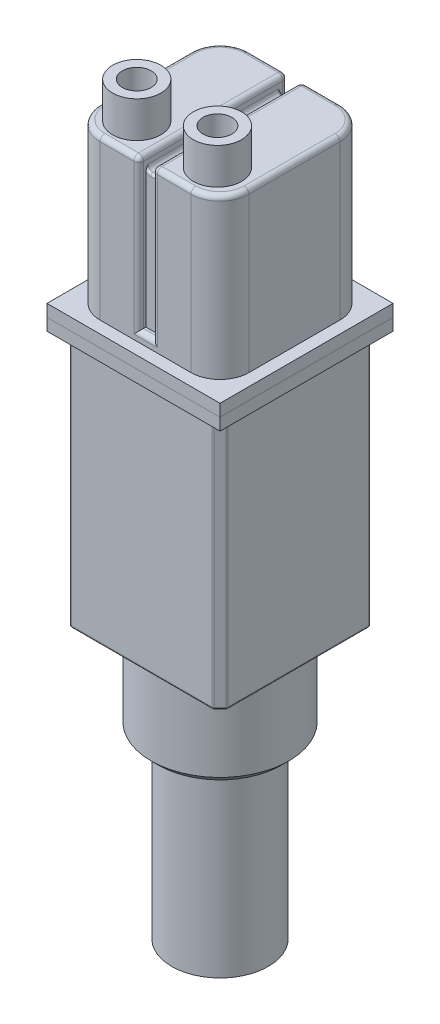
ISO-10303-21;
HEADER;
FILE_DESCRIPTION(('STEP AP214'),'2;1');
FILE_NAME('part.step','',(''),(''),'','','');
FILE_SCHEMA(('AUTOMOTIVE_DESIGN { 1 0 10303 214 1 1 1 1 }'));
ENDSEC;
DATA;
#1=APPLICATION_CONTEXT('core data for automotive mechanical design processes');
#2=APPLICATION_PROTOCOL_DEFINITION('international standard','automotive_design',2000,#1);
#3=PRODUCT_CONTEXT('',#1,'mechanical');
#4=PRODUCT('Part','Part','',(#3));
#5=PRODUCT_RELATED_PRODUCT_CATEGORY('part','',(#4));
#6=PRODUCT_DEFINITION_FORMATION('','',#4);
#7=PRODUCT_DEFINITION_CONTEXT('part definition',#1,'design');
#8=PRODUCT_DEFINITION('design','',#6,#7);
#9=PRODUCT_DEFINITION_SHAPE('','',#8);
#10=(LENGTH_UNIT() NAMED_UNIT(*) SI_UNIT(.MILLI.,.METRE.));
#11=(NAMED_UNIT(*) PLANE_ANGLE_UNIT() SI_UNIT($,.RADIAN.));
#12=(NAMED_UNIT(*) SI_UNIT($,.STERADIAN.) SOLID_ANGLE_UNIT());
#13=UNCERTAINTY_MEASURE_WITH_UNIT(LENGTH_MEASURE(1.E-05),#10,'distance_accuracy_value','');
#14=(GEOMETRIC_REPRESENTATION_CONTEXT(3) GLOBAL_UNCERTAINTY_ASSIGNED_CONTEXT((#13)) GLOBAL_UNIT_ASSIGNED_CONTEXT((#10,
#11,#12)) REPRESENTATION_CONTEXT('',''));
#15=CARTESIAN_POINT('',(0.,0.,0.));
#16=DIRECTION('',(0.,0.,1.));
#17=DIRECTION('',(1.,0.,0.));
#18=AXIS2_PLACEMENT_3D('',#15,#16,#17);
#19=CARTESIAN_POINT('',(0.,294.,0.));
#20=DIRECTION('',(0.,1.,0.));
#21=DIRECTION('',(0.,0.,1.));
#22=AXIS2_PLACEMENT_3D('',#19,#20,#21);
#23=PLANE('',#22);
#24=CARTESIAN_POINT('',(16.7137488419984,294.,17.7783188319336));
#25=DIRECTION('',(0.,1.,0.));
#26=DIRECTION('',(0.,0.,1.));
#27=AXIS2_PLACEMENT_3D('',#24,#25,#26);
#28=CIRCLE('',#27,10.);
#29=CARTESIAN_POINT('',(16.7137488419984,294.,27.7783188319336));
#30=VERTEX_POINT('',#29);
#31=EDGE_CURVE('E540',#30,#30,#28,.T.);
#32=ORIENTED_EDGE('',*,*,#31,.F.);
#33=EDGE_LOOP('',(#32));
#34=FACE_BOUND('',#33,.T.);
#35=CARTESIAN_POINT('',(18.8579876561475,294.,18.8579876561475));
#36=DIRECTION('',(0.,1.,0.));
#37=DIRECTION('',(0.,0.,1.));
#38=AXIS2_PLACEMENT_3D('',#35,#36,#37);
#39=CIRCLE('',#38,10.);
#40=CARTESIAN_POINT('',(28.8579876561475,294.,18.8579876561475));
#41=VERTEX_POINT('',#40);
#42=CARTESIAN_POINT('',(18.8579876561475,294.,28.8579876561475));
#43=VERTEX_POINT('',#42);
#44=EDGE_CURVE('E486',#41,#43,#39,.F.);
#45=ORIENTED_EDGE('',*,*,#44,.F.);
#46=DIRECTION('',(0.,0.,1.));
#47=VECTOR('',#46,1.);
#48=CARTESIAN_POINT('',(28.8579876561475,294.,0.));
#49=LINE('',#48,#47);
#50=CARTESIAN_POINT('',(28.8579876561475,294.,-18.8579876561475));
#51=VERTEX_POINT('',#50);
#52=EDGE_CURVE('E445',#41,#51,#49,.F.);
#53=ORIENTED_EDGE('',*,*,#52,.T.);
#54=CARTESIAN_POINT('',(18.8579876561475,294.,-18.8579876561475));
#55=DIRECTION('',(0.,1.,0.));
#56=DIRECTION('',(0.,0.,1.));
#57=AXIS2_PLACEMENT_3D('',#54,#55,#56);
#58=CIRCLE('',#57,10.);
#59=CARTESIAN_POINT('',(18.8579876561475,294.,-28.8579876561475));
#60=VERTEX_POINT('',#59);
#61=EDGE_CURVE('E483',#60,#51,#58,.F.);
#62=ORIENTED_EDGE('',*,*,#61,.F.);
#63=DIRECTION('',(1.,0.,0.));
#64=VECTOR('',#63,1.);
#65=CARTESIAN_POINT('',(0.,294.,-28.8579876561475));
#66=LINE('',#65,#64);
#67=CARTESIAN_POINT('',(4.85798765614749,294.,-28.8579876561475));
#68=VERTEX_POINT('',#67);
#69=EDGE_CURVE('E443',#60,#68,#66,.F.);
#70=ORIENTED_EDGE('',*,*,#69,.T.);
#71=DIRECTION('',(0.,0.,-1.));
#72=VECTOR('',#71,1.);
#73=CARTESIAN_POINT('',(4.85798765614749,294.,30.8579876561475));
#74=LINE('',#73,#72);
#75=CARTESIAN_POINT('',(4.85798765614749,294.,28.8579876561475));
#76=VERTEX_POINT('',#75);
#77=EDGE_CURVE('E385',#68,#76,#74,.F.);
#78=ORIENTED_EDGE('',*,*,#77,.T.);
#79=DIRECTION('',(1.,0.,0.));
#80=VECTOR('',#79,1.);
#81=CARTESIAN_POINT('',(30.8579876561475,294.,28.8579876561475));
#82=LINE('',#81,#80);
#83=EDGE_CURVE('E448',#76,#43,#82,.T.);
#84=ORIENTED_EDGE('',*,*,#83,.T.);
#85=EDGE_LOOP('',(#45,#53,#62,#70,#78,#84));
#86=FACE_BOUND('',#85,.T.);
#87=ADVANCED_FACE('F49',(#34,#86),#23,.T.);
#88=CARTESIAN_POINT('',(-16.7137488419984,294.,17.7783188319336));
#89=DIRECTION('',(0.,1.,0.));
#90=DIRECTION('',(0.,0.,1.));
#91=AXIS2_PLACEMENT_3D('',#88,#89,#90);
#92=CIRCLE('',#91,10.);
#93=CARTESIAN_POINT('',(-16.7137488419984,294.,27.7783188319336));
#94=VERTEX_POINT('',#93);
#95=EDGE_CURVE('E1350',#94,#94,#92,.T.);
#96=ORIENTED_EDGE('',*,*,#95,.F.);
#97=EDGE_LOOP('',(#96));
#98=FACE_BOUND('',#97,.T.);
#99=CARTESIAN_POINT('',(-18.8579876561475,294.,18.8579876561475));
#100=DIRECTION('',(0.,1.,0.));
#101=DIRECTION('',(0.,0.,1.));
#102=AXIS2_PLACEMENT_3D('',#99,#100,#101);
#103=CIRCLE('',#102,10.);
#104=CARTESIAN_POINT('',(-18.8579876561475,294.,28.8579876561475));
#105=VERTEX_POINT('',#104);
#106=CARTESIAN_POINT('',(-28.8579876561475,294.,18.8579876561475));
#107=VERTEX_POINT('',#106);
#108=EDGE_CURVE('E476',#105,#107,#103,.F.);
#109=ORIENTED_EDGE('',*,*,#108,.F.);
#110=DIRECTION('',(1.,0.,0.));
#111=VECTOR('',#110,1.);
#112=CARTESIAN_POINT('',(-4.85798765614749,294.,28.8579876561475));
#113=LINE('',#112,#111);
#114=CARTESIAN_POINT('',(-4.85798765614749,294.,28.8579876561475));
#115=VERTEX_POINT('',#114);
#116=EDGE_CURVE('E429',#105,#115,#113,.T.);
#117=ORIENTED_EDGE('',*,*,#116,.T.);
#118=DIRECTION('',(0.,0.,1.));
#119=VECTOR('',#118,1.);
#120=CARTESIAN_POINT('',(-4.8579876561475,294.,-30.8579876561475));
#121=LINE('',#120,#119);
#122=CARTESIAN_POINT('',(-4.8579876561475,294.,-28.8579876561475));
#123=VERTEX_POINT('',#122);
#124=EDGE_CURVE('E376',#115,#123,#121,.F.);
#125=ORIENTED_EDGE('',*,*,#124,.T.);
#126=DIRECTION('',(1.,0.,0.));
#127=VECTOR('',#126,1.);
#128=CARTESIAN_POINT('',(0.,294.,-28.8579876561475));
#129=LINE('',#128,#127);
#130=CARTESIAN_POINT('',(-18.8579876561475,294.,-28.8579876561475));
#131=VERTEX_POINT('',#130);
#132=EDGE_CURVE('E434',#123,#131,#129,.F.);
#133=ORIENTED_EDGE('',*,*,#132,.T.);
#134=CARTESIAN_POINT('',(-18.8579876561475,294.,-18.8579876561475));
#135=DIRECTION('',(0.,1.,0.));
#136=DIRECTION('',(0.,0.,1.));
#137=AXIS2_PLACEMENT_3D('',#134,#135,#136);
#138=CIRCLE('',#137,10.);
#139=CARTESIAN_POINT('',(-28.8579876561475,294.,-18.8579876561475));
#140=VERTEX_POINT('',#139);
#141=EDGE_CURVE('E451',#140,#131,#138,.F.);
#142=ORIENTED_EDGE('',*,*,#141,.F.);
#143=DIRECTION('',(0.,0.,1.));
#144=VECTOR('',#143,1.);
#145=CARTESIAN_POINT('',(-28.8579876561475,294.,30.8579876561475));
#146=LINE('',#145,#144);
#147=EDGE_CURVE('E431',#140,#107,#146,.T.);
#148=ORIENTED_EDGE('',*,*,#147,.T.);
#149=EDGE_LOOP('',(#109,#117,#125,#133,#142,#148));
#150=FACE_BOUND('',#149,.T.);
#151=ADVANCED_FACE('F629',(#98,#150),#23,.T.);
#152=CARTESIAN_POINT('',(0.,228.,0.));
#153=DIRECTION('',(0.,-1.,0.));
#154=DIRECTION('',(0.,0.,-1.));
#155=AXIS2_PLACEMENT_3D('',#152,#153,#154);
#156=PLANE('',#155);
#157=DIRECTION('',(0.,0.,-1.));
#158=VECTOR('',#157,1.);
#159=CARTESIAN_POINT('',(35.8579876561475,228.,35.8579876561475));
#160=LINE('',#159,#158);
#161=CARTESIAN_POINT('',(35.8579876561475,228.,35.8579876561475));
#162=VERTEX_POINT('',#161);
#163=CARTESIAN_POINT('',(35.8579876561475,228.,-35.8579876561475));
#164=VERTEX_POINT('',#163);
#165=EDGE_CURVE('E342',#162,#164,#160,.T.);
#166=ORIENTED_EDGE('',*,*,#165,.T.);
#167=DIRECTION('',(-1.,0.,0.));
#168=VECTOR('',#167,1.);
#169=CARTESIAN_POINT('',(-35.8579876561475,228.,-35.8579876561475));
#170=LINE('',#169,#168);
#171=CARTESIAN_POINT('',(-35.8579876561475,228.,-35.8579876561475));
#172=VERTEX_POINT('',#171);
#173=EDGE_CURVE('E345',#164,#172,#170,.T.);
#174=ORIENTED_EDGE('',*,*,#173,.T.);
#175=DIRECTION('',(0.,0.,1.));
#176=VECTOR('',#175,1.);
#177=CARTESIAN_POINT('',(-35.8579876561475,228.,35.8579876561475));
#178=LINE('',#177,#176);
#179=CARTESIAN_POINT('',(-35.8579876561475,228.,35.8579876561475));
#180=VERTEX_POINT('',#179);
#181=EDGE_CURVE('E348',#172,#180,#178,.T.);
#182=ORIENTED_EDGE('',*,*,#181,.T.);
#183=DIRECTION('',(1.,0.,0.));
#184=VECTOR('',#183,1.);
#185=CARTESIAN_POINT('',(-35.8579876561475,228.,35.8579876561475));
#186=LINE('',#185,#184);
#187=EDGE_CURVE('E350',#180,#162,#186,.T.);
#188=ORIENTED_EDGE('',*,*,#187,.T.);
#189=EDGE_LOOP('',(#166,#174,#182,#188));
#190=FACE_BOUND('',#189,.T.);
#191=DIRECTION('',(1.,0.,0.));
#192=VECTOR('',#191,1.);
#193=CARTESIAN_POINT('',(0.,228.,30.8579876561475));
#194=LINE('',#193,#192);
#195=CARTESIAN_POINT('',(-18.8579876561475,228.,30.8579876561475));
#196=VERTEX_POINT('',#195);
#197=CARTESIAN_POINT('',(18.8579876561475,228.,30.8579876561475));
#198=VERTEX_POINT('',#197);
#199=EDGE_CURVE('E314',#196,#198,#194,.T.);
#200=ORIENTED_EDGE('',*,*,#199,.F.);
#201=CARTESIAN_POINT('',(-18.8579876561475,228.,18.8579876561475));
#202=DIRECTION('',(0.,-1.,0.));
#203=DIRECTION('',(0.,0.,-1.));
#204=AXIS2_PLACEMENT_3D('',#201,#202,#203);
#205=CIRCLE('',#204,12.);
#206=CARTESIAN_POINT('',(-30.8579876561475,228.,18.8579876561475));
#207=VERTEX_POINT('',#206);
#208=EDGE_CURVE('E523',#196,#207,#205,.T.);
#209=ORIENTED_EDGE('',*,*,#208,.T.);
#210=DIRECTION('',(0.,0.,1.));
#211=VECTOR('',#210,1.);
#212=CARTESIAN_POINT('',(-30.8579876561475,228.,0.));
#213=LINE('',#212,#211);
#214=CARTESIAN_POINT('',(-30.8579876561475,228.,-18.8579876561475));
#215=VERTEX_POINT('',#214);
#216=EDGE_CURVE('E338',#215,#207,#213,.T.);
#217=ORIENTED_EDGE('',*,*,#216,.F.);
#218=CARTESIAN_POINT('',(-18.8579876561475,228.,-18.8579876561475));
#219=DIRECTION('',(0.,-1.,0.));
#220=DIRECTION('',(0.,0.,-1.));
#221=AXIS2_PLACEMENT_3D('',#218,#219,#220);
#222=CIRCLE('',#221,12.);
#223=CARTESIAN_POINT('',(-18.8579876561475,228.,-30.8579876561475));
#224=VERTEX_POINT('',#223);
#225=EDGE_CURVE('E519',#215,#224,#222,.T.);
#226=ORIENTED_EDGE('',*,*,#225,.T.);
#227=DIRECTION('',(1.,0.,0.));
#228=VECTOR('',#227,1.);
#229=CARTESIAN_POINT('',(0.,228.,-30.8579876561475));
#230=LINE('',#229,#228);
#231=CARTESIAN_POINT('',(18.8579876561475,228.,-30.8579876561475));
#232=VERTEX_POINT('',#231);
#233=EDGE_CURVE('E335',#224,#232,#230,.T.);
#234=ORIENTED_EDGE('',*,*,#233,.T.);
#235=CARTESIAN_POINT('',(18.8579876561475,228.,-18.8579876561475));
#236=DIRECTION('',(0.,-1.,0.));
#237=DIRECTION('',(0.,0.,-1.));
#238=AXIS2_PLACEMENT_3D('',#235,#236,#237);
#239=CIRCLE('',#238,12.);
#240=CARTESIAN_POINT('',(30.8579876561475,228.,-18.8579876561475));
#241=VERTEX_POINT('',#240);
#242=EDGE_CURVE('E517',#232,#241,#239,.T.);
#243=ORIENTED_EDGE('',*,*,#242,.T.);
#244=DIRECTION('',(0.,0.,1.));
#245=VECTOR('',#244,1.);
#246=CARTESIAN_POINT('',(30.8579876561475,228.,0.));
#247=LINE('',#246,#245);
#248=CARTESIAN_POINT('',(30.8579876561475,228.,18.8579876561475));
#249=VERTEX_POINT('',#248);
#250=EDGE_CURVE('E332',#241,#249,#247,.T.);
#251=ORIENTED_EDGE('',*,*,#250,.T.);
#252=CARTESIAN_POINT('',(18.8579876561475,228.,18.8579876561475));
#253=DIRECTION('',(0.,-1.,0.));
#254=DIRECTION('',(0.,0.,-1.));
#255=AXIS2_PLACEMENT_3D('',#252,#253,#254);
#256=CIRCLE('',#255,12.);
#257=EDGE_CURVE('E521',#249,#198,#256,.T.);
#258=ORIENTED_EDGE('',*,*,#257,.T.);
#259=EDGE_LOOP('',(#200,#209,#217,#226,#234,#243,#251,#258));
#260=FACE_BOUND('',#259,.T.);
#261=ADVANCED_FACE('F635',(#190,#260),#156,.F.);
#262=CARTESIAN_POINT('',(35.8579876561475,228.,35.8579876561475));
#263=DIRECTION('',(-1.,0.,0.));
#264=DIRECTION('',(0.,0.,1.));
#265=AXIS2_PLACEMENT_3D('',#262,#263,#264);
#266=PLANE('',#265);
#267=DIRECTION('',(0.,0.,-1.));
#268=VECTOR('',#267,1.);
#269=CARTESIAN_POINT('',(35.8579876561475,223.,35.8579876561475));
#270=LINE('',#269,#268);
#271=CARTESIAN_POINT('',(35.8579876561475,223.,35.8579876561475));
#272=VERTEX_POINT('',#271);
#273=CARTESIAN_POINT('',(35.8579876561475,223.,-35.8579876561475));
#274=VERTEX_POINT('',#273);
#275=EDGE_CURVE('E341',#272,#274,#270,.T.);
#276=ORIENTED_EDGE('',*,*,#275,.T.);
#277=DIRECTION('',(0.,-1.,0.));
#278=VECTOR('',#277,1.);
#279=CARTESIAN_POINT('',(35.8579876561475,228.,-35.8579876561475));
#280=LINE('',#279,#278);
#281=EDGE_CURVE('E368',#164,#274,#280,.T.);
#282=ORIENTED_EDGE('',*,*,#281,.F.);
#283=ORIENTED_EDGE('',*,*,#165,.F.);
#284=DIRECTION('',(0.,-1.,0.));
#285=VECTOR('',#284,1.);
#286=CARTESIAN_POINT('',(35.8579876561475,228.,35.8579876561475));
#287=LINE('',#286,#285);
#288=EDGE_CURVE('E352',#162,#272,#287,.T.);
#289=ORIENTED_EDGE('',*,*,#288,.T.);
#290=EDGE_LOOP('',(#276,#282,#283,#289));
#291=FACE_BOUND('',#290,.T.);
#292=ADVANCED_FACE('F842',(#291),#266,.F.);
#293=CARTESIAN_POINT('',(-35.8579876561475,228.,-35.8579876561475));
#294=DIRECTION('',(0.,0.,1.));
#295=DIRECTION('',(1.,0.,0.));
#296=AXIS2_PLACEMENT_3D('',#293,#294,#295);
#297=PLANE('',#296);
#298=DIRECTION('',(-1.,0.,0.));
#299=VECTOR('',#298,1.);
#300=CARTESIAN_POINT('',(-35.8579876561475,223.,-35.8579876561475));
#301=LINE('',#300,#299);
#302=CARTESIAN_POINT('',(-35.8579876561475,223.,-35.8579876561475));
#303=VERTEX_POINT('',#302);
#304=EDGE_CURVE('E355',#274,#303,#301,.T.);
#305=ORIENTED_EDGE('',*,*,#304,.T.);
#306=DIRECTION('',(0.,-1.,0.));
#307=VECTOR('',#306,1.);
#308=CARTESIAN_POINT('',(-35.8579876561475,228.,-35.8579876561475));
#309=LINE('',#308,#307);
#310=EDGE_CURVE('E365',#172,#303,#309,.T.);
#311=ORIENTED_EDGE('',*,*,#310,.F.);
#312=ORIENTED_EDGE('',*,*,#173,.F.);
#313=ORIENTED_EDGE('',*,*,#281,.T.);
#314=EDGE_LOOP('',(#305,#311,#312,#313));
#315=FACE_BOUND('',#314,.T.);
#316=ADVANCED_FACE('F854',(#315),#297,.F.);
#317=CARTESIAN_POINT('',(-35.8579876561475,228.,35.8579876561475));
#318=DIRECTION('',(1.,0.,0.));
#319=DIRECTION('',(0.,0.,-1.));
#320=AXIS2_PLACEMENT_3D('',#317,#318,#319);
#321=PLANE('',#320);
#322=DIRECTION('',(0.,0.,1.));
#323=VECTOR('',#322,1.);
#324=CARTESIAN_POINT('',(-35.8579876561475,223.,35.8579876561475));
#325=LINE('',#324,#323);
#326=CARTESIAN_POINT('',(-35.8579876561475,223.,35.8579876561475));
#327=VERTEX_POINT('',#326);
#328=EDGE_CURVE('E357',#303,#327,#325,.T.);
#329=ORIENTED_EDGE('',*,*,#328,.T.);
#330=DIRECTION('',(0.,-1.,0.));
#331=VECTOR('',#330,1.);
#332=CARTESIAN_POINT('',(-35.8579876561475,228.,35.8579876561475));
#333=LINE('',#332,#331);
#334=EDGE_CURVE('E362',#180,#327,#333,.T.);
#335=ORIENTED_EDGE('',*,*,#334,.F.);
#336=ORIENTED_EDGE('',*,*,#181,.F.);
#337=ORIENTED_EDGE('',*,*,#310,.T.);
#338=EDGE_LOOP('',(#329,#335,#336,#337));
#339=FACE_BOUND('',#338,.T.);
#340=ADVANCED_FACE('F850',(#339),#321,.F.);
#341=CARTESIAN_POINT('',(-35.8579876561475,228.,35.8579876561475));
#342=DIRECTION('',(0.,0.,-1.));
#343=DIRECTION('',(-1.,0.,0.));
#344=AXIS2_PLACEMENT_3D('',#341,#342,#343);
#345=PLANE('',#344);
#346=DIRECTION('',(1.,0.,0.));
#347=VECTOR('',#346,1.);
#348=CARTESIAN_POINT('',(-35.8579876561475,223.,35.8579876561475));
#349=LINE('',#348,#347);
#350=EDGE_CURVE('E346',#327,#272,#349,.T.);
#351=ORIENTED_EDGE('',*,*,#350,.T.);
#352=ORIENTED_EDGE('',*,*,#288,.F.);
#353=ORIENTED_EDGE('',*,*,#187,.F.);
#354=ORIENTED_EDGE('',*,*,#334,.T.);
#355=EDGE_LOOP('',(#351,#352,#353,#354));
#356=FACE_BOUND('',#355,.T.);
#357=ADVANCED_FACE('F846',(#356),#345,.F.);
#358=CARTESIAN_POINT('',(0.,223.,0.));
#359=DIRECTION('',(0.,-1.,0.));
#360=DIRECTION('',(0.,0.,-1.));
#361=AXIS2_PLACEMENT_3D('',#358,#359,#360);
#362=PLANE('',#361);
#363=ORIENTED_EDGE('',*,*,#275,.F.);
#364=ORIENTED_EDGE('',*,*,#350,.F.);
#365=ORIENTED_EDGE('',*,*,#328,.F.);
#366=ORIENTED_EDGE('',*,*,#304,.F.);
#367=EDGE_LOOP('',(#363,#364,#365,#366));
#368=FACE_BOUND('',#367,.T.);
#369=ADVANCED_FACE('F837',(#368),#362,.T.);
#370=CARTESIAN_POINT('',(0.,294.,30.8579876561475));
#371=DIRECTION('',(0.,0.,-1.));
#372=DIRECTION('',(-1.,0.,0.));
#373=AXIS2_PLACEMENT_3D('',#370,#371,#372);
#374=PLANE('',#373);
#375=DIRECTION('',(0.,1.,0.));
#376=VECTOR('',#375,1.);
#377=CARTESIAN_POINT('',(4.85798765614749,294.,30.8579876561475));
#378=LINE('',#377,#376);
#379=CARTESIAN_POINT('',(4.85798765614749,292.,30.8579876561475));
#380=VERTEX_POINT('',#379);
#381=CARTESIAN_POINT('',(4.85798765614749,230.,30.8579876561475));
#382=VERTEX_POINT('',#381);
#383=EDGE_CURVE('E64',#380,#382,#378,.F.);
#384=ORIENTED_EDGE('',*,*,#383,.T.);
#385=DIRECTION('',(1.,0.,0.));
#386=VECTOR('',#385,1.);
#387=CARTESIAN_POINT('',(0.,230.,30.8579876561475));
#388=LINE('',#387,#386);
#389=CARTESIAN_POINT('',(-4.85798765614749,230.,30.8579876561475));
#390=VERTEX_POINT('',#389);
#391=EDGE_CURVE('E733',#382,#390,#388,.F.);
#392=ORIENTED_EDGE('',*,*,#391,.T.);
#393=DIRECTION('',(0.,1.,0.));
#394=VECTOR('',#393,1.);
#395=CARTESIAN_POINT('',(-4.85798765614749,294.,30.8579876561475));
#396=LINE('',#395,#394);
#397=CARTESIAN_POINT('',(-4.85798765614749,292.,30.8579876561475));
#398=VERTEX_POINT('',#397);
#399=EDGE_CURVE('E71',#390,#398,#396,.T.);
#400=ORIENTED_EDGE('',*,*,#399,.T.);
#401=DIRECTION('',(1.,0.,0.));
#402=VECTOR('',#401,1.);
#403=CARTESIAN_POINT('',(-30.8579876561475,292.,30.8579876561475));
#404=LINE('',#403,#402);
#405=CARTESIAN_POINT('',(-18.8579876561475,292.,30.8579876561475));
#406=VERTEX_POINT('',#405);
#407=EDGE_CURVE('E415',#398,#406,#404,.F.);
#408=ORIENTED_EDGE('',*,*,#407,.T.);
#409=DIRECTION('',(0.,-1.,0.));
#410=VECTOR('',#409,1.);
#411=CARTESIAN_POINT('',(-18.8579876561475,294.,30.8579876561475));
#412=LINE('',#411,#410);
#413=EDGE_CURVE('E513',#406,#196,#412,.T.);
#414=ORIENTED_EDGE('',*,*,#413,.T.);
#415=ORIENTED_EDGE('',*,*,#199,.T.);
#416=DIRECTION('',(0.,-1.,0.));
#417=VECTOR('',#416,1.);
#418=CARTESIAN_POINT('',(18.8579876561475,292.,30.8579876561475));
#419=LINE('',#418,#417);
#420=CARTESIAN_POINT('',(18.8579876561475,292.,30.8579876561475));
#421=VERTEX_POINT('',#420);
#422=EDGE_CURVE('E515',#198,#421,#419,.F.);
#423=ORIENTED_EDGE('',*,*,#422,.T.);
#424=DIRECTION('',(1.,0.,0.));
#425=VECTOR('',#424,1.);
#426=CARTESIAN_POINT('',(4.85798765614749,292.,30.8579876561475));
#427=LINE('',#426,#425);
#428=EDGE_CURVE('E412',#421,#380,#427,.F.);
#429=ORIENTED_EDGE('',*,*,#428,.T.);
#430=EDGE_LOOP('',(#384,#392,#400,#408,#414,#415,#423,#429));
#431=FACE_BOUND('',#430,.T.);
#432=ADVANCED_FACE('F746',(#431),#374,.F.);
#433=CARTESIAN_POINT('',(30.8579876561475,294.,0.));
#434=DIRECTION('',(1.,0.,0.));
#435=DIRECTION('',(0.,0.,-1.));
#436=AXIS2_PLACEMENT_3D('',#433,#434,#435);
#437=PLANE('',#436);
#438=ORIENTED_EDGE('',*,*,#250,.F.);
#439=DIRECTION('',(0.,-1.,0.));
#440=VECTOR('',#439,1.);
#441=CARTESIAN_POINT('',(30.8579876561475,294.,-18.8579876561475));
#442=LINE('',#441,#440);
#443=CARTESIAN_POINT('',(30.8579876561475,292.,-18.8579876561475));
#444=VERTEX_POINT('',#443);
#445=EDGE_CURVE('E507',#241,#444,#442,.F.);
#446=ORIENTED_EDGE('',*,*,#445,.T.);
#447=DIRECTION('',(0.,0.,1.));
#448=VECTOR('',#447,1.);
#449=CARTESIAN_POINT('',(30.8579876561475,292.,0.));
#450=LINE('',#449,#448);
#451=CARTESIAN_POINT('',(30.8579876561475,292.,18.8579876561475));
#452=VERTEX_POINT('',#451);
#453=EDGE_CURVE('E440',#444,#452,#450,.T.);
#454=ORIENTED_EDGE('',*,*,#453,.T.);
#455=DIRECTION('',(0.,-1.,0.));
#456=VECTOR('',#455,1.);
#457=CARTESIAN_POINT('',(30.8579876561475,228.,18.8579876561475));
#458=LINE('',#457,#456);
#459=EDGE_CURVE('E505',#452,#249,#458,.T.);
#460=ORIENTED_EDGE('',*,*,#459,.T.);
#461=EDGE_LOOP('',(#438,#446,#454,#460));
#462=FACE_BOUND('',#461,.T.);
#463=ADVANCED_FACE('F829',(#462),#437,.T.);
#464=CARTESIAN_POINT('',(0.,294.,-30.8579876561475));
#465=DIRECTION('',(0.,0.,-1.));
#466=DIRECTION('',(-1.,0.,0.));
#467=AXIS2_PLACEMENT_3D('',#464,#465,#466);
#468=PLANE('',#467);
#469=DIRECTION('',(0.,1.,0.));
#470=VECTOR('',#469,1.);
#471=CARTESIAN_POINT('',(-4.8579876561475,232.,-30.8579876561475));
#472=LINE('',#471,#470);
#473=CARTESIAN_POINT('',(-4.8579876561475,292.,-30.8579876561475));
#474=VERTEX_POINT('',#473);
#475=CARTESIAN_POINT('',(-4.8579876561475,230.,-30.8579876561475));
#476=VERTEX_POINT('',#475);
#477=EDGE_CURVE('E406',#474,#476,#472,.F.);
#478=ORIENTED_EDGE('',*,*,#477,.T.);
#479=DIRECTION('',(-1.,0.,0.));
#480=VECTOR('',#479,1.);
#481=CARTESIAN_POINT('',(0.,230.,-30.8579876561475));
#482=LINE('',#481,#480);
#483=CARTESIAN_POINT('',(4.85798765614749,230.,-30.8579876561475));
#484=VERTEX_POINT('',#483);
#485=EDGE_CURVE('E727',#476,#484,#482,.F.);
#486=ORIENTED_EDGE('',*,*,#485,.T.);
#487=DIRECTION('',(0.,1.,0.));
#488=VECTOR('',#487,1.);
#489=CARTESIAN_POINT('',(4.85798765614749,292.,-30.8579876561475));
#490=LINE('',#489,#488);
#491=CARTESIAN_POINT('',(4.85798765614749,292.,-30.8579876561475));
#492=VERTEX_POINT('',#491);
#493=EDGE_CURVE('E402',#484,#492,#490,.T.);
#494=ORIENTED_EDGE('',*,*,#493,.T.);
#495=DIRECTION('',(1.,0.,0.));
#496=VECTOR('',#495,1.);
#497=CARTESIAN_POINT('',(0.,292.,-30.8579876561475));
#498=LINE('',#497,#496);
#499=CARTESIAN_POINT('',(18.8579876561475,292.,-30.8579876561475));
#500=VERTEX_POINT('',#499);
#501=EDGE_CURVE('E399',#492,#500,#498,.T.);
#502=ORIENTED_EDGE('',*,*,#501,.T.);
#503=DIRECTION('',(0.,-1.,0.));
#504=VECTOR('',#503,1.);
#505=CARTESIAN_POINT('',(18.8579876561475,294.,-30.8579876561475));
#506=LINE('',#505,#504);
#507=EDGE_CURVE('E503',#500,#232,#506,.T.);
#508=ORIENTED_EDGE('',*,*,#507,.T.);
#509=ORIENTED_EDGE('',*,*,#233,.F.);
#510=DIRECTION('',(0.,-1.,0.));
#511=VECTOR('',#510,1.);
#512=CARTESIAN_POINT('',(-18.8579876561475,292.,-30.8579876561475));
#513=LINE('',#512,#511);
#514=CARTESIAN_POINT('',(-18.8579876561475,292.,-30.8579876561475));
#515=VERTEX_POINT('',#514);
#516=EDGE_CURVE('E501',#224,#515,#513,.F.);
#517=ORIENTED_EDGE('',*,*,#516,.T.);
#518=DIRECTION('',(1.,0.,0.));
#519=VECTOR('',#518,1.);
#520=CARTESIAN_POINT('',(0.,292.,-30.8579876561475));
#521=LINE('',#520,#519);
#522=EDGE_CURVE('E404',#515,#474,#521,.T.);
#523=ORIENTED_EDGE('',*,*,#522,.T.);
#524=EDGE_LOOP('',(#478,#486,#494,#502,#508,#509,#517,#523));
#525=FACE_BOUND('',#524,.T.);
#526=ADVANCED_FACE('F813',(#525),#468,.T.);
#527=CARTESIAN_POINT('',(-30.8579876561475,294.,0.));
#528=DIRECTION('',(1.,0.,0.));
#529=DIRECTION('',(0.,0.,-1.));
#530=AXIS2_PLACEMENT_3D('',#527,#528,#529);
#531=PLANE('',#530);
#532=DIRECTION('',(0.,0.,1.));
#533=VECTOR('',#532,1.);
#534=CARTESIAN_POINT('',(-30.8579876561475,292.,-30.8579876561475));
#535=LINE('',#534,#533);
#536=CARTESIAN_POINT('',(-30.8579876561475,292.,18.8579876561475));
#537=VERTEX_POINT('',#536);
#538=CARTESIAN_POINT('',(-30.8579876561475,292.,-18.8579876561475));
#539=VERTEX_POINT('',#538);
#540=EDGE_CURVE('E437',#537,#539,#535,.F.);
#541=ORIENTED_EDGE('',*,*,#540,.T.);
#542=DIRECTION('',(0.,-1.,0.));
#543=VECTOR('',#542,1.);
#544=CARTESIAN_POINT('',(-30.8579876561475,228.,-18.8579876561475));
#545=LINE('',#544,#543);
#546=EDGE_CURVE('E511',#539,#215,#545,.T.);
#547=ORIENTED_EDGE('',*,*,#546,.T.);
#548=ORIENTED_EDGE('',*,*,#216,.T.);
#549=DIRECTION('',(0.,-1.,0.));
#550=VECTOR('',#549,1.);
#551=CARTESIAN_POINT('',(-30.8579876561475,294.,18.8579876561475));
#552=LINE('',#551,#550);
#553=EDGE_CURVE('E509',#207,#537,#552,.F.);
#554=ORIENTED_EDGE('',*,*,#553,.T.);
#555=EDGE_LOOP('',(#541,#547,#548,#554));
#556=FACE_BOUND('',#555,.T.);
#557=ADVANCED_FACE('F592',(#556),#531,.F.);
#558=CARTESIAN_POINT('',(-2.8579876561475,288.,-30.8579876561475));
#559=DIRECTION('',(-1.,0.,0.));
#560=DIRECTION('',(0.,0.,1.));
#561=AXIS2_PLACEMENT_3D('',#558,#559,#560);
#562=PLANE('',#561);
#563=DIRECTION('',(0.,0.,1.));
#564=VECTOR('',#563,1.);
#565=CARTESIAN_POINT('',(-2.8579876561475,232.,-30.8579876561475));
#566=LINE('',#565,#564);
#567=CARTESIAN_POINT('',(-2.8579876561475,232.,-28.8579876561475));
#568=VERTEX_POINT('',#567);
#569=CARTESIAN_POINT('',(-2.8579876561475,232.,-27.8579876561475));
#570=VERTEX_POINT('',#569);
#571=EDGE_CURVE('E282',#568,#570,#566,.T.);
#572=ORIENTED_EDGE('',*,*,#571,.F.);
#573=DIRECTION('',(0.,1.,0.));
#574=VECTOR('',#573,1.);
#575=CARTESIAN_POINT('',(-2.8579876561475,292.,-28.8579876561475));
#576=LINE('',#575,#574);
#577=CARTESIAN_POINT('',(-2.8579876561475,292.,-28.8579876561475));
#578=VERTEX_POINT('',#577);
#579=EDGE_CURVE('E397',#568,#578,#576,.T.);
#580=ORIENTED_EDGE('',*,*,#579,.T.);
#581=DIRECTION('',(0.,0.,1.));
#582=VECTOR('',#581,1.);
#583=CARTESIAN_POINT('',(-2.85798765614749,292.,30.8579876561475));
#584=LINE('',#583,#582);
#585=CARTESIAN_POINT('',(-2.85798765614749,292.,28.8579876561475));
#586=VERTEX_POINT('',#585);
#587=EDGE_CURVE('E373',#578,#586,#584,.T.);
#588=ORIENTED_EDGE('',*,*,#587,.T.);
#589=DIRECTION('',(0.,1.,0.));
#590=VECTOR('',#589,1.);
#591=CARTESIAN_POINT('',(-2.85798765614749,288.,28.8579876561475));
#592=LINE('',#591,#590);
#593=CARTESIAN_POINT('',(-2.85798765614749,232.,28.8579876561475));
#594=VERTEX_POINT('',#593);
#595=EDGE_CURVE('E394',#586,#594,#592,.F.);
#596=ORIENTED_EDGE('',*,*,#595,.T.);
#597=DIRECTION('',(0.,0.,1.));
#598=VECTOR('',#597,1.);
#599=CARTESIAN_POINT('',(-2.85798765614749,232.,30.8579876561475));
#600=LINE('',#599,#598);
#601=CARTESIAN_POINT('',(-2.85798765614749,232.,27.8579876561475));
#602=VERTEX_POINT('',#601);
#603=EDGE_CURVE('E316',#602,#594,#600,.T.);
#604=ORIENTED_EDGE('',*,*,#603,.F.);
#605=DIRECTION('',(0.,1.,0.));
#606=VECTOR('',#605,1.);
#607=CARTESIAN_POINT('',(-2.85798765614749,232.,27.8579876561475));
#608=LINE('',#607,#606);
#609=CARTESIAN_POINT('',(-2.85798765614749,287.7639320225,27.8579876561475));
#610=VERTEX_POINT('',#609);
#611=EDGE_CURVE('E293',#602,#610,#608,.T.);
#612=ORIENTED_EDGE('',*,*,#611,.T.);
#613=CARTESIAN_POINT('',(-2.85798765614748,287.7639320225,27.8579876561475));
#614=CARTESIAN_POINT('',(-2.85798765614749,287.823328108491,27.8579824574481));
#615=CARTESIAN_POINT('',(-2.85798765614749,287.882653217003,27.855049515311));
#616=CARTESIAN_POINT('',(-2.85798765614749,288.000700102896,27.8439444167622));
#617=CARTESIAN_POINT('',(-2.85798765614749,288.059422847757,27.835782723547));
#618=CARTESIAN_POINT('',(-2.85798765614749,288.232398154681,27.8047072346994));
#619=CARTESIAN_POINT('',(-2.85798765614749,288.34546808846,27.7751595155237));
#620=CARTESIAN_POINT('',(-2.85798765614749,288.577459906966,27.6989706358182));
#621=CARTESIAN_POINT('',(-2.85798765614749,288.69591512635,27.6509706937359));
#622=CARTESIAN_POINT('',(-2.85798765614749,288.927418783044,27.5431962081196));
#623=CARTESIAN_POINT('',(-2.85798765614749,289.040458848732,27.4834041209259));
#624=CARTESIAN_POINT('',(-2.85798765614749,289.374524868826,27.2912091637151));
#625=CARTESIAN_POINT('',(-2.85798765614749,289.588439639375,27.1468101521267));
#626=CARTESIAN_POINT('',(-2.85798765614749,289.86414688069,26.9540267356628));
#627=CARTESIAN_POINT('',(-2.85798765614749,289.928420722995,26.9086009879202));
#628=CARTESIAN_POINT('',(-2.85798765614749,289.995131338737,26.8614303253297));
#629=CARTESIAN_POINT('',(-2.85798765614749,289.9975656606,26.8597090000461));
#630=CARTESIAN_POINT('',(-2.85798765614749,290.,26.8579876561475));
#631=B_SPLINE_CURVE_WITH_KNOTS('',3,(#613,#614,#615,#616,#617,#618,#619,#620,#621,#622,#623,
#624,#625,#626,#627,#628,#629,#630),.UNSPECIFIED.,.F.,.F.,(4,2,2,2,2,2,2,2,4),(0.,
0.178006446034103,0.355657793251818,0.705002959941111,1.08758379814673,1.47073817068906,
2.24361312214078,2.47977972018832,2.48872399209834),.UNSPECIFIED.);
#632=CARTESIAN_POINT('',(-2.85798765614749,290.,26.8579876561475));
#633=VERTEX_POINT('',#632);
#634=EDGE_CURVE('E598',#610,#633,#631,.T.);
#635=ORIENTED_EDGE('',*,*,#634,.T.);
#636=DIRECTION('',(0.,0.,1.));
#637=VECTOR('',#636,1.);
#638=CARTESIAN_POINT('',(-2.8579876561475,290.,-30.8579876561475));
#639=LINE('',#638,#637);
#640=CARTESIAN_POINT('',(-2.8579876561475,290.,-26.8579876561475));
#641=VERTEX_POINT('',#640);
#642=EDGE_CURVE('E371',#633,#641,#639,.F.);
#643=ORIENTED_EDGE('',*,*,#642,.T.);
#644=CARTESIAN_POINT('',(-2.85798765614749,287.7639320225,-27.8579876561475));
#645=CARTESIAN_POINT('',(-2.85798765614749,287.823328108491,-27.8579824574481));
#646=CARTESIAN_POINT('',(-2.8579876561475,287.882653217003,-27.855049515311));
#647=CARTESIAN_POINT('',(-2.8579876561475,288.000700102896,-27.8439444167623));
#648=CARTESIAN_POINT('',(-2.8579876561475,288.059422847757,-27.835782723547));
#649=CARTESIAN_POINT('',(-2.8579876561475,288.232398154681,-27.8047072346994));
#650=CARTESIAN_POINT('',(-2.8579876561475,288.34546808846,-27.7751595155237));
#651=CARTESIAN_POINT('',(-2.8579876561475,288.577459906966,-27.6989706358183));
#652=CARTESIAN_POINT('',(-2.8579876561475,288.69591512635,-27.6509706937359));
#653=CARTESIAN_POINT('',(-2.8579876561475,288.927418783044,-27.5431962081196));
#654=CARTESIAN_POINT('',(-2.8579876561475,289.040458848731,-27.4834041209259));
#655=CARTESIAN_POINT('',(-2.8579876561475,289.374524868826,-27.2912091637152));
#656=CARTESIAN_POINT('',(-2.8579876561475,289.588439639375,-27.1468101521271));
#657=CARTESIAN_POINT('',(-2.8579876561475,289.864146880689,-26.9540267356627));
#658=CARTESIAN_POINT('',(-2.8579876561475,289.928420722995,-26.90860098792));
#659=CARTESIAN_POINT('',(-2.8579876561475,289.995131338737,-26.8614303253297));
#660=CARTESIAN_POINT('',(-2.8579876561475,289.9975656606,-26.8597090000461));
#661=CARTESIAN_POINT('',(-2.8579876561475,290.,-26.8579876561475));
#662=B_SPLINE_CURVE_WITH_KNOTS('',3,(#644,#645,#646,#647,#648,#649,#650,#651,#652,#653,#654,
#655,#656,#657,#658,#659,#660,#661),.UNSPECIFIED.,.F.,.F.,(4,2,2,2,2,2,2,2,4),(0.,
0.178006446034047,0.355657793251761,0.705002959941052,1.08758379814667,1.47073817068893,
2.24361312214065,2.47977972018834,2.48872399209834),.UNSPECIFIED.);
#663=CARTESIAN_POINT('',(-2.8579876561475,287.7639320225,-27.8579876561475));
#664=VERTEX_POINT('',#663);
#665=EDGE_CURVE('E300',#641,#664,#662,.F.);
#666=ORIENTED_EDGE('',*,*,#665,.T.);
#667=DIRECTION('',(0.,1.,0.));
#668=VECTOR('',#667,1.);
#669=CARTESIAN_POINT('',(-2.8579876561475,232.,-27.8579876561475));
#670=LINE('',#669,#668);
#671=EDGE_CURVE('E296',#570,#664,#670,.T.);
#672=ORIENTED_EDGE('',*,*,#671,.F.);
#673=EDGE_LOOP('',(#572,#580,#588,#596,#604,#612,#635,#643,#666,#672));
#674=FACE_BOUND('',#673,.T.);
#675=ADVANCED_FACE('F297',(#674),#562,.F.);
#676=CARTESIAN_POINT('',(2.85798765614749,288.,-30.8579876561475));
#677=DIRECTION('',(1.,0.,0.));
#678=DIRECTION('',(0.,0.,-1.));
#679=AXIS2_PLACEMENT_3D('',#676,#677,#678);
#680=PLANE('',#679);
#681=DIRECTION('',(0.,0.,-1.));
#682=VECTOR('',#681,1.);
#683=CARTESIAN_POINT('',(2.85798765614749,232.,30.8579876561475));
#684=LINE('',#683,#682);
#685=CARTESIAN_POINT('',(2.85798765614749,232.,28.8579876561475));
#686=VERTEX_POINT('',#685);
#687=CARTESIAN_POINT('',(2.85798765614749,232.,27.8579876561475));
#688=VERTEX_POINT('',#687);
#689=EDGE_CURVE('E319',#686,#688,#684,.T.);
#690=ORIENTED_EDGE('',*,*,#689,.F.);
#691=DIRECTION('',(0.,1.,0.));
#692=VECTOR('',#691,1.);
#693=CARTESIAN_POINT('',(2.85798765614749,288.,28.8579876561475));
#694=LINE('',#693,#692);
#695=CARTESIAN_POINT('',(2.85798765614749,292.,28.8579876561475));
#696=VERTEX_POINT('',#695);
#697=EDGE_CURVE('E422',#686,#696,#694,.T.);
#698=ORIENTED_EDGE('',*,*,#697,.T.);
#699=DIRECTION('',(0.,0.,-1.));
#700=VECTOR('',#699,1.);
#701=CARTESIAN_POINT('',(2.85798765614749,292.,-30.8579876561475));
#702=LINE('',#701,#700);
#703=CARTESIAN_POINT('',(2.85798765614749,292.,-28.8579876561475));
#704=VERTEX_POINT('',#703);
#705=EDGE_CURVE('E382',#696,#704,#702,.T.);
#706=ORIENTED_EDGE('',*,*,#705,.T.);
#707=DIRECTION('',(0.,1.,0.));
#708=VECTOR('',#707,1.);
#709=CARTESIAN_POINT('',(2.85798765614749,232.,-28.8579876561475));
#710=LINE('',#709,#708);
#711=CARTESIAN_POINT('',(2.85798765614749,232.,-28.8579876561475));
#712=VERTEX_POINT('',#711);
#713=EDGE_CURVE('E419',#704,#712,#710,.F.);
#714=ORIENTED_EDGE('',*,*,#713,.T.);
#715=DIRECTION('',(0.,0.,-1.));
#716=VECTOR('',#715,1.);
#717=CARTESIAN_POINT('',(2.85798765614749,232.,-30.8579876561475));
#718=LINE('',#717,#716);
#719=CARTESIAN_POINT('',(2.85798765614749,232.,-27.8579876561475));
#720=VERTEX_POINT('',#719);
#721=EDGE_CURVE('E305',#720,#712,#718,.T.);
#722=ORIENTED_EDGE('',*,*,#721,.F.);
#723=DIRECTION('',(0.,1.,0.));
#724=VECTOR('',#723,1.);
#725=CARTESIAN_POINT('',(2.85798765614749,232.,-27.8579876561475));
#726=LINE('',#725,#724);
#727=CARTESIAN_POINT('',(2.85798765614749,287.7639320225,-27.8579876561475));
#728=VERTEX_POINT('',#727);
#729=EDGE_CURVE('E304',#720,#728,#726,.T.);
#730=ORIENTED_EDGE('',*,*,#729,.T.);
#731=CARTESIAN_POINT('',(2.85798765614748,287.7639320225,-27.8579876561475));
#732=CARTESIAN_POINT('',(2.85798765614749,287.823328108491,-27.8579824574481));
#733=CARTESIAN_POINT('',(2.85798765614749,287.882653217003,-27.855049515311));
#734=CARTESIAN_POINT('',(2.85798765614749,288.000700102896,-27.8439444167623));
#735=CARTESIAN_POINT('',(2.85798765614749,288.059422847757,-27.835782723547));
#736=CARTESIAN_POINT('',(2.85798765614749,288.232398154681,-27.8047072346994));
#737=CARTESIAN_POINT('',(2.85798765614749,288.34546808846,-27.7751595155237));
#738=CARTESIAN_POINT('',(2.85798765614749,288.577459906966,-27.6989706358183));
#739=CARTESIAN_POINT('',(2.85798765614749,288.69591512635,-27.6509706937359));
#740=CARTESIAN_POINT('',(2.85798765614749,288.927418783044,-27.5431962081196));
#741=CARTESIAN_POINT('',(2.85798765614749,289.040458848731,-27.4834041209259));
#742=CARTESIAN_POINT('',(2.85798765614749,289.374524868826,-27.2912091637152));
#743=CARTESIAN_POINT('',(2.85798765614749,289.588439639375,-27.1468101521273));
#744=CARTESIAN_POINT('',(2.85798765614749,289.864146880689,-26.9540267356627));
#745=CARTESIAN_POINT('',(2.85798765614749,289.928420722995,-26.9086009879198));
#746=CARTESIAN_POINT('',(2.85798765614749,289.995131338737,-26.8614303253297));
#747=CARTESIAN_POINT('',(2.85798765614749,289.9975656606,-26.859709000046));
#748=CARTESIAN_POINT('',(2.85798765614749,290.,-26.8579876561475));
#749=B_SPLINE_CURVE_WITH_KNOTS('',3,(#731,#732,#733,#734,#735,#736,#737,#738,#739,#740,#741,
#742,#743,#744,#745,#746,#747,#748),.UNSPECIFIED.,.F.,.F.,(4,2,2,2,2,2,2,2,4),(0.,
0.178006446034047,0.355657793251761,0.705002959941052,1.08758379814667,1.47073817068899,
2.24361312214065,2.47977972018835,2.48872399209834),.UNSPECIFIED.);
#750=CARTESIAN_POINT('',(2.85798765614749,290.,-26.8579876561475));
#751=VERTEX_POINT('',#750);
#752=EDGE_CURVE('E577',#728,#751,#749,.T.);
#753=ORIENTED_EDGE('',*,*,#752,.T.);
#754=DIRECTION('',(0.,0.,-1.));
#755=VECTOR('',#754,1.);
#756=CARTESIAN_POINT('',(2.85798765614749,290.,-30.8579876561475));
#757=LINE('',#756,#755);
#758=CARTESIAN_POINT('',(2.85798765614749,290.,26.8579876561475));
#759=VERTEX_POINT('',#758);
#760=EDGE_CURVE('E379',#751,#759,#757,.F.);
#761=ORIENTED_EDGE('',*,*,#760,.T.);
#762=CARTESIAN_POINT('',(2.85798765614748,287.7639320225,27.8579876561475));
#763=CARTESIAN_POINT('',(2.85798765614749,287.823328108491,27.8579824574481));
#764=CARTESIAN_POINT('',(2.85798765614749,287.882653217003,27.855049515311));
#765=CARTESIAN_POINT('',(2.85798765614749,288.000700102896,27.8439444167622));
#766=CARTESIAN_POINT('',(2.85798765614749,288.059422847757,27.835782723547));
#767=CARTESIAN_POINT('',(2.85798765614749,288.232398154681,27.8047072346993));
#768=CARTESIAN_POINT('',(2.85798765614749,288.34546808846,27.7751595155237));
#769=CARTESIAN_POINT('',(2.85798765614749,288.577459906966,27.6989706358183));
#770=CARTESIAN_POINT('',(2.85798765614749,288.695915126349,27.6509706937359));
#771=CARTESIAN_POINT('',(2.85798765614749,288.927418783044,27.5431962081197));
#772=CARTESIAN_POINT('',(2.85798765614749,289.040458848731,27.4834041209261));
#773=CARTESIAN_POINT('',(2.85798765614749,289.374524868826,27.2912091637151));
#774=CARTESIAN_POINT('',(2.85798765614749,289.588439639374,27.1468101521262));
#775=CARTESIAN_POINT('',(2.85798765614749,289.86414688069,26.954026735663));
#776=CARTESIAN_POINT('',(2.85798765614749,289.928420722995,26.9086009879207));
#777=CARTESIAN_POINT('',(2.85798765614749,289.995131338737,26.8614303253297));
#778=CARTESIAN_POINT('',(2.85798765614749,289.9975656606,26.8597090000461));
#779=CARTESIAN_POINT('',(2.85798765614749,290.,26.8579876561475));
#780=B_SPLINE_CURVE_WITH_KNOTS('',3,(#762,#763,#764,#765,#766,#767,#768,#769,#770,#771,#772,
#773,#774,#775,#776,#777,#778,#779),.UNSPECIFIED.,.F.,.F.,(4,2,2,2,2,2,2,2,4),(0.,
0.178006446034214,0.355657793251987,0.705002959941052,1.08758379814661,1.4707381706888,
2.24361312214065,2.47977972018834,2.48872399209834),.UNSPECIFIED.);
#781=CARTESIAN_POINT('',(2.85798765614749,287.7639320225,27.8579876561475));
#782=VERTEX_POINT('',#781);
#783=EDGE_CURVE('E604',#759,#782,#780,.F.);
#784=ORIENTED_EDGE('',*,*,#783,.T.);
#785=DIRECTION('',(0.,1.,0.));
#786=VECTOR('',#785,1.);
#787=CARTESIAN_POINT('',(2.85798765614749,232.,27.8579876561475));
#788=LINE('',#787,#786);
#789=EDGE_CURVE('E325',#688,#782,#788,.T.);
#790=ORIENTED_EDGE('',*,*,#789,.F.);
#791=EDGE_LOOP('',(#690,#698,#706,#714,#722,#730,#753,#761,#784,#790));
#792=FACE_BOUND('',#791,.T.);
#793=ADVANCED_FACE('F591',(#792),#680,.F.);
#794=CARTESIAN_POINT('',(0.,288.,0.));
#795=DIRECTION('',(0.,1.,0.));
#796=DIRECTION('',(0.,0.,1.));
#797=AXIS2_PLACEMENT_3D('',#794,#795,#796);
#798=PLANE('',#797);
#799=DIRECTION('',(0.,0.,1.));
#800=VECTOR('',#799,1.);
#801=CARTESIAN_POINT('',(-0.857987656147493,288.,0.));
#802=LINE('',#801,#800);
#803=CARTESIAN_POINT('',(-0.857987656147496,288.,-26.8579876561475));
#804=VERTEX_POINT('',#803);
#805=CARTESIAN_POINT('',(-0.85798765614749,288.,26.8579876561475));
#806=VERTEX_POINT('',#805);
#807=EDGE_CURVE('E388',#804,#806,#802,.T.);
#808=ORIENTED_EDGE('',*,*,#807,.T.);
#809=DIRECTION('',(-1.,0.,0.));
#810=VECTOR('',#809,1.);
#811=CARTESIAN_POINT('',(0.857987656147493,288.,26.8579876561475));
#812=LINE('',#811,#810);
#813=CARTESIAN_POINT('',(0.857987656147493,288.,26.8579876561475));
#814=VERTEX_POINT('',#813);
#815=EDGE_CURVE('E569',#806,#814,#812,.F.);
#816=ORIENTED_EDGE('',*,*,#815,.T.);
#817=DIRECTION('',(0.,0.,-1.));
#818=VECTOR('',#817,1.);
#819=CARTESIAN_POINT('',(0.857987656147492,288.,0.));
#820=LINE('',#819,#818);
#821=CARTESIAN_POINT('',(0.85798765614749,288.,-26.8579876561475));
#822=VERTEX_POINT('',#821);
#823=EDGE_CURVE('E391',#814,#822,#820,.T.);
#824=ORIENTED_EDGE('',*,*,#823,.T.);
#825=DIRECTION('',(1.,0.,0.));
#826=VECTOR('',#825,1.);
#827=CARTESIAN_POINT('',(-0.857987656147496,288.,-26.8579876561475));
#828=LINE('',#827,#826);
#829=EDGE_CURVE('E567',#822,#804,#828,.F.);
#830=ORIENTED_EDGE('',*,*,#829,.T.);
#831=EDGE_LOOP('',(#808,#816,#824,#830));
#832=FACE_BOUND('',#831,.T.);
#833=ADVANCED_FACE('F696',(#832),#798,.T.);
#834=CARTESIAN_POINT('',(-2.85798765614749,232.,27.8579876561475));
#835=DIRECTION('',(0.,0.,-1.));
#836=DIRECTION('',(-1.,0.,0.));
#837=AXIS2_PLACEMENT_3D('',#834,#835,#836);
#838=PLANE('',#837);
#839=ORIENTED_EDGE('',*,*,#789,.T.);
#840=CARTESIAN_POINT('',(0.857987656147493,290.,27.8579876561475));
#841=DIRECTION('',(0.,0.,-1.));
#842=DIRECTION('',(-1.,0.,0.));
#843=AXIS2_PLACEMENT_3D('',#840,#841,#842);
#844=CIRCLE('',#843,3.);
#845=CARTESIAN_POINT('',(0.857987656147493,287.,27.8579876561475));
#846=VERTEX_POINT('',#845);
#847=EDGE_CURVE('E564',#782,#846,#844,.T.);
#848=ORIENTED_EDGE('',*,*,#847,.T.);
#849=DIRECTION('',(-1.,0.,0.));
#850=VECTOR('',#849,1.);
#851=CARTESIAN_POINT('',(-0.857987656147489,287.,27.8579876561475));
#852=LINE('',#851,#850);
#853=CARTESIAN_POINT('',(-0.85798765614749,287.,27.8579876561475));
#854=VERTEX_POINT('',#853);
#855=EDGE_CURVE('E562',#846,#854,#852,.T.);
#856=ORIENTED_EDGE('',*,*,#855,.T.);
#857=CARTESIAN_POINT('',(-0.85798765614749,290.,27.8579876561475));
#858=DIRECTION('',(0.,0.,-1.));
#859=DIRECTION('',(-1.,0.,0.));
#860=AXIS2_PLACEMENT_3D('',#857,#858,#859);
#861=CIRCLE('',#860,3.);
#862=EDGE_CURVE('E560',#854,#610,#861,.T.);
#863=ORIENTED_EDGE('',*,*,#862,.T.);
#864=ORIENTED_EDGE('',*,*,#611,.F.);
#865=DIRECTION('',(-1.,0.,0.));
#866=VECTOR('',#865,1.);
#867=CARTESIAN_POINT('',(-2.85798765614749,232.,27.8579876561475));
#868=LINE('',#867,#866);
#869=EDGE_CURVE('E322',#688,#602,#868,.T.);
#870=ORIENTED_EDGE('',*,*,#869,.F.);
#871=EDGE_LOOP('',(#839,#848,#856,#863,#864,#870));
#872=FACE_BOUND('',#871,.T.);
#873=ADVANCED_FACE('F693',(#872),#838,.F.);
#874=CARTESIAN_POINT('',(0.,232.,0.));
#875=DIRECTION('',(0.,-1.,0.));
#876=DIRECTION('',(0.,0.,-1.));
#877=AXIS2_PLACEMENT_3D('',#874,#875,#876);
#878=PLANE('',#877);
#879=ORIENTED_EDGE('',*,*,#603,.T.);
#880=DIRECTION('',(1.,0.,0.));
#881=VECTOR('',#880,1.);
#882=CARTESIAN_POINT('',(0.,232.,28.8579876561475));
#883=LINE('',#882,#881);
#884=EDGE_CURVE('E730',#594,#686,#883,.T.);
#885=ORIENTED_EDGE('',*,*,#884,.T.);
#886=ORIENTED_EDGE('',*,*,#689,.T.);
#887=ORIENTED_EDGE('',*,*,#869,.T.);
#888=EDGE_LOOP('',(#879,#885,#886,#887));
#889=FACE_BOUND('',#888,.T.);
#890=ADVANCED_FACE('F690',(#889),#878,.F.);
#891=CARTESIAN_POINT('',(-2.8579876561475,232.,-27.8579876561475));
#892=DIRECTION('',(0.,0.,1.));
#893=DIRECTION('',(1.,0.,0.));
#894=AXIS2_PLACEMENT_3D('',#891,#892,#893);
#895=PLANE('',#894);
#896=ORIENTED_EDGE('',*,*,#671,.T.);
#897=CARTESIAN_POINT('',(-0.857987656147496,290.,-27.8579876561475));
#898=DIRECTION('',(0.,0.,1.));
#899=DIRECTION('',(1.,0.,0.));
#900=AXIS2_PLACEMENT_3D('',#897,#898,#899);
#901=CIRCLE('',#900,3.);
#902=CARTESIAN_POINT('',(-0.857987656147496,287.,-27.8579876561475));
#903=VERTEX_POINT('',#902);
#904=EDGE_CURVE('E550',#664,#903,#901,.T.);
#905=ORIENTED_EDGE('',*,*,#904,.T.);
#906=DIRECTION('',(1.,0.,0.));
#907=VECTOR('',#906,1.);
#908=CARTESIAN_POINT('',(0.85798765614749,287.,-27.8579876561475));
#909=LINE('',#908,#907);
#910=CARTESIAN_POINT('',(0.85798765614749,287.,-27.8579876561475));
#911=VERTEX_POINT('',#910);
#912=EDGE_CURVE('E546',#903,#911,#909,.T.);
#913=ORIENTED_EDGE('',*,*,#912,.T.);
#914=CARTESIAN_POINT('',(0.85798765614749,290.,-27.8579876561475));
#915=DIRECTION('',(0.,0.,1.));
#916=DIRECTION('',(1.,0.,0.));
#917=AXIS2_PLACEMENT_3D('',#914,#915,#916);
#918=CIRCLE('',#917,3.);
#919=EDGE_CURVE('E548',#911,#728,#918,.T.);
#920=ORIENTED_EDGE('',*,*,#919,.T.);
#921=ORIENTED_EDGE('',*,*,#729,.F.);
#922=DIRECTION('',(1.,0.,0.));
#923=VECTOR('',#922,1.);
#924=CARTESIAN_POINT('',(-2.8579876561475,232.,-27.8579876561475));
#925=LINE('',#924,#923);
#926=EDGE_CURVE('E287',#570,#720,#925,.T.);
#927=ORIENTED_EDGE('',*,*,#926,.F.);
#928=EDGE_LOOP('',(#896,#905,#913,#920,#921,#927));
#929=FACE_BOUND('',#928,.T.);
#930=ADVANCED_FACE('F307',(#929),#895,.F.);
#931=CARTESIAN_POINT('',(0.,232.,0.));
#932=DIRECTION('',(0.,1.,0.));
#933=DIRECTION('',(0.,0.,1.));
#934=AXIS2_PLACEMENT_3D('',#931,#932,#933);
#935=PLANE('',#934);
#936=ORIENTED_EDGE('',*,*,#721,.T.);
#937=DIRECTION('',(-1.,0.,0.));
#938=VECTOR('',#937,1.);
#939=CARTESIAN_POINT('',(0.,232.,-28.8579876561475));
#940=LINE('',#939,#938);
#941=EDGE_CURVE('E289',#712,#568,#940,.T.);
#942=ORIENTED_EDGE('',*,*,#941,.T.);
#943=ORIENTED_EDGE('',*,*,#571,.T.);
#944=ORIENTED_EDGE('',*,*,#926,.T.);
#945=EDGE_LOOP('',(#936,#942,#943,#944));
#946=FACE_BOUND('',#945,.T.);
#947=ADVANCED_FACE('F285',(#946),#935,.T.);
#948=CARTESIAN_POINT('',(-4.8579876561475,292.,-30.8579876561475));
#949=DIRECTION('',(0.,0.,-1.));
#950=DIRECTION('',(-1.,0.,0.));
#951=AXIS2_PLACEMENT_3D('',#948,#949,#950);
#952=CYLINDRICAL_SURFACE('',#951,2.);
#953=ORIENTED_EDGE('',*,*,#587,.F.);
#954=CARTESIAN_POINT('',(-4.8579876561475,292.,-28.8579876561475));
#955=DIRECTION('',(0.,0.,-1.));
#956=DIRECTION('',(-1.,0.,0.));
#957=AXIS2_PLACEMENT_3D('',#954,#955,#956);
#958=CIRCLE('',#957,2.);
#959=EDGE_CURVE('E410',#578,#123,#958,.F.);
#960=ORIENTED_EDGE('',*,*,#959,.T.);
#961=ORIENTED_EDGE('',*,*,#124,.F.);
#962=CARTESIAN_POINT('',(-4.85798765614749,292.,28.8579876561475));
#963=DIRECTION('',(0.,0.,-1.));
#964=DIRECTION('',(-1.,0.,0.));
#965=AXIS2_PLACEMENT_3D('',#962,#963,#964);
#966=CIRCLE('',#965,2.);
#967=EDGE_CURVE('E408',#115,#586,#966,.T.);
#968=ORIENTED_EDGE('',*,*,#967,.T.);
#969=EDGE_LOOP('',(#953,#960,#961,#968));
#970=FACE_BOUND('',#969,.T.);
#971=ADVANCED_FACE('F687',(#970),#952,.T.);
#972=CARTESIAN_POINT('',(4.85798765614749,292.,-30.8579876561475));
#973=DIRECTION('',(0.,0.,1.));
#974=DIRECTION('',(1.,0.,0.));
#975=AXIS2_PLACEMENT_3D('',#972,#973,#974);
#976=CYLINDRICAL_SURFACE('',#975,2.);
#977=ORIENTED_EDGE('',*,*,#705,.F.);
#978=CARTESIAN_POINT('',(4.85798765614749,292.,28.8579876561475));
#979=DIRECTION('',(0.,0.,1.));
#980=DIRECTION('',(1.,0.,0.));
#981=AXIS2_PLACEMENT_3D('',#978,#979,#980);
#982=CIRCLE('',#981,2.);
#983=EDGE_CURVE('E427',#696,#76,#982,.F.);
#984=ORIENTED_EDGE('',*,*,#983,.T.);
#985=ORIENTED_EDGE('',*,*,#77,.F.);
#986=CARTESIAN_POINT('',(4.85798765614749,292.,-28.8579876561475));
#987=DIRECTION('',(0.,0.,1.));
#988=DIRECTION('',(1.,0.,0.));
#989=AXIS2_PLACEMENT_3D('',#986,#987,#988);
#990=CIRCLE('',#989,2.);
#991=EDGE_CURVE('E425',#68,#704,#990,.T.);
#992=ORIENTED_EDGE('',*,*,#991,.T.);
#993=EDGE_LOOP('',(#977,#984,#985,#992));
#994=FACE_BOUND('',#993,.T.);
#995=ADVANCED_FACE('F801',(#994),#976,.T.);
#996=CARTESIAN_POINT('',(0.857987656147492,290.,0.));
#997=DIRECTION('',(0.,0.,-1.));
#998=DIRECTION('',(-1.,0.,0.));
#999=AXIS2_PLACEMENT_3D('',#996,#997,#998);
#1000=CYLINDRICAL_SURFACE('',#999,2.);
#1001=ORIENTED_EDGE('',*,*,#760,.F.);
#1002=CARTESIAN_POINT('',(0.85798765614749,290.,-26.8579876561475));
#1003=DIRECTION('',(0.,0.,1.));
#1004=DIRECTION('',(1.,0.,0.));
#1005=AXIS2_PLACEMENT_3D('',#1002,#1003,#1004);
#1006=CIRCLE('',#1005,2.);
#1007=EDGE_CURVE('E558',#751,#822,#1006,.F.);
#1008=ORIENTED_EDGE('',*,*,#1007,.T.);
#1009=ORIENTED_EDGE('',*,*,#823,.F.);
#1010=CARTESIAN_POINT('',(0.857987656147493,290.,26.8579876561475));
#1011=DIRECTION('',(0.,0.,-1.));
#1012=DIRECTION('',(-1.,0.,0.));
#1013=AXIS2_PLACEMENT_3D('',#1010,#1011,#1012);
#1014=CIRCLE('',#1013,2.);
#1015=EDGE_CURVE('E556',#814,#759,#1014,.F.);
#1016=ORIENTED_EDGE('',*,*,#1015,.T.);
#1017=EDGE_LOOP('',(#1001,#1008,#1009,#1016));
#1018=FACE_BOUND('',#1017,.T.);
#1019=ADVANCED_FACE('F867',(#1018),#1000,.F.);
#1020=CARTESIAN_POINT('',(-0.857987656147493,290.,0.));
#1021=DIRECTION('',(0.,0.,1.));
#1022=DIRECTION('',(1.,0.,0.));
#1023=AXIS2_PLACEMENT_3D('',#1020,#1021,#1022);
#1024=CYLINDRICAL_SURFACE('',#1023,2.);
#1025=ORIENTED_EDGE('',*,*,#807,.F.);
#1026=CARTESIAN_POINT('',(-0.857987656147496,290.,-26.8579876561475));
#1027=DIRECTION('',(0.,0.,1.));
#1028=DIRECTION('',(1.,0.,0.));
#1029=AXIS2_PLACEMENT_3D('',#1026,#1027,#1028);
#1030=CIRCLE('',#1029,2.);
#1031=EDGE_CURVE('E554',#804,#641,#1030,.F.);
#1032=ORIENTED_EDGE('',*,*,#1031,.T.);
#1033=ORIENTED_EDGE('',*,*,#642,.F.);
#1034=CARTESIAN_POINT('',(-0.85798765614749,290.,26.8579876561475));
#1035=DIRECTION('',(0.,0.,-1.));
#1036=DIRECTION('',(-1.,0.,0.));
#1037=AXIS2_PLACEMENT_3D('',#1034,#1035,#1036);
#1038=CIRCLE('',#1037,2.);
#1039=EDGE_CURVE('E552',#633,#806,#1038,.F.);
#1040=ORIENTED_EDGE('',*,*,#1039,.T.);
#1041=EDGE_LOOP('',(#1025,#1032,#1033,#1040));
#1042=FACE_BOUND('',#1041,.T.);
#1043=ADVANCED_FACE('F870',(#1042),#1024,.F.);
#1044=CARTESIAN_POINT('',(-4.85798765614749,294.,28.8579876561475));
#1045=DIRECTION('',(0.,1.,0.));
#1046=DIRECTION('',(0.,0.,1.));
#1047=AXIS2_PLACEMENT_3D('',#1044,#1045,#1046);
#1048=CYLINDRICAL_SURFACE('',#1047,2.);
#1049=ORIENTED_EDGE('',*,*,#399,.F.);
#1050=CARTESIAN_POINT('',(-4.85798765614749,230.,28.8579876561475));
#1051=DIRECTION('',(0.707106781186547,-0.707106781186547,0.));
#1052=DIRECTION('',(0.707106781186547,0.707106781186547,0.));
#1053=AXIS2_PLACEMENT_3D('',#1050,#1051,#1052);
#1054=ELLIPSE('',#1053,2.82842712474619,2.);
#1055=EDGE_CURVE('E12',#390,#594,#1054,.F.);
#1056=ORIENTED_EDGE('',*,*,#1055,.T.);
#1057=ORIENTED_EDGE('',*,*,#595,.F.);
#1058=CARTESIAN_POINT('',(-4.85798765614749,292.,28.8579876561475));
#1059=DIRECTION('',(0.,1.,0.));
#1060=DIRECTION('',(0.,0.,1.));
#1061=AXIS2_PLACEMENT_3D('',#1058,#1059,#1060);
#1062=CIRCLE('',#1061,2.);
#1063=EDGE_CURVE('E320',#398,#586,#1062,.T.);
#1064=ORIENTED_EDGE('',*,*,#1063,.F.);
#1065=EDGE_LOOP('',(#1049,#1056,#1057,#1064));
#1066=FACE_BOUND('',#1065,.T.);
#1067=ADVANCED_FACE('F751',(#1066),#1048,.T.);
#1068=CARTESIAN_POINT('',(-4.85798765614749,292.,28.8579876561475));
#1069=DIRECTION('',(0.,0.,-1.));
#1070=DIRECTION('',(-1.,0.,0.));
#1071=AXIS2_PLACEMENT_3D('',#1068,#1069,#1070);
#1072=SPHERICAL_SURFACE('',#1071,2.);
#1073=ORIENTED_EDGE('',*,*,#1063,.T.);
#1074=ORIENTED_EDGE('',*,*,#967,.F.);
#1075=CARTESIAN_POINT('',(-4.85798765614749,292.,28.8579876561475));
#1076=DIRECTION('',(-1.,0.,0.));
#1077=DIRECTION('',(0.,0.,1.));
#1078=AXIS2_PLACEMENT_3D('',#1075,#1076,#1077);
#1079=CIRCLE('',#1078,2.);
#1080=EDGE_CURVE('E458',#398,#115,#1079,.T.);
#1081=ORIENTED_EDGE('',*,*,#1080,.F.);
#1082=EDGE_LOOP('',(#1073,#1074,#1081));
#1083=FACE_BOUND('',#1082,.T.);
#1084=ADVANCED_FACE('F754',(#1083),#1072,.T.);
#1085=CARTESIAN_POINT('',(0.,292.,28.8579876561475));
#1086=DIRECTION('',(-1.,0.,0.));
#1087=DIRECTION('',(0.,0.,1.));
#1088=AXIS2_PLACEMENT_3D('',#1085,#1086,#1087);
#1089=CYLINDRICAL_SURFACE('',#1088,2.);
#1090=ORIENTED_EDGE('',*,*,#116,.F.);
#1091=CARTESIAN_POINT('',(-18.8579876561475,292.,28.8579876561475));
#1092=DIRECTION('',(1.,0.,0.));
#1093=DIRECTION('',(0.,0.,-1.));
#1094=AXIS2_PLACEMENT_3D('',#1091,#1092,#1093);
#1095=CIRCLE('',#1094,2.);
#1096=EDGE_CURVE('E499',#105,#406,#1095,.T.);
#1097=ORIENTED_EDGE('',*,*,#1096,.T.);
#1098=ORIENTED_EDGE('',*,*,#407,.F.);
#1099=ORIENTED_EDGE('',*,*,#1080,.T.);
#1100=EDGE_LOOP('',(#1090,#1097,#1098,#1099));
#1101=FACE_BOUND('',#1100,.T.);
#1102=ADVANCED_FACE('F757',(#1101),#1089,.T.);
#1103=CARTESIAN_POINT('',(-28.8579876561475,292.,0.));
#1104=DIRECTION('',(0.,0.,-1.));
#1105=DIRECTION('',(-1.,0.,0.));
#1106=AXIS2_PLACEMENT_3D('',#1103,#1104,#1105);
#1107=CYLINDRICAL_SURFACE('',#1106,2.);
#1108=ORIENTED_EDGE('',*,*,#540,.F.);
#1109=CARTESIAN_POINT('',(-28.8579876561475,292.,18.8579876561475));
#1110=DIRECTION('',(0.,0.,-1.));
#1111=DIRECTION('',(-1.,0.,0.));
#1112=AXIS2_PLACEMENT_3D('',#1109,#1110,#1111);
#1113=CIRCLE('',#1112,2.);
#1114=EDGE_CURVE('E481',#537,#107,#1113,.T.);
#1115=ORIENTED_EDGE('',*,*,#1114,.T.);
#1116=ORIENTED_EDGE('',*,*,#147,.F.);
#1117=CARTESIAN_POINT('',(-28.8579876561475,292.,-18.8579876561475));
#1118=DIRECTION('',(0.,0.,1.));
#1119=DIRECTION('',(1.,0.,0.));
#1120=AXIS2_PLACEMENT_3D('',#1117,#1118,#1119);
#1121=CIRCLE('',#1120,2.);
#1122=EDGE_CURVE('E479',#140,#539,#1121,.T.);
#1123=ORIENTED_EDGE('',*,*,#1122,.T.);
#1124=EDGE_LOOP('',(#1108,#1115,#1116,#1123));
#1125=FACE_BOUND('',#1124,.T.);
#1126=ADVANCED_FACE('F769',(#1125),#1107,.T.);
#1127=CARTESIAN_POINT('',(0.,292.,-28.8579876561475));
#1128=DIRECTION('',(1.,0.,0.));
#1129=DIRECTION('',(0.,0.,-1.));
#1130=AXIS2_PLACEMENT_3D('',#1127,#1128,#1129);
#1131=CYLINDRICAL_SURFACE('',#1130,2.);
#1132=ORIENTED_EDGE('',*,*,#522,.F.);
#1133=CARTESIAN_POINT('',(-18.8579876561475,292.,-28.8579876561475));
#1134=DIRECTION('',(1.,0.,0.));
#1135=DIRECTION('',(0.,0.,-1.));
#1136=AXIS2_PLACEMENT_3D('',#1133,#1134,#1135);
#1137=CIRCLE('',#1136,2.);
#1138=EDGE_CURVE('E491',#515,#131,#1137,.T.);
#1139=ORIENTED_EDGE('',*,*,#1138,.T.);
#1140=ORIENTED_EDGE('',*,*,#132,.F.);
#1141=CARTESIAN_POINT('',(-4.8579876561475,292.,-28.8579876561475));
#1142=DIRECTION('',(1.,0.,0.));
#1143=DIRECTION('',(0.,0.,-1.));
#1144=AXIS2_PLACEMENT_3D('',#1141,#1142,#1143);
#1145=CIRCLE('',#1144,2.);
#1146=EDGE_CURVE('E454',#474,#123,#1145,.T.);
#1147=ORIENTED_EDGE('',*,*,#1146,.F.);
#1148=EDGE_LOOP('',(#1132,#1139,#1140,#1147));
#1149=FACE_BOUND('',#1148,.T.);
#1150=ADVANCED_FACE('F882',(#1149),#1131,.T.);
#1151=CARTESIAN_POINT('',(-4.8579876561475,292.,-28.8579876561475));
#1152=DIRECTION('',(0.,0.,-1.));
#1153=DIRECTION('',(-1.,0.,0.));
#1154=AXIS2_PLACEMENT_3D('',#1151,#1152,#1153);
#1155=SPHERICAL_SURFACE('',#1154,2.);
#1156=ORIENTED_EDGE('',*,*,#1146,.T.);
#1157=ORIENTED_EDGE('',*,*,#959,.F.);
#1158=CARTESIAN_POINT('',(-4.8579876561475,292.,-28.8579876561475));
#1159=DIRECTION('',(0.,-1.,0.));
#1160=DIRECTION('',(0.,0.,-1.));
#1161=AXIS2_PLACEMENT_3D('',#1158,#1159,#1160);
#1162=CIRCLE('',#1161,2.);
#1163=EDGE_CURVE('E452',#474,#578,#1162,.T.);
#1164=ORIENTED_EDGE('',*,*,#1163,.F.);
#1165=EDGE_LOOP('',(#1156,#1157,#1164));
#1166=FACE_BOUND('',#1165,.T.);
#1167=ADVANCED_FACE('F878',(#1166),#1155,.T.);
#1168=CARTESIAN_POINT('',(-4.8579876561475,288.,-28.8579876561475));
#1169=DIRECTION('',(0.,-1.,0.));
#1170=DIRECTION('',(0.,0.,-1.));
#1171=AXIS2_PLACEMENT_3D('',#1168,#1169,#1170);
#1172=CYLINDRICAL_SURFACE('',#1171,2.);
#1173=ORIENTED_EDGE('',*,*,#579,.F.);
#1174=CARTESIAN_POINT('',(-4.8579876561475,230.,-28.8579876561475));
#1175=DIRECTION('',(-0.707106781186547,0.707106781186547,0.));
#1176=DIRECTION('',(-0.707106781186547,-0.707106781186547,0.));
#1177=AXIS2_PLACEMENT_3D('',#1174,#1175,#1176);
#1178=ELLIPSE('',#1177,2.82842712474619,2.);
#1179=EDGE_CURVE('E735',#568,#476,#1178,.T.);
#1180=ORIENTED_EDGE('',*,*,#1179,.T.);
#1181=ORIENTED_EDGE('',*,*,#477,.F.);
#1182=ORIENTED_EDGE('',*,*,#1163,.T.);
#1183=EDGE_LOOP('',(#1173,#1180,#1181,#1182));
#1184=FACE_BOUND('',#1183,.T.);
#1185=ADVANCED_FACE('F874',(#1184),#1172,.T.);
#1186=CARTESIAN_POINT('',(4.85798765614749,294.,-28.8579876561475));
#1187=DIRECTION('',(0.,-1.,0.));
#1188=DIRECTION('',(0.,0.,-1.));
#1189=AXIS2_PLACEMENT_3D('',#1186,#1187,#1188);
#1190=CYLINDRICAL_SURFACE('',#1189,2.);
#1191=ORIENTED_EDGE('',*,*,#493,.F.);
#1192=CARTESIAN_POINT('',(4.85798765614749,230.,-28.8579876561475));
#1193=DIRECTION('',(-0.707106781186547,-0.707106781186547,0.));
#1194=DIRECTION('',(-0.707106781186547,0.707106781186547,0.));
#1195=AXIS2_PLACEMENT_3D('',#1192,#1193,#1194);
#1196=ELLIPSE('',#1195,2.82842712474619,2.);
#1197=EDGE_CURVE('E738',#484,#712,#1196,.F.);
#1198=ORIENTED_EDGE('',*,*,#1197,.T.);
#1199=ORIENTED_EDGE('',*,*,#713,.F.);
#1200=CARTESIAN_POINT('',(4.85798765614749,292.,-28.8579876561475));
#1201=DIRECTION('',(0.,1.,0.));
#1202=DIRECTION('',(0.,0.,1.));
#1203=AXIS2_PLACEMENT_3D('',#1200,#1201,#1202);
#1204=CIRCLE('',#1203,2.);
#1205=EDGE_CURVE('E455',#492,#704,#1204,.T.);
#1206=ORIENTED_EDGE('',*,*,#1205,.F.);
#1207=EDGE_LOOP('',(#1191,#1198,#1199,#1206));
#1208=FACE_BOUND('',#1207,.T.);
#1209=ADVANCED_FACE('F877',(#1208),#1190,.T.);
#1210=CARTESIAN_POINT('',(4.85798765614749,292.,-28.8579876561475));
#1211=DIRECTION('',(0.,0.,-1.));
#1212=DIRECTION('',(-1.,0.,0.));
#1213=AXIS2_PLACEMENT_3D('',#1210,#1211,#1212);
#1214=SPHERICAL_SURFACE('',#1213,2.);
#1215=ORIENTED_EDGE('',*,*,#1205,.T.);
#1216=ORIENTED_EDGE('',*,*,#991,.F.);
#1217=CARTESIAN_POINT('',(4.85798765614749,292.,-28.8579876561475));
#1218=DIRECTION('',(1.,0.,0.));
#1219=DIRECTION('',(0.,0.,-1.));
#1220=AXIS2_PLACEMENT_3D('',#1217,#1218,#1219);
#1221=CIRCLE('',#1220,2.);
#1222=EDGE_CURVE('E469',#492,#68,#1221,.T.);
#1223=ORIENTED_EDGE('',*,*,#1222,.F.);
#1224=EDGE_LOOP('',(#1215,#1216,#1223));
#1225=FACE_BOUND('',#1224,.T.);
#1226=ADVANCED_FACE('F805',(#1225),#1214,.T.);
#1227=CARTESIAN_POINT('',(0.,292.,-28.8579876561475));
#1228=DIRECTION('',(1.,0.,0.));
#1229=DIRECTION('',(0.,0.,-1.));
#1230=AXIS2_PLACEMENT_3D('',#1227,#1228,#1229);
#1231=CYLINDRICAL_SURFACE('',#1230,2.);
#1232=ORIENTED_EDGE('',*,*,#69,.F.);
#1233=CARTESIAN_POINT('',(18.8579876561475,292.,-28.8579876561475));
#1234=DIRECTION('',(-1.,0.,0.));
#1235=DIRECTION('',(0.,0.,1.));
#1236=AXIS2_PLACEMENT_3D('',#1233,#1234,#1235);
#1237=CIRCLE('',#1236,2.);
#1238=EDGE_CURVE('E497',#60,#500,#1237,.T.);
#1239=ORIENTED_EDGE('',*,*,#1238,.T.);
#1240=ORIENTED_EDGE('',*,*,#501,.F.);
#1241=ORIENTED_EDGE('',*,*,#1222,.T.);
#1242=EDGE_LOOP('',(#1232,#1239,#1240,#1241));
#1243=FACE_BOUND('',#1242,.T.);
#1244=ADVANCED_FACE('F810',(#1243),#1231,.T.);
#1245=CARTESIAN_POINT('',(28.8579876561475,292.,0.));
#1246=DIRECTION('',(0.,0.,1.));
#1247=DIRECTION('',(1.,0.,0.));
#1248=AXIS2_PLACEMENT_3D('',#1245,#1246,#1247);
#1249=CYLINDRICAL_SURFACE('',#1248,2.);
#1250=ORIENTED_EDGE('',*,*,#453,.F.);
#1251=CARTESIAN_POINT('',(28.8579876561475,292.,-18.8579876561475));
#1252=DIRECTION('',(0.,0.,1.));
#1253=DIRECTION('',(1.,0.,0.));
#1254=AXIS2_PLACEMENT_3D('',#1251,#1252,#1253);
#1255=CIRCLE('',#1254,2.);
#1256=EDGE_CURVE('E495',#444,#51,#1255,.T.);
#1257=ORIENTED_EDGE('',*,*,#1256,.T.);
#1258=ORIENTED_EDGE('',*,*,#52,.F.);
#1259=CARTESIAN_POINT('',(28.8579876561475,292.,18.8579876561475));
#1260=DIRECTION('',(0.,0.,-1.));
#1261=DIRECTION('',(-1.,0.,0.));
#1262=AXIS2_PLACEMENT_3D('',#1259,#1260,#1261);
#1263=CIRCLE('',#1262,2.);
#1264=EDGE_CURVE('E493',#41,#452,#1263,.T.);
#1265=ORIENTED_EDGE('',*,*,#1264,.T.);
#1266=EDGE_LOOP('',(#1250,#1257,#1258,#1265));
#1267=FACE_BOUND('',#1266,.T.);
#1268=ADVANCED_FACE('F824',(#1267),#1249,.T.);
#1269=CARTESIAN_POINT('',(0.,292.,28.8579876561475));
#1270=DIRECTION('',(-1.,0.,0.));
#1271=DIRECTION('',(0.,0.,1.));
#1272=AXIS2_PLACEMENT_3D('',#1269,#1270,#1271);
#1273=CYLINDRICAL_SURFACE('',#1272,2.);
#1274=ORIENTED_EDGE('',*,*,#428,.F.);
#1275=CARTESIAN_POINT('',(18.8579876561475,292.,28.8579876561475));
#1276=DIRECTION('',(-1.,0.,0.));
#1277=DIRECTION('',(0.,0.,1.));
#1278=AXIS2_PLACEMENT_3D('',#1275,#1276,#1277);
#1279=CIRCLE('',#1278,2.);
#1280=EDGE_CURVE('E489',#421,#43,#1279,.T.);
#1281=ORIENTED_EDGE('',*,*,#1280,.T.);
#1282=ORIENTED_EDGE('',*,*,#83,.F.);
#1283=CARTESIAN_POINT('',(4.85798765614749,292.,28.8579876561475));
#1284=DIRECTION('',(-1.,0.,0.));
#1285=DIRECTION('',(0.,0.,1.));
#1286=AXIS2_PLACEMENT_3D('',#1283,#1284,#1285);
#1287=CIRCLE('',#1286,2.);
#1288=EDGE_CURVE('E465',#380,#76,#1287,.T.);
#1289=ORIENTED_EDGE('',*,*,#1288,.F.);
#1290=EDGE_LOOP('',(#1274,#1281,#1282,#1289));
#1291=FACE_BOUND('',#1290,.T.);
#1292=ADVANCED_FACE('F790',(#1291),#1273,.T.);
#1293=CARTESIAN_POINT('',(4.85798765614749,292.,28.8579876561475));
#1294=DIRECTION('',(0.,0.,-1.));
#1295=DIRECTION('',(-1.,0.,0.));
#1296=AXIS2_PLACEMENT_3D('',#1293,#1294,#1295);
#1297=SPHERICAL_SURFACE('',#1296,2.);
#1298=ORIENTED_EDGE('',*,*,#1288,.T.);
#1299=ORIENTED_EDGE('',*,*,#983,.F.);
#1300=CARTESIAN_POINT('',(4.85798765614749,292.,28.8579876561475));
#1301=DIRECTION('',(0.,-1.,0.));
#1302=DIRECTION('',(0.,0.,-1.));
#1303=AXIS2_PLACEMENT_3D('',#1300,#1301,#1302);
#1304=CIRCLE('',#1303,2.);
#1305=EDGE_CURVE('E463',#380,#696,#1304,.T.);
#1306=ORIENTED_EDGE('',*,*,#1305,.F.);
#1307=EDGE_LOOP('',(#1298,#1299,#1306));
#1308=FACE_BOUND('',#1307,.T.);
#1309=ADVANCED_FACE('F794',(#1308),#1297,.T.);
#1310=CARTESIAN_POINT('',(4.85798765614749,288.,28.8579876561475));
#1311=DIRECTION('',(0.,1.,0.));
#1312=DIRECTION('',(0.,0.,1.));
#1313=AXIS2_PLACEMENT_3D('',#1310,#1311,#1312);
#1314=CYLINDRICAL_SURFACE('',#1313,2.);
#1315=ORIENTED_EDGE('',*,*,#697,.F.);
#1316=CARTESIAN_POINT('',(4.85798765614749,230.,28.8579876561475));
#1317=DIRECTION('',(0.707106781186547,0.707106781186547,0.));
#1318=DIRECTION('',(0.707106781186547,-0.707106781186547,0.));
#1319=AXIS2_PLACEMENT_3D('',#1316,#1317,#1318);
#1320=ELLIPSE('',#1319,2.82842712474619,2.);
#1321=EDGE_CURVE('E57',#686,#382,#1320,.T.);
#1322=ORIENTED_EDGE('',*,*,#1321,.T.);
#1323=ORIENTED_EDGE('',*,*,#383,.F.);
#1324=ORIENTED_EDGE('',*,*,#1305,.T.);
#1325=EDGE_LOOP('',(#1315,#1322,#1323,#1324));
#1326=FACE_BOUND('',#1325,.T.);
#1327=ADVANCED_FACE('F742',(#1326),#1314,.T.);
#1328=CARTESIAN_POINT('',(-18.8579876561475,294.,18.8579876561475));
#1329=DIRECTION('',(0.,-1.,0.));
#1330=DIRECTION('',(0.,0.,-1.));
#1331=AXIS2_PLACEMENT_3D('',#1328,#1329,#1330);
#1332=CYLINDRICAL_SURFACE('',#1331,12.);
#1333=ORIENTED_EDGE('',*,*,#208,.F.);
#1334=ORIENTED_EDGE('',*,*,#413,.F.);
#1335=CARTESIAN_POINT('',(-18.8579876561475,292.,18.8579876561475));
#1336=DIRECTION('',(0.,1.,0.));
#1337=DIRECTION('',(0.,0.,1.));
#1338=AXIS2_PLACEMENT_3D('',#1335,#1336,#1337);
#1339=CIRCLE('',#1338,12.);
#1340=EDGE_CURVE('E466',#537,#406,#1339,.T.);
#1341=ORIENTED_EDGE('',*,*,#1340,.F.);
#1342=ORIENTED_EDGE('',*,*,#553,.F.);
#1343=EDGE_LOOP('',(#1333,#1334,#1341,#1342));
#1344=FACE_BOUND('',#1343,.T.);
#1345=ADVANCED_FACE('F775',(#1344),#1332,.T.);
#1346=CARTESIAN_POINT('',(-18.8579876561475,292.,18.8579876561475));
#1347=DIRECTION('',(0.,1.,0.));
#1348=DIRECTION('',(0.,0.,1.));
#1349=AXIS2_PLACEMENT_3D('',#1346,#1347,#1348);
#1350=TOROIDAL_SURFACE('',#1349,10.,2.);
#1351=ORIENTED_EDGE('',*,*,#1096,.F.);
#1352=ORIENTED_EDGE('',*,*,#108,.T.);
#1353=ORIENTED_EDGE('',*,*,#1114,.F.);
#1354=ORIENTED_EDGE('',*,*,#1340,.T.);
#1355=EDGE_LOOP('',(#1351,#1352,#1353,#1354));
#1356=FACE_BOUND('',#1355,.T.);
#1357=ADVANCED_FACE('F760',(#1356),#1350,.T.);
#1358=CARTESIAN_POINT('',(18.8579876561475,294.,18.8579876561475));
#1359=DIRECTION('',(0.,1.,0.));
#1360=DIRECTION('',(0.,0.,1.));
#1361=AXIS2_PLACEMENT_3D('',#1358,#1359,#1360);
#1362=CYLINDRICAL_SURFACE('',#1361,12.);
#1363=ORIENTED_EDGE('',*,*,#257,.F.);
#1364=ORIENTED_EDGE('',*,*,#459,.F.);
#1365=CARTESIAN_POINT('',(18.8579876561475,292.,18.8579876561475));
#1366=DIRECTION('',(0.,1.,0.));
#1367=DIRECTION('',(0.,0.,1.));
#1368=AXIS2_PLACEMENT_3D('',#1365,#1366,#1367);
#1369=CIRCLE('',#1368,12.);
#1370=EDGE_CURVE('E528',#421,#452,#1369,.T.);
#1371=ORIENTED_EDGE('',*,*,#1370,.F.);
#1372=ORIENTED_EDGE('',*,*,#422,.F.);
#1373=EDGE_LOOP('',(#1363,#1364,#1371,#1372));
#1374=FACE_BOUND('',#1373,.T.);
#1375=ADVANCED_FACE('F784',(#1374),#1362,.T.);
#1376=CARTESIAN_POINT('',(18.8579876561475,292.,18.8579876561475));
#1377=DIRECTION('',(0.,1.,0.));
#1378=DIRECTION('',(0.,0.,1.));
#1379=AXIS2_PLACEMENT_3D('',#1376,#1377,#1378);
#1380=TOROIDAL_SURFACE('',#1379,10.,2.);
#1381=ORIENTED_EDGE('',*,*,#1264,.F.);
#1382=ORIENTED_EDGE('',*,*,#44,.T.);
#1383=ORIENTED_EDGE('',*,*,#1280,.F.);
#1384=ORIENTED_EDGE('',*,*,#1370,.T.);
#1385=EDGE_LOOP('',(#1381,#1382,#1383,#1384));
#1386=FACE_BOUND('',#1385,.T.);
#1387=ADVANCED_FACE('F827',(#1386),#1380,.T.);
#1388=CARTESIAN_POINT('',(-18.8579876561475,294.,-18.8579876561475));
#1389=DIRECTION('',(0.,1.,0.));
#1390=DIRECTION('',(0.,0.,1.));
#1391=AXIS2_PLACEMENT_3D('',#1388,#1389,#1390);
#1392=CYLINDRICAL_SURFACE('',#1391,12.);
#1393=ORIENTED_EDGE('',*,*,#225,.F.);
#1394=ORIENTED_EDGE('',*,*,#546,.F.);
#1395=CARTESIAN_POINT('',(-18.8579876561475,292.,-18.8579876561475));
#1396=DIRECTION('',(0.,1.,0.));
#1397=DIRECTION('',(0.,0.,1.));
#1398=AXIS2_PLACEMENT_3D('',#1395,#1396,#1397);
#1399=CIRCLE('',#1398,12.);
#1400=EDGE_CURVE('E531',#515,#539,#1399,.T.);
#1401=ORIENTED_EDGE('',*,*,#1400,.F.);
#1402=ORIENTED_EDGE('',*,*,#516,.F.);
#1403=EDGE_LOOP('',(#1393,#1394,#1401,#1402));
#1404=FACE_BOUND('',#1403,.T.);
#1405=ADVANCED_FACE('F916',(#1404),#1392,.T.);
#1406=CARTESIAN_POINT('',(-18.8579876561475,292.,-18.8579876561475));
#1407=DIRECTION('',(0.,1.,0.));
#1408=DIRECTION('',(0.,0.,1.));
#1409=AXIS2_PLACEMENT_3D('',#1406,#1407,#1408);
#1410=TOROIDAL_SURFACE('',#1409,10.,2.);
#1411=ORIENTED_EDGE('',*,*,#1122,.F.);
#1412=ORIENTED_EDGE('',*,*,#141,.T.);
#1413=ORIENTED_EDGE('',*,*,#1138,.F.);
#1414=ORIENTED_EDGE('',*,*,#1400,.T.);
#1415=EDGE_LOOP('',(#1411,#1412,#1413,#1414));
#1416=FACE_BOUND('',#1415,.T.);
#1417=ADVANCED_FACE('F919',(#1416),#1410,.T.);
#1418=CARTESIAN_POINT('',(18.8579876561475,294.,-18.8579876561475));
#1419=DIRECTION('',(0.,-1.,0.));
#1420=DIRECTION('',(0.,0.,-1.));
#1421=AXIS2_PLACEMENT_3D('',#1418,#1419,#1420);
#1422=CYLINDRICAL_SURFACE('',#1421,12.);
#1423=ORIENTED_EDGE('',*,*,#242,.F.);
#1424=ORIENTED_EDGE('',*,*,#507,.F.);
#1425=CARTESIAN_POINT('',(18.8579876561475,292.,-18.8579876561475));
#1426=DIRECTION('',(0.,1.,0.));
#1427=DIRECTION('',(0.,0.,1.));
#1428=AXIS2_PLACEMENT_3D('',#1425,#1426,#1427);
#1429=CIRCLE('',#1428,12.);
#1430=EDGE_CURVE('E534',#444,#500,#1429,.T.);
#1431=ORIENTED_EDGE('',*,*,#1430,.F.);
#1432=ORIENTED_EDGE('',*,*,#445,.F.);
#1433=EDGE_LOOP('',(#1423,#1424,#1431,#1432));
#1434=FACE_BOUND('',#1433,.T.);
#1435=ADVANCED_FACE('F680',(#1434),#1422,.T.);
#1436=CARTESIAN_POINT('',(18.8579876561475,292.,-18.8579876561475));
#1437=DIRECTION('',(0.,1.,0.));
#1438=DIRECTION('',(0.,0.,1.));
#1439=AXIS2_PLACEMENT_3D('',#1436,#1437,#1438);
#1440=TOROIDAL_SURFACE('',#1439,10.,2.);
#1441=ORIENTED_EDGE('',*,*,#1238,.F.);
#1442=ORIENTED_EDGE('',*,*,#61,.T.);
#1443=ORIENTED_EDGE('',*,*,#1256,.F.);
#1444=ORIENTED_EDGE('',*,*,#1430,.T.);
#1445=EDGE_LOOP('',(#1441,#1442,#1443,#1444));
#1446=FACE_BOUND('',#1445,.T.);
#1447=ADVANCED_FACE('F671',(#1446),#1440,.T.);
#1448=CARTESIAN_POINT('',(-16.7137488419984,309.,17.7783188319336));
#1449=DIRECTION('',(0.,-1.,0.));
#1450=DIRECTION('',(0.,0.,-1.));
#1451=AXIS2_PLACEMENT_3D('',#1448,#1449,#1450);
#1452=CYLINDRICAL_SURFACE('',#1451,6.);
#1453=CARTESIAN_POINT('',(-16.7137488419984,309.,17.7783188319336));
#1454=DIRECTION('',(0.,1.,0.));
#1455=DIRECTION('',(0.,0.,1.));
#1456=AXIS2_PLACEMENT_3D('',#1453,#1454,#1455);
#1457=CIRCLE('',#1456,6.);
#1458=CARTESIAN_POINT('',(-16.7137488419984,309.,23.7783188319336));
#1459=VERTEX_POINT('',#1458);
#1460=EDGE_CURVE('E1353',#1459,#1459,#1457,.T.);
#1461=ORIENTED_EDGE('',*,*,#1460,.T.);
#1462=EDGE_LOOP('',(#1461));
#1463=FACE_BOUND('',#1462,.T.);
#1464=CARTESIAN_POINT('',(-16.7137488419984,294.,17.7783188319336));
#1465=DIRECTION('',(0.,1.,0.));
#1466=DIRECTION('',(0.,0.,1.));
#1467=AXIS2_PLACEMENT_3D('',#1464,#1465,#1466);
#1468=CIRCLE('',#1467,6.);
#1469=CARTESIAN_POINT('',(-16.7137488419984,294.,23.7783188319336));
#1470=VERTEX_POINT('',#1469);
#1471=EDGE_CURVE('E525',#1470,#1470,#1468,.F.);
#1472=ORIENTED_EDGE('',*,*,#1471,.T.);
#1473=EDGE_LOOP('',(#1472));
#1474=FACE_BOUND('',#1473,.T.);
#1475=ADVANCED_FACE('F669',(#1463,#1474),#1452,.F.);
#1476=CARTESIAN_POINT('',(-16.7137488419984,309.,17.7783188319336));
#1477=DIRECTION('',(0.,-1.,0.));
#1478=DIRECTION('',(0.,0.,-1.));
#1479=AXIS2_PLACEMENT_3D('',#1476,#1477,#1478);
#1480=CYLINDRICAL_SURFACE('',#1479,10.);
#1481=CARTESIAN_POINT('',(-16.7137488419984,309.,17.7783188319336));
#1482=DIRECTION('',(0.,1.,0.));
#1483=DIRECTION('',(0.,0.,1.));
#1484=AXIS2_PLACEMENT_3D('',#1481,#1482,#1483);
#1485=CIRCLE('',#1484,10.);
#1486=CARTESIAN_POINT('',(-16.7137488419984,309.,27.7783188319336));
#1487=VERTEX_POINT('',#1486);
#1488=EDGE_CURVE('E537',#1487,#1487,#1485,.T.);
#1489=ORIENTED_EDGE('',*,*,#1488,.F.);
#1490=EDGE_LOOP('',(#1489));
#1491=FACE_BOUND('',#1490,.T.);
#1492=ORIENTED_EDGE('',*,*,#95,.T.);
#1493=EDGE_LOOP('',(#1492));
#1494=FACE_BOUND('',#1493,.T.);
#1495=ADVANCED_FACE('F664',(#1491,#1494),#1480,.T.);
#1496=CARTESIAN_POINT('',(0.,309.,0.));
#1497=DIRECTION('',(0.,1.,0.));
#1498=DIRECTION('',(0.,0.,1.));
#1499=AXIS2_PLACEMENT_3D('',#1496,#1497,#1498);
#1500=PLANE('',#1499);
#1501=ORIENTED_EDGE('',*,*,#1460,.F.);
#1502=EDGE_LOOP('',(#1501));
#1503=FACE_BOUND('',#1502,.T.);
#1504=ORIENTED_EDGE('',*,*,#1488,.T.);
#1505=EDGE_LOOP('',(#1504));
#1506=FACE_BOUND('',#1505,.T.);
#1507=ADVANCED_FACE('F656',(#1503,#1506),#1500,.T.);
#1508=ORIENTED_EDGE('',*,*,#1471,.F.);
#1509=EDGE_LOOP('',(#1508));
#1510=FACE_BOUND('',#1509,.T.);
#1511=ADVANCED_FACE('F637',(#1510),#23,.T.);
#1512=CARTESIAN_POINT('',(16.7137488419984,309.,17.7783188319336));
#1513=DIRECTION('',(0.,-1.,0.));
#1514=DIRECTION('',(0.,0.,-1.));
#1515=AXIS2_PLACEMENT_3D('',#1512,#1513,#1514);
#1516=CYLINDRICAL_SURFACE('',#1515,6.);
#1517=CARTESIAN_POINT('',(16.7137488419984,309.,17.7783188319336));
#1518=DIRECTION('',(0.,1.,0.));
#1519=DIRECTION('',(0.,0.,1.));
#1520=AXIS2_PLACEMENT_3D('',#1517,#1518,#1519);
#1521=CIRCLE('',#1520,6.);
#1522=CARTESIAN_POINT('',(16.7137488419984,309.,23.7783188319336));
#1523=VERTEX_POINT('',#1522);
#1524=EDGE_CURVE('E1344',#1523,#1523,#1521,.T.);
#1525=ORIENTED_EDGE('',*,*,#1524,.T.);
#1526=EDGE_LOOP('',(#1525));
#1527=FACE_BOUND('',#1526,.T.);
#1528=CARTESIAN_POINT('',(16.7137488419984,294.,17.7783188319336));
#1529=DIRECTION('',(0.,1.,0.));
#1530=DIRECTION('',(0.,0.,1.));
#1531=AXIS2_PLACEMENT_3D('',#1528,#1529,#1530);
#1532=CIRCLE('',#1531,6.);
#1533=CARTESIAN_POINT('',(16.7137488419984,294.,23.7783188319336));
#1534=VERTEX_POINT('',#1533);
#1535=EDGE_CURVE('E543',#1534,#1534,#1532,.F.);
#1536=ORIENTED_EDGE('',*,*,#1535,.T.);
#1537=EDGE_LOOP('',(#1536));
#1538=FACE_BOUND('',#1537,.T.);
#1539=ADVANCED_FACE('F655',(#1527,#1538),#1516,.F.);
#1540=CARTESIAN_POINT('',(16.7137488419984,309.,17.7783188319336));
#1541=DIRECTION('',(0.,-1.,0.));
#1542=DIRECTION('',(0.,0.,-1.));
#1543=AXIS2_PLACEMENT_3D('',#1540,#1541,#1542);
#1544=CYLINDRICAL_SURFACE('',#1543,10.);
#1545=CARTESIAN_POINT('',(16.7137488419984,309.,17.7783188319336));
#1546=DIRECTION('',(0.,1.,0.));
#1547=DIRECTION('',(0.,0.,1.));
#1548=AXIS2_PLACEMENT_3D('',#1545,#1546,#1547);
#1549=CIRCLE('',#1548,10.);
#1550=CARTESIAN_POINT('',(16.7137488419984,309.,27.7783188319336));
#1551=VERTEX_POINT('',#1550);
#1552=EDGE_CURVE('E1346',#1551,#1551,#1549,.F.);
#1553=ORIENTED_EDGE('',*,*,#1552,.T.);
#1554=EDGE_LOOP('',(#1553));
#1555=FACE_BOUND('',#1554,.T.);
#1556=ORIENTED_EDGE('',*,*,#31,.T.);
#1557=EDGE_LOOP('',(#1556));
#1558=FACE_BOUND('',#1557,.T.);
#1559=ADVANCED_FACE('F650',(#1555,#1558),#1544,.T.);
#1560=CARTESIAN_POINT('',(0.,309.,0.));
#1561=DIRECTION('',(0.,1.,0.));
#1562=DIRECTION('',(0.,0.,1.));
#1563=AXIS2_PLACEMENT_3D('',#1560,#1561,#1562);
#1564=PLANE('',#1563);
#1565=ORIENTED_EDGE('',*,*,#1524,.F.);
#1566=EDGE_LOOP('',(#1565));
#1567=FACE_BOUND('',#1566,.T.);
#1568=ORIENTED_EDGE('',*,*,#1552,.F.);
#1569=EDGE_LOOP('',(#1568));
#1570=FACE_BOUND('',#1569,.T.);
#1571=ADVANCED_FACE('F642',(#1567,#1570),#1564,.T.);
#1572=ORIENTED_EDGE('',*,*,#1535,.F.);
#1573=EDGE_LOOP('',(#1572));
#1574=FACE_BOUND('',#1573,.T.);
#1575=ADVANCED_FACE('F631',(#1574),#23,.T.);
#1576=CARTESIAN_POINT('',(0.85798765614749,290.,-26.8579876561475));
#1577=DIRECTION('',(0.,0.,1.));
#1578=DIRECTION('',(1.,0.,0.));
#1579=AXIS2_PLACEMENT_3D('',#1576,#1577,#1578);
#1580=TOROIDAL_SURFACE('',#1579,3.,1.);
#1581=ORIENTED_EDGE('',*,*,#752,.F.);
#1582=ORIENTED_EDGE('',*,*,#919,.F.);
#1583=CARTESIAN_POINT('',(0.85798765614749,287.,-26.8579876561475));
#1584=DIRECTION('',(-1.,0.,0.));
#1585=DIRECTION('',(0.,0.,1.));
#1586=AXIS2_PLACEMENT_3D('',#1583,#1584,#1585);
#1587=CIRCLE('',#1586,1.);
#1588=EDGE_CURVE('E724',#822,#911,#1587,.T.);
#1589=ORIENTED_EDGE('',*,*,#1588,.F.);
#1590=ORIENTED_EDGE('',*,*,#1007,.F.);
#1591=EDGE_LOOP('',(#1581,#1582,#1589,#1590));
#1592=FACE_BOUND('',#1591,.T.);
#1593=ADVANCED_FACE('F641',(#1592),#1580,.T.);
#1594=CARTESIAN_POINT('',(-2.8579876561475,287.,-26.8579876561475));
#1595=DIRECTION('',(-1.,0.,0.));
#1596=DIRECTION('',(0.,0.,1.));
#1597=AXIS2_PLACEMENT_3D('',#1594,#1595,#1596);
#1598=CYLINDRICAL_SURFACE('',#1597,1.);
#1599=ORIENTED_EDGE('',*,*,#1588,.T.);
#1600=ORIENTED_EDGE('',*,*,#912,.F.);
#1601=CARTESIAN_POINT('',(-0.857987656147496,287.,-26.8579876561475));
#1602=DIRECTION('',(-1.,0.,0.));
#1603=DIRECTION('',(0.,0.,1.));
#1604=AXIS2_PLACEMENT_3D('',#1601,#1602,#1603);
#1605=CIRCLE('',#1604,1.);
#1606=EDGE_CURVE('E609',#804,#903,#1605,.T.);
#1607=ORIENTED_EDGE('',*,*,#1606,.F.);
#1608=ORIENTED_EDGE('',*,*,#829,.F.);
#1609=EDGE_LOOP('',(#1599,#1600,#1607,#1608));
#1610=FACE_BOUND('',#1609,.T.);
#1611=ADVANCED_FACE('F648',(#1610),#1598,.T.);
#1612=CARTESIAN_POINT('',(-0.857987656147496,290.,-26.8579876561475));
#1613=DIRECTION('',(0.,0.,1.));
#1614=DIRECTION('',(1.,0.,0.));
#1615=AXIS2_PLACEMENT_3D('',#1612,#1613,#1614);
#1616=TOROIDAL_SURFACE('',#1615,3.,1.);
#1617=ORIENTED_EDGE('',*,*,#665,.F.);
#1618=ORIENTED_EDGE('',*,*,#1031,.F.);
#1619=ORIENTED_EDGE('',*,*,#1606,.T.);
#1620=ORIENTED_EDGE('',*,*,#904,.F.);
#1621=EDGE_LOOP('',(#1617,#1618,#1619,#1620));
#1622=FACE_BOUND('',#1621,.T.);
#1623=ADVANCED_FACE('F584',(#1622),#1616,.T.);
#1624=CARTESIAN_POINT('',(-0.85798765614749,290.,26.8579876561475));
#1625=DIRECTION('',(0.,0.,-1.));
#1626=DIRECTION('',(-1.,0.,0.));
#1627=AXIS2_PLACEMENT_3D('',#1624,#1625,#1626);
#1628=TOROIDAL_SURFACE('',#1627,3.,1.);
#1629=ORIENTED_EDGE('',*,*,#634,.F.);
#1630=ORIENTED_EDGE('',*,*,#862,.F.);
#1631=CARTESIAN_POINT('',(-0.85798765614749,287.,26.8579876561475));
#1632=DIRECTION('',(1.,0.,0.));
#1633=DIRECTION('',(0.,0.,-1.));
#1634=AXIS2_PLACEMENT_3D('',#1631,#1632,#1633);
#1635=CIRCLE('',#1634,1.);
#1636=EDGE_CURVE('E714',#806,#854,#1635,.T.);
#1637=ORIENTED_EDGE('',*,*,#1636,.F.);
#1638=ORIENTED_EDGE('',*,*,#1039,.F.);
#1639=EDGE_LOOP('',(#1629,#1630,#1637,#1638));
#1640=FACE_BOUND('',#1639,.T.);
#1641=ADVANCED_FACE('F611',(#1640),#1628,.T.);
#1642=CARTESIAN_POINT('',(-2.85798765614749,287.,26.8579876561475));
#1643=DIRECTION('',(1.,0.,0.));
#1644=DIRECTION('',(0.,0.,-1.));
#1645=AXIS2_PLACEMENT_3D('',#1642,#1643,#1644);
#1646=CYLINDRICAL_SURFACE('',#1645,1.);
#1647=ORIENTED_EDGE('',*,*,#1636,.T.);
#1648=ORIENTED_EDGE('',*,*,#855,.F.);
#1649=CARTESIAN_POINT('',(0.857987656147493,287.,26.8579876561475));
#1650=DIRECTION('',(1.,0.,0.));
#1651=DIRECTION('',(0.,0.,-1.));
#1652=AXIS2_PLACEMENT_3D('',#1649,#1650,#1651);
#1653=CIRCLE('',#1652,1.);
#1654=EDGE_CURVE('E718',#814,#846,#1653,.T.);
#1655=ORIENTED_EDGE('',*,*,#1654,.F.);
#1656=ORIENTED_EDGE('',*,*,#815,.F.);
#1657=EDGE_LOOP('',(#1647,#1648,#1655,#1656));
#1658=FACE_BOUND('',#1657,.T.);
#1659=ADVANCED_FACE('F615',(#1658),#1646,.T.);
#1660=CARTESIAN_POINT('',(0.857987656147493,290.,26.8579876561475));
#1661=DIRECTION('',(0.,0.,-1.));
#1662=DIRECTION('',(-1.,0.,0.));
#1663=AXIS2_PLACEMENT_3D('',#1660,#1661,#1662);
#1664=TOROIDAL_SURFACE('',#1663,3.,1.);
#1665=ORIENTED_EDGE('',*,*,#783,.F.);
#1666=ORIENTED_EDGE('',*,*,#1015,.F.);
#1667=ORIENTED_EDGE('',*,*,#1654,.T.);
#1668=ORIENTED_EDGE('',*,*,#847,.F.);
#1669=EDGE_LOOP('',(#1665,#1666,#1667,#1668));
#1670=FACE_BOUND('',#1669,.T.);
#1671=ADVANCED_FACE('F619',(#1670),#1664,.T.);
#1672=CARTESIAN_POINT('',(0.,230.,-28.8579876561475));
#1673=DIRECTION('',(-1.,0.,0.));
#1674=DIRECTION('',(0.,0.,1.));
#1675=AXIS2_PLACEMENT_3D('',#1672,#1673,#1674);
#1676=CYLINDRICAL_SURFACE('',#1675,2.);
#1677=ORIENTED_EDGE('',*,*,#1197,.F.);
#1678=ORIENTED_EDGE('',*,*,#485,.F.);
#1679=ORIENTED_EDGE('',*,*,#1179,.F.);
#1680=ORIENTED_EDGE('',*,*,#941,.F.);
#1681=EDGE_LOOP('',(#1677,#1678,#1679,#1680));
#1682=FACE_BOUND('',#1681,.T.);
#1683=ADVANCED_FACE('F617',(#1682),#1676,.T.);
#1684=CARTESIAN_POINT('',(0.,230.,28.8579876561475));
#1685=DIRECTION('',(1.,0.,0.));
#1686=DIRECTION('',(0.,0.,-1.));
#1687=AXIS2_PLACEMENT_3D('',#1684,#1685,#1686);
#1688=CYLINDRICAL_SURFACE('',#1687,2.);
#1689=ORIENTED_EDGE('',*,*,#1055,.F.);
#1690=ORIENTED_EDGE('',*,*,#391,.F.);
#1691=ORIENTED_EDGE('',*,*,#1321,.F.);
#1692=ORIENTED_EDGE('',*,*,#884,.F.);
#1693=EDGE_LOOP('',(#1689,#1690,#1691,#1692));
#1694=FACE_BOUND('',#1693,.T.);
#1695=ADVANCED_FACE('F51',(#1694),#1688,.T.);
#1696=CLOSED_SHELL('',(#87,#151,#261,#292,#316,#340,#357,#369,#432,#463,#526,#557,#675,#793,
#833,#873,#890,#930,#947,#971,#995,#1019,#1043,#1067,#1084,#1102,#1126,#1150,#1167,#1185,#1209,
#1226,#1244,#1268,#1292,#1309,#1327,#1345,#1357,#1375,#1387,#1405,#1417,#1435,#1447,#1475,#1495,
#1507,#1511,#1539,#1559,#1571,#1575,#1593,#1611,#1623,#1641,#1659,#1671,#1683,#1695));
#1697=MANIFOLD_SOLID_BREP('B2',#1696);
#1698=CARTESIAN_POINT('',(0.,75.,0.));
#1699=DIRECTION('',(0.,-1.,0.));
#1700=DIRECTION('',(0.,0.,-1.));
#1701=AXIS2_PLACEMENT_3D('',#1698,#1699,#1700);
#1702=CYLINDRICAL_SURFACE('',#1701,20.);
#1703=CARTESIAN_POINT('',(0.,75.,0.));
#1704=DIRECTION('',(0.,1.,0.));
#1705=DIRECTION('',(0.,0.,1.));
#1706=AXIS2_PLACEMENT_3D('',#1703,#1704,#1705);
#1707=CIRCLE('',#1706,20.);
#1708=CARTESIAN_POINT('',(0.,75.,20.));
#1709=VERTEX_POINT('',#1708);
#1710=EDGE_CURVE('E1611',#1709,#1709,#1707,.T.);
#1711=ORIENTED_EDGE('',*,*,#1710,.F.);
#1712=EDGE_LOOP('',(#1711));
#1713=FACE_BOUND('',#1712,.T.);
#1714=CARTESIAN_POINT('',(0.,0.,0.));
#1715=DIRECTION('',(0.,1.,0.));
#1716=DIRECTION('',(0.,0.,1.));
#1717=AXIS2_PLACEMENT_3D('',#1714,#1715,#1716);
#1718=CIRCLE('',#1717,20.);
#1719=CARTESIAN_POINT('',(0.,0.,20.));
#1720=VERTEX_POINT('',#1719);
#1721=EDGE_CURVE('E1610',#1720,#1720,#1718,.T.);
#1722=ORIENTED_EDGE('',*,*,#1721,.T.);
#1723=EDGE_LOOP('',(#1722));
#1724=FACE_BOUND('',#1723,.T.);
#1725=ADVANCED_FACE('F1405',(#1713,#1724),#1702,.T.);
#1726=CARTESIAN_POINT('',(0.,0.,0.));
#1727=DIRECTION('',(0.,1.,0.));
#1728=DIRECTION('',(0.,0.,1.));
#1729=AXIS2_PLACEMENT_3D('',#1726,#1727,#1728);
#1730=PLANE('',#1729);
#1731=ORIENTED_EDGE('',*,*,#1721,.F.);
#1732=EDGE_LOOP('',(#1731));
#1733=FACE_BOUND('',#1732,.T.);
#1734=ADVANCED_FACE('F1794',(#1733),#1730,.F.);
#1735=CARTESIAN_POINT('',(0.,113.,0.));
#1736=DIRECTION('',(0.,-1.,0.));
#1737=DIRECTION('',(0.,0.,-1.));
#1738=AXIS2_PLACEMENT_3D('',#1735,#1736,#1737);
#1739=CYLINDRICAL_SURFACE('',#1738,28.5);
#1740=CARTESIAN_POINT('',(0.,78.,0.));
#1741=DIRECTION('',(0.,1.,0.));
#1742=DIRECTION('',(0.,0.,1.));
#1743=AXIS2_PLACEMENT_3D('',#1740,#1741,#1742);
#1744=CIRCLE('',#1743,28.5);
#1745=CARTESIAN_POINT('',(0.,78.,28.5));
#1746=VERTEX_POINT('',#1745);
#1747=EDGE_CURVE('E1413',#1746,#1746,#1744,.T.);
#1748=ORIENTED_EDGE('',*,*,#1747,.T.);
#1749=EDGE_LOOP('',(#1748));
#1750=FACE_BOUND('',#1749,.T.);
#1751=CARTESIAN_POINT('',(0.,113.,0.));
#1752=DIRECTION('',(0.,1.,0.));
#1753=DIRECTION('',(0.,0.,1.));
#1754=AXIS2_PLACEMENT_3D('',#1751,#1752,#1753);
#1755=CIRCLE('',#1754,28.5);
#1756=CARTESIAN_POINT('',(0.,113.,28.5));
#1757=VERTEX_POINT('',#1756);
#1758=EDGE_CURVE('E1607',#1757,#1757,#1755,.T.);
#1759=ORIENTED_EDGE('',*,*,#1758,.F.);
#1760=EDGE_LOOP('',(#1759));
#1761=FACE_BOUND('',#1760,.T.);
#1762=ADVANCED_FACE('F1780',(#1750,#1761),#1739,.T.);
#1763=CARTESIAN_POINT('',(0.,75.,0.));
#1764=DIRECTION('',(0.,1.,0.));
#1765=DIRECTION('',(0.,0.,1.));
#1766=AXIS2_PLACEMENT_3D('',#1763,#1764,#1765);
#1767=PLANE('',#1766);
#1768=CARTESIAN_POINT('',(0.,75.,0.));
#1769=DIRECTION('',(0.,1.,0.));
#1770=DIRECTION('',(0.,0.,1.));
#1771=AXIS2_PLACEMENT_3D('',#1768,#1769,#1770);
#1772=CIRCLE('',#1771,25.5);
#1773=CARTESIAN_POINT('',(0.,75.,25.5));
#1774=VERTEX_POINT('',#1773);
#1775=EDGE_CURVE('E47',#1774,#1774,#1772,.F.);
#1776=ORIENTED_EDGE('',*,*,#1775,.T.);
#1777=EDGE_LOOP('',(#1776));
#1778=FACE_BOUND('',#1777,.T.);
#1779=ORIENTED_EDGE('',*,*,#1710,.T.);
#1780=EDGE_LOOP('',(#1779));
#1781=FACE_BOUND('',#1780,.T.);
#1782=ADVANCED_FACE('F1999',(#1778,#1781),#1767,.F.);
#1783=CARTESIAN_POINT('',(32.5,218.,32.5));
#1784=DIRECTION('',(-1.,0.,0.));
#1785=DIRECTION('',(0.,0.,1.));
#1786=AXIS2_PLACEMENT_3D('',#1783,#1784,#1785);
#1787=PLANE('',#1786);
#1788=DIRECTION('',(0.,0.,-1.));
#1789=VECTOR('',#1788,1.);
#1790=CARTESIAN_POINT('',(32.5,114.,-29.5));
#1791=LINE('',#1790,#1789);
#1792=CARTESIAN_POINT('',(32.5,114.,29.0857864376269));
#1793=VERTEX_POINT('',#1792);
#1794=CARTESIAN_POINT('',(32.5,114.,-29.0857864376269));
#1795=VERTEX_POINT('',#1794);
#1796=EDGE_CURVE('E1684',#1793,#1795,#1791,.T.);
#1797=ORIENTED_EDGE('',*,*,#1796,.T.);
#1798=DIRECTION('',(0.,-1.,0.));
#1799=VECTOR('',#1798,1.);
#1800=CARTESIAN_POINT('',(32.5,218.,-29.0857864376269));
#1801=LINE('',#1800,#1799);
#1802=CARTESIAN_POINT('',(32.5,218.,-29.0857864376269));
#1803=VERTEX_POINT('',#1802);
#1804=EDGE_CURVE('E1686',#1795,#1803,#1801,.F.);
#1805=ORIENTED_EDGE('',*,*,#1804,.T.);
#1806=DIRECTION('',(0.,0.,-1.));
#1807=VECTOR('',#1806,1.);
#1808=CARTESIAN_POINT('',(32.5,218.,32.5));
#1809=LINE('',#1808,#1807);
#1810=CARTESIAN_POINT('',(32.5,218.,29.0857864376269));
#1811=VERTEX_POINT('',#1810);
#1812=EDGE_CURVE('E1590',#1811,#1803,#1809,.T.);
#1813=ORIENTED_EDGE('',*,*,#1812,.F.);
#1814=DIRECTION('',(0.,1.,0.));
#1815=VECTOR('',#1814,1.);
#1816=CARTESIAN_POINT('',(32.5,113.,29.0857864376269));
#1817=LINE('',#1816,#1815);
#1818=EDGE_CURVE('E1682',#1811,#1793,#1817,.F.);
#1819=ORIENTED_EDGE('',*,*,#1818,.T.);
#1820=EDGE_LOOP('',(#1797,#1805,#1813,#1819));
#1821=FACE_BOUND('',#1820,.T.);
#1822=ADVANCED_FACE('F1967',(#1821),#1787,.F.);
#1823=CARTESIAN_POINT('',(-32.5,218.,-32.5));
#1824=DIRECTION('',(0.,0.,1.));
#1825=DIRECTION('',(1.,0.,0.));
#1826=AXIS2_PLACEMENT_3D('',#1823,#1824,#1825);
#1827=PLANE('',#1826);
#1828=DIRECTION('',(-1.,0.,0.));
#1829=VECTOR('',#1828,1.);
#1830=CARTESIAN_POINT('',(-32.5,218.,-32.5));
#1831=LINE('',#1830,#1829);
#1832=CARTESIAN_POINT('',(29.0857864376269,218.,-32.5));
#1833=VERTEX_POINT('',#1832);
#1834=CARTESIAN_POINT('',(-29.0857864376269,218.,-32.5));
#1835=VERTEX_POINT('',#1834);
#1836=EDGE_CURVE('E1593',#1833,#1835,#1831,.T.);
#1837=ORIENTED_EDGE('',*,*,#1836,.F.);
#1838=DIRECTION('',(0.,1.,0.));
#1839=VECTOR('',#1838,1.);
#1840=CARTESIAN_POINT('',(29.0857864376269,113.,-32.5));
#1841=LINE('',#1840,#1839);
#1842=CARTESIAN_POINT('',(29.0857864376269,114.,-32.5));
#1843=VERTEX_POINT('',#1842);
#1844=EDGE_CURVE('E1420',#1833,#1843,#1841,.F.);
#1845=ORIENTED_EDGE('',*,*,#1844,.T.);
#1846=DIRECTION('',(-1.,0.,0.));
#1847=VECTOR('',#1846,1.);
#1848=CARTESIAN_POINT('',(-29.5,114.,-32.5));
#1849=LINE('',#1848,#1847);
#1850=CARTESIAN_POINT('',(-29.0857864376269,114.,-32.5));
#1851=VERTEX_POINT('',#1850);
#1852=EDGE_CURVE('E1424',#1843,#1851,#1849,.T.);
#1853=ORIENTED_EDGE('',*,*,#1852,.T.);
#1854=DIRECTION('',(0.,-1.,0.));
#1855=VECTOR('',#1854,1.);
#1856=CARTESIAN_POINT('',(-29.0857864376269,218.,-32.5));
#1857=LINE('',#1856,#1855);
#1858=EDGE_CURVE('E1688',#1851,#1835,#1857,.F.);
#1859=ORIENTED_EDGE('',*,*,#1858,.T.);
#1860=EDGE_LOOP('',(#1837,#1845,#1853,#1859));
#1861=FACE_BOUND('',#1860,.T.);
#1862=ADVANCED_FACE('F1991',(#1861),#1827,.F.);
#1863=CARTESIAN_POINT('',(-32.5,218.,32.5));
#1864=DIRECTION('',(1.,0.,0.));
#1865=DIRECTION('',(0.,0.,-1.));
#1866=AXIS2_PLACEMENT_3D('',#1863,#1864,#1865);
#1867=PLANE('',#1866);
#1868=DIRECTION('',(0.,0.,1.));
#1869=VECTOR('',#1868,1.);
#1870=CARTESIAN_POINT('',(-32.5,218.,32.5));
#1871=LINE('',#1870,#1869);
#1872=CARTESIAN_POINT('',(-32.5,218.,-29.0857864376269));
#1873=VERTEX_POINT('',#1872);
#1874=CARTESIAN_POINT('',(-32.5,218.,29.0857864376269));
#1875=VERTEX_POINT('',#1874);
#1876=EDGE_CURVE('E1601',#1873,#1875,#1871,.T.);
#1877=ORIENTED_EDGE('',*,*,#1876,.F.);
#1878=DIRECTION('',(0.,1.,0.));
#1879=VECTOR('',#1878,1.);
#1880=CARTESIAN_POINT('',(-32.5,113.,-29.0857864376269));
#1881=LINE('',#1880,#1879);
#1882=CARTESIAN_POINT('',(-32.5,114.,-29.0857864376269));
#1883=VERTEX_POINT('',#1882);
#1884=EDGE_CURVE('E1668',#1873,#1883,#1881,.F.);
#1885=ORIENTED_EDGE('',*,*,#1884,.T.);
#1886=DIRECTION('',(0.,0.,1.));
#1887=VECTOR('',#1886,1.);
#1888=CARTESIAN_POINT('',(-32.5,114.,29.5));
#1889=LINE('',#1888,#1887);
#1890=CARTESIAN_POINT('',(-32.5,114.,29.0857864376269));
#1891=VERTEX_POINT('',#1890);
#1892=EDGE_CURVE('E1666',#1883,#1891,#1889,.T.);
#1893=ORIENTED_EDGE('',*,*,#1892,.T.);
#1894=DIRECTION('',(0.,-1.,0.));
#1895=VECTOR('',#1894,1.);
#1896=CARTESIAN_POINT('',(-32.5,218.,29.0857864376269));
#1897=LINE('',#1896,#1895);
#1898=EDGE_CURVE('E1664',#1891,#1875,#1897,.F.);
#1899=ORIENTED_EDGE('',*,*,#1898,.T.);
#1900=EDGE_LOOP('',(#1877,#1885,#1893,#1899));
#1901=FACE_BOUND('',#1900,.T.);
#1902=ADVANCED_FACE('F1934',(#1901),#1867,.F.);
#1903=CARTESIAN_POINT('',(-32.5,218.,32.5));
#1904=DIRECTION('',(0.,0.,-1.));
#1905=DIRECTION('',(-1.,0.,0.));
#1906=AXIS2_PLACEMENT_3D('',#1903,#1904,#1905);
#1907=PLANE('',#1906);
#1908=DIRECTION('',(1.,0.,0.));
#1909=VECTOR('',#1908,1.);
#1910=CARTESIAN_POINT('',(29.5,114.,32.5));
#1911=LINE('',#1910,#1909);
#1912=CARTESIAN_POINT('',(-29.0857864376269,114.,32.5));
#1913=VERTEX_POINT('',#1912);
#1914=CARTESIAN_POINT('',(29.0857864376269,114.,32.5));
#1915=VERTEX_POINT('',#1914);
#1916=EDGE_CURVE('E1654',#1913,#1915,#1911,.T.);
#1917=ORIENTED_EDGE('',*,*,#1916,.T.);
#1918=DIRECTION('',(0.,-1.,0.));
#1919=VECTOR('',#1918,1.);
#1920=CARTESIAN_POINT('',(29.0857864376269,218.,32.5));
#1921=LINE('',#1920,#1919);
#1922=CARTESIAN_POINT('',(29.0857864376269,218.,32.5));
#1923=VERTEX_POINT('',#1922);
#1924=EDGE_CURVE('E1656',#1915,#1923,#1921,.F.);
#1925=ORIENTED_EDGE('',*,*,#1924,.T.);
#1926=DIRECTION('',(1.,0.,0.));
#1927=VECTOR('',#1926,1.);
#1928=CARTESIAN_POINT('',(-32.5,218.,32.5));
#1929=LINE('',#1928,#1927);
#1930=CARTESIAN_POINT('',(-29.0857864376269,218.,32.5));
#1931=VERTEX_POINT('',#1930);
#1932=EDGE_CURVE('E1604',#1931,#1923,#1929,.T.);
#1933=ORIENTED_EDGE('',*,*,#1932,.F.);
#1934=DIRECTION('',(0.,1.,0.));
#1935=VECTOR('',#1934,1.);
#1936=CARTESIAN_POINT('',(-29.0857864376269,113.,32.5));
#1937=LINE('',#1936,#1935);
#1938=EDGE_CURVE('E1652',#1931,#1913,#1937,.F.);
#1939=ORIENTED_EDGE('',*,*,#1938,.T.);
#1940=EDGE_LOOP('',(#1917,#1925,#1933,#1939));
#1941=FACE_BOUND('',#1940,.T.);
#1942=ADVANCED_FACE('F1953',(#1941),#1907,.F.);
#1943=CARTESIAN_POINT('',(0.,113.,0.));
#1944=DIRECTION('',(0.,-1.,0.));
#1945=DIRECTION('',(0.,0.,-1.));
#1946=AXIS2_PLACEMENT_3D('',#1943,#1944,#1945);
#1947=PLANE('',#1946);
#1948=DIRECTION('',(-0.707106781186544,0.,-0.707106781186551));
#1949=VECTOR('',#1948,1.);
#1950=CARTESIAN_POINT('',(30.2928932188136,113.,-30.2928932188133));
#1951=LINE('',#1950,#1949);
#1952=CARTESIAN_POINT('',(29.0857864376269,113.,-31.5));
#1953=VERTEX_POINT('',#1952);
#1954=CARTESIAN_POINT('',(31.5,113.,-29.0857864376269));
#1955=VERTEX_POINT('',#1954);
#1956=EDGE_CURVE('E1630',#1953,#1955,#1951,.F.);
#1957=ORIENTED_EDGE('',*,*,#1956,.T.);
#1958=DIRECTION('',(0.,0.,-1.));
#1959=VECTOR('',#1958,1.);
#1960=CARTESIAN_POINT('',(31.5,113.,29.5));
#1961=LINE('',#1960,#1959);
#1962=CARTESIAN_POINT('',(31.5,113.,29.0857864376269));
#1963=VERTEX_POINT('',#1962);
#1964=EDGE_CURVE('E1643',#1955,#1963,#1961,.F.);
#1965=ORIENTED_EDGE('',*,*,#1964,.T.);
#1966=DIRECTION('',(0.707106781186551,0.,-0.707106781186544));
#1967=VECTOR('',#1966,1.);
#1968=CARTESIAN_POINT('',(30.2928932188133,113.,30.2928932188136));
#1969=LINE('',#1968,#1967);
#1970=CARTESIAN_POINT('',(29.0857864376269,113.,31.5));
#1971=VERTEX_POINT('',#1970);
#1972=EDGE_CURVE('E1640',#1963,#1971,#1969,.F.);
#1973=ORIENTED_EDGE('',*,*,#1972,.T.);
#1974=DIRECTION('',(1.,0.,0.));
#1975=VECTOR('',#1974,1.);
#1976=CARTESIAN_POINT('',(-29.5,113.,31.5));
#1977=LINE('',#1976,#1975);
#1978=CARTESIAN_POINT('',(-29.0857864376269,113.,31.5));
#1979=VERTEX_POINT('',#1978);
#1980=EDGE_CURVE('E1638',#1971,#1979,#1977,.F.);
#1981=ORIENTED_EDGE('',*,*,#1980,.T.);
#1982=DIRECTION('',(0.707106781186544,0.,0.707106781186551));
#1983=VECTOR('',#1982,1.);
#1984=CARTESIAN_POINT('',(-30.2928932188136,113.,30.2928932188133));
#1985=LINE('',#1984,#1983);
#1986=CARTESIAN_POINT('',(-31.5,113.,29.0857864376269));
#1987=VERTEX_POINT('',#1986);
#1988=EDGE_CURVE('E1636',#1979,#1987,#1985,.F.);
#1989=ORIENTED_EDGE('',*,*,#1988,.T.);
#1990=DIRECTION('',(0.,0.,1.));
#1991=VECTOR('',#1990,1.);
#1992=CARTESIAN_POINT('',(-31.5,113.,-29.5));
#1993=LINE('',#1992,#1991);
#1994=CARTESIAN_POINT('',(-31.5,113.,-29.0857864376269));
#1995=VERTEX_POINT('',#1994);
#1996=EDGE_CURVE('E1634',#1987,#1995,#1993,.F.);
#1997=ORIENTED_EDGE('',*,*,#1996,.T.);
#1998=DIRECTION('',(-0.707106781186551,0.,0.707106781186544));
#1999=VECTOR('',#1998,1.);
#2000=CARTESIAN_POINT('',(-30.2928932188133,113.,-30.2928932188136));
#2001=LINE('',#2000,#1999);
#2002=CARTESIAN_POINT('',(-29.0857864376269,113.,-31.5));
#2003=VERTEX_POINT('',#2002);
#2004=EDGE_CURVE('E1632',#1995,#2003,#2001,.F.);
#2005=ORIENTED_EDGE('',*,*,#2004,.T.);
#2006=DIRECTION('',(-1.,0.,0.));
#2007=VECTOR('',#2006,1.);
#2008=CARTESIAN_POINT('',(29.5,113.,-31.5));
#2009=LINE('',#2008,#2007);
#2010=EDGE_CURVE('E1628',#2003,#1953,#2009,.F.);
#2011=ORIENTED_EDGE('',*,*,#2010,.T.);
#2012=EDGE_LOOP('',(#1957,#1965,#1973,#1981,#1989,#1997,#2005,#2011));
#2013=FACE_BOUND('',#2012,.T.);
#2014=ORIENTED_EDGE('',*,*,#1758,.T.);
#2015=EDGE_LOOP('',(#2014));
#2016=FACE_BOUND('',#2015,.T.);
#2017=ADVANCED_FACE('F1978',(#2013,#2016),#1947,.T.);
#2018=CARTESIAN_POINT('',(0.,218.,0.));
#2019=DIRECTION('',(0.,1.,0.));
#2020=DIRECTION('',(0.,0.,1.));
#2021=AXIS2_PLACEMENT_3D('',#2018,#2019,#2020);
#2022=PLANE('',#2021);
#2023=DIRECTION('',(1.,0.,0.));
#2024=VECTOR('',#2023,1.);
#2025=CARTESIAN_POINT('',(0.,218.,35.8579876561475));
#2026=LINE('',#2025,#2024);
#2027=CARTESIAN_POINT('',(-35.8579876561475,218.,35.8579876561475));
#2028=VERTEX_POINT('',#2027);
#2029=CARTESIAN_POINT('',(35.8579876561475,218.,35.8579876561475));
#2030=VERTEX_POINT('',#2029);
#2031=EDGE_CURVE('E1589',#2028,#2030,#2026,.T.);
#2032=ORIENTED_EDGE('',*,*,#2031,.F.);
#2033=DIRECTION('',(0.,0.,-1.));
#2034=VECTOR('',#2033,1.);
#2035=CARTESIAN_POINT('',(-35.8579876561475,218.,0.));
#2036=LINE('',#2035,#2034);
#2037=CARTESIAN_POINT('',(-35.8579876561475,218.,-35.8579876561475));
#2038=VERTEX_POINT('',#2037);
#2039=EDGE_CURVE('E1585',#2028,#2038,#2036,.T.);
#2040=ORIENTED_EDGE('',*,*,#2039,.T.);
#2041=DIRECTION('',(1.,0.,0.));
#2042=VECTOR('',#2041,1.);
#2043=CARTESIAN_POINT('',(0.,218.,-35.8579876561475));
#2044=LINE('',#2043,#2042);
#2045=CARTESIAN_POINT('',(35.8579876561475,218.,-35.8579876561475));
#2046=VERTEX_POINT('',#2045);
#2047=EDGE_CURVE('E2359',#2038,#2046,#2044,.T.);
#2048=ORIENTED_EDGE('',*,*,#2047,.T.);
#2049=DIRECTION('',(0.,0.,-1.));
#2050=VECTOR('',#2049,1.);
#2051=CARTESIAN_POINT('',(35.8579876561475,218.,0.));
#2052=LINE('',#2051,#2050);
#2053=EDGE_CURVE('E2361',#2030,#2046,#2052,.T.);
#2054=ORIENTED_EDGE('',*,*,#2053,.F.);
#2055=EDGE_LOOP('',(#2032,#2040,#2048,#2054));
#2056=FACE_BOUND('',#2055,.T.);
#2057=DIRECTION('',(0.707106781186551,0.,-0.707106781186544));
#2058=VECTOR('',#2057,1.);
#2059=CARTESIAN_POINT('',(-30.9999999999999,218.,-31.0000000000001));
#2060=LINE('',#2059,#2058);
#2061=CARTESIAN_POINT('',(-29.7928932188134,218.,-32.2071067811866));
#2062=VERTEX_POINT('',#2061);
#2063=CARTESIAN_POINT('',(-32.2071067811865,218.,-29.7928932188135));
#2064=VERTEX_POINT('',#2063);
#2065=EDGE_CURVE('E1625',#2062,#2064,#2060,.F.);
#2066=ORIENTED_EDGE('',*,*,#2065,.T.);
#2067=CARTESIAN_POINT('',(-31.5,218.,-29.0857864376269));
#2068=DIRECTION('',(0.,1.,0.));
#2069=DIRECTION('',(0.,0.,1.));
#2070=AXIS2_PLACEMENT_3D('',#2067,#2068,#2069);
#2071=CIRCLE('',#2070,1.);
#2072=EDGE_CURVE('E1698',#2064,#1873,#2071,.T.);
#2073=ORIENTED_EDGE('',*,*,#2072,.T.);
#2074=ORIENTED_EDGE('',*,*,#1876,.T.);
#2075=CARTESIAN_POINT('',(-31.5,218.,29.0857864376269));
#2076=DIRECTION('',(0.,1.,0.));
#2077=DIRECTION('',(0.,0.,1.));
#2078=AXIS2_PLACEMENT_3D('',#2075,#2076,#2077);
#2079=CIRCLE('',#2078,1.);
#2080=CARTESIAN_POINT('',(-32.2071067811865,218.,29.7928932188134));
#2081=VERTEX_POINT('',#2080);
#2082=EDGE_CURVE('E1704',#1875,#2081,#2079,.T.);
#2083=ORIENTED_EDGE('',*,*,#2082,.T.);
#2084=DIRECTION('',(-0.707106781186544,0.,-0.707106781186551));
#2085=VECTOR('',#2084,1.);
#2086=CARTESIAN_POINT('',(-31.0000000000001,218.,30.9999999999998));
#2087=LINE('',#2086,#2085);
#2088=CARTESIAN_POINT('',(-29.7928932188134,218.,32.2071067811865));
#2089=VERTEX_POINT('',#2088);
#2090=EDGE_CURVE('E1619',#2081,#2089,#2087,.F.);
#2091=ORIENTED_EDGE('',*,*,#2090,.T.);
#2092=CARTESIAN_POINT('',(-29.0857864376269,218.,31.5));
#2093=DIRECTION('',(0.,1.,0.));
#2094=DIRECTION('',(0.,0.,1.));
#2095=AXIS2_PLACEMENT_3D('',#2092,#2093,#2094);
#2096=CIRCLE('',#2095,1.);
#2097=EDGE_CURVE('E1706',#2089,#1931,#2096,.T.);
#2098=ORIENTED_EDGE('',*,*,#2097,.T.);
#2099=ORIENTED_EDGE('',*,*,#1932,.T.);
#2100=CARTESIAN_POINT('',(29.0857864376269,218.,31.5));
#2101=DIRECTION('',(0.,1.,0.));
#2102=DIRECTION('',(0.,0.,1.));
#2103=AXIS2_PLACEMENT_3D('',#2100,#2101,#2102);
#2104=CIRCLE('',#2103,1.);
#2105=CARTESIAN_POINT('',(29.7928932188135,218.,32.2071067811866));
#2106=VERTEX_POINT('',#2105);
#2107=EDGE_CURVE('E1702',#1923,#2106,#2104,.T.);
#2108=ORIENTED_EDGE('',*,*,#2107,.T.);
#2109=DIRECTION('',(-0.707106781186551,0.,0.707106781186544));
#2110=VECTOR('',#2109,1.);
#2111=CARTESIAN_POINT('',(30.9999999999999,218.,31.0000000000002));
#2112=LINE('',#2111,#2110);
#2113=CARTESIAN_POINT('',(32.2071067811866,218.,29.7928932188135));
#2114=VERTEX_POINT('',#2113);
#2115=EDGE_CURVE('E1614',#2106,#2114,#2112,.F.);
#2116=ORIENTED_EDGE('',*,*,#2115,.T.);
#2117=CARTESIAN_POINT('',(31.5,218.,29.0857864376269));
#2118=DIRECTION('',(0.,1.,0.));
#2119=DIRECTION('',(0.,0.,1.));
#2120=AXIS2_PLACEMENT_3D('',#2117,#2118,#2119);
#2121=CIRCLE('',#2120,1.);
#2122=EDGE_CURVE('E1700',#2114,#1811,#2121,.T.);
#2123=ORIENTED_EDGE('',*,*,#2122,.T.);
#2124=ORIENTED_EDGE('',*,*,#1812,.T.);
#2125=CARTESIAN_POINT('',(31.5,218.,-29.0857864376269));
#2126=DIRECTION('',(0.,1.,0.));
#2127=DIRECTION('',(0.,0.,1.));
#2128=AXIS2_PLACEMENT_3D('',#2125,#2126,#2127);
#2129=CIRCLE('',#2128,1.);
#2130=CARTESIAN_POINT('',(32.2071067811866,218.,-29.7928932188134));
#2131=VERTEX_POINT('',#2130);
#2132=EDGE_CURVE('E1692',#1803,#2131,#2129,.T.);
#2133=ORIENTED_EDGE('',*,*,#2132,.T.);
#2134=DIRECTION('',(0.707106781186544,0.,0.707106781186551));
#2135=VECTOR('',#2134,1.);
#2136=CARTESIAN_POINT('',(31.0000000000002,218.,-30.9999999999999));
#2137=LINE('',#2136,#2135);
#2138=CARTESIAN_POINT('',(29.7928932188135,218.,-32.2071067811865));
#2139=VERTEX_POINT('',#2138);
#2140=EDGE_CURVE('E1622',#2131,#2139,#2137,.F.);
#2141=ORIENTED_EDGE('',*,*,#2140,.T.);
#2142=CARTESIAN_POINT('',(29.0857864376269,218.,-31.5));
#2143=DIRECTION('',(0.,1.,0.));
#2144=DIRECTION('',(0.,0.,1.));
#2145=AXIS2_PLACEMENT_3D('',#2142,#2143,#2144);
#2146=CIRCLE('',#2145,1.);
#2147=EDGE_CURVE('E1694',#2139,#1833,#2146,.T.);
#2148=ORIENTED_EDGE('',*,*,#2147,.T.);
#2149=ORIENTED_EDGE('',*,*,#1836,.T.);
#2150=CARTESIAN_POINT('',(-29.0857864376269,218.,-31.5));
#2151=DIRECTION('',(0.,1.,0.));
#2152=DIRECTION('',(0.,0.,1.));
#2153=AXIS2_PLACEMENT_3D('',#2150,#2151,#2152);
#2154=CIRCLE('',#2153,1.);
#2155=EDGE_CURVE('E1696',#1835,#2062,#2154,.T.);
#2156=ORIENTED_EDGE('',*,*,#2155,.T.);
#2157=EDGE_LOOP('',(#2066,#2073,#2074,#2083,#2091,#2098,#2099,#2108,#2116,#2123,#2124,#2133,
#2141,#2148,#2149,#2156));
#2158=FACE_BOUND('',#2157,.T.);
#2159=ADVANCED_FACE('F1918',(#2056,#2158),#2022,.F.);
#2160=CARTESIAN_POINT('',(0.,223.,35.8579876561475));
#2161=DIRECTION('',(0.,0.,-1.));
#2162=DIRECTION('',(-1.,0.,0.));
#2163=AXIS2_PLACEMENT_3D('',#2160,#2161,#2162);
#2164=PLANE('',#2163);
#2165=ORIENTED_EDGE('',*,*,#2031,.T.);
#2166=DIRECTION('',(0.,-1.,0.));
#2167=VECTOR('',#2166,1.);
#2168=CARTESIAN_POINT('',(35.8579876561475,223.,35.8579876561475));
#2169=LINE('',#2168,#2167);
#2170=CARTESIAN_POINT('',(35.8579876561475,223.,35.8579876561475));
#2171=VERTEX_POINT('',#2170);
#2172=EDGE_CURVE('E1570',#2171,#2030,#2169,.T.);
#2173=ORIENTED_EDGE('',*,*,#2172,.F.);
#2174=DIRECTION('',(1.,0.,0.));
#2175=VECTOR('',#2174,1.);
#2176=CARTESIAN_POINT('',(0.,223.,35.8579876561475));
#2177=LINE('',#2176,#2175);
#2178=CARTESIAN_POINT('',(-35.8579876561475,223.,35.8579876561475));
#2179=VERTEX_POINT('',#2178);
#2180=EDGE_CURVE('E1577',#2179,#2171,#2177,.T.);
#2181=ORIENTED_EDGE('',*,*,#2180,.F.);
#2182=DIRECTION('',(0.,-1.,0.));
#2183=VECTOR('',#2182,1.);
#2184=CARTESIAN_POINT('',(-35.8579876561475,223.,35.8579876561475));
#2185=LINE('',#2184,#2183);
#2186=EDGE_CURVE('E2367',#2179,#2028,#2185,.T.);
#2187=ORIENTED_EDGE('',*,*,#2186,.T.);
#2188=EDGE_LOOP('',(#2165,#2173,#2181,#2187));
#2189=FACE_BOUND('',#2188,.T.);
#2190=ADVANCED_FACE('F1587',(#2189),#2164,.F.);
#2191=CARTESIAN_POINT('',(35.8579876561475,223.,0.));
#2192=DIRECTION('',(-1.,0.,0.));
#2193=DIRECTION('',(0.,0.,1.));
#2194=AXIS2_PLACEMENT_3D('',#2191,#2192,#2193);
#2195=PLANE('',#2194);
#2196=ORIENTED_EDGE('',*,*,#2053,.T.);
#2197=DIRECTION('',(0.,-1.,0.));
#2198=VECTOR('',#2197,1.);
#2199=CARTESIAN_POINT('',(35.8579876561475,223.,-35.8579876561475));
#2200=LINE('',#2199,#2198);
#2201=CARTESIAN_POINT('',(35.8579876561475,223.,-35.8579876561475));
#2202=VERTEX_POINT('',#2201);
#2203=EDGE_CURVE('E1572',#2202,#2046,#2200,.T.);
#2204=ORIENTED_EDGE('',*,*,#2203,.F.);
#2205=DIRECTION('',(0.,0.,-1.));
#2206=VECTOR('',#2205,1.);
#2207=CARTESIAN_POINT('',(35.8579876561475,223.,0.));
#2208=LINE('',#2207,#2206);
#2209=EDGE_CURVE('E1565',#2171,#2202,#2208,.T.);
#2210=ORIENTED_EDGE('',*,*,#2209,.F.);
#2211=ORIENTED_EDGE('',*,*,#2172,.T.);
#2212=EDGE_LOOP('',(#2196,#2204,#2210,#2211));
#2213=FACE_BOUND('',#2212,.T.);
#2214=ADVANCED_FACE('F1568',(#2213),#2195,.F.);
#2215=CARTESIAN_POINT('',(0.,223.,-35.8579876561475));
#2216=DIRECTION('',(0.,0.,-1.));
#2217=DIRECTION('',(-1.,0.,0.));
#2218=AXIS2_PLACEMENT_3D('',#2215,#2216,#2217);
#2219=PLANE('',#2218);
#2220=ORIENTED_EDGE('',*,*,#2047,.F.);
#2221=DIRECTION('',(0.,-1.,0.));
#2222=VECTOR('',#2221,1.);
#2223=CARTESIAN_POINT('',(-35.8579876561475,223.,-35.8579876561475));
#2224=LINE('',#2223,#2222);
#2225=CARTESIAN_POINT('',(-35.8579876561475,223.,-35.8579876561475));
#2226=VERTEX_POINT('',#2225);
#2227=EDGE_CURVE('E1595',#2226,#2038,#2224,.T.);
#2228=ORIENTED_EDGE('',*,*,#2227,.F.);
#2229=DIRECTION('',(1.,0.,0.));
#2230=VECTOR('',#2229,1.);
#2231=CARTESIAN_POINT('',(0.,223.,-35.8579876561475));
#2232=LINE('',#2231,#2230);
#2233=EDGE_CURVE('E1576',#2226,#2202,#2232,.T.);
#2234=ORIENTED_EDGE('',*,*,#2233,.T.);
#2235=ORIENTED_EDGE('',*,*,#2203,.T.);
#2236=EDGE_LOOP('',(#2220,#2228,#2234,#2235));
#2237=FACE_BOUND('',#2236,.T.);
#2238=ADVANCED_FACE('F2035',(#2237),#2219,.T.);
#2239=CARTESIAN_POINT('',(-35.8579876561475,223.,0.));
#2240=DIRECTION('',(-1.,0.,0.));
#2241=DIRECTION('',(0.,0.,1.));
#2242=AXIS2_PLACEMENT_3D('',#2239,#2240,#2241);
#2243=PLANE('',#2242);
#2244=ORIENTED_EDGE('',*,*,#2039,.F.);
#2245=ORIENTED_EDGE('',*,*,#2186,.F.);
#2246=DIRECTION('',(0.,0.,-1.));
#2247=VECTOR('',#2246,1.);
#2248=CARTESIAN_POINT('',(-35.8579876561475,223.,0.));
#2249=LINE('',#2248,#2247);
#2250=EDGE_CURVE('E1583',#2179,#2226,#2249,.T.);
#2251=ORIENTED_EDGE('',*,*,#2250,.T.);
#2252=ORIENTED_EDGE('',*,*,#2227,.T.);
#2253=EDGE_LOOP('',(#2244,#2245,#2251,#2252));
#2254=FACE_BOUND('',#2253,.T.);
#2255=ADVANCED_FACE('F2030',(#2254),#2243,.T.);
#2256=CARTESIAN_POINT('',(0.,223.,0.));
#2257=DIRECTION('',(0.,1.,0.));
#2258=DIRECTION('',(0.,0.,1.));
#2259=AXIS2_PLACEMENT_3D('',#2256,#2257,#2258);
#2260=PLANE('',#2259);
#2261=ORIENTED_EDGE('',*,*,#2180,.T.);
#2262=ORIENTED_EDGE('',*,*,#2209,.T.);
#2263=ORIENTED_EDGE('',*,*,#2233,.F.);
#2264=ORIENTED_EDGE('',*,*,#2250,.F.);
#2265=EDGE_LOOP('',(#2261,#2262,#2263,#2264));
#2266=FACE_BOUND('',#2265,.T.);
#2267=ADVANCED_FACE('F1581',(#2266),#2260,.T.);
#2268=CARTESIAN_POINT('',(32.5,218.,29.5));
#2269=DIRECTION('',(-0.707106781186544,0.,-0.707106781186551));
#2270=DIRECTION('',(0.,-1.,0.));
#2271=AXIS2_PLACEMENT_3D('',#2268,#2269,#2270);
#2272=PLANE('',#2271);
#2273=DIRECTION('',(-0.707106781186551,0.,0.707106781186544));
#2274=VECTOR('',#2273,1.);
#2275=CARTESIAN_POINT('',(32.5,114.,29.5));
#2276=LINE('',#2275,#2274);
#2277=CARTESIAN_POINT('',(29.7928932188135,114.,32.2071067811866));
#2278=VERTEX_POINT('',#2277);
#2279=CARTESIAN_POINT('',(32.2071067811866,114.,29.7928932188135));
#2280=VERTEX_POINT('',#2279);
#2281=EDGE_CURVE('E1647',#2278,#2280,#2276,.F.);
#2282=ORIENTED_EDGE('',*,*,#2281,.T.);
#2283=DIRECTION('',(0.,-1.,0.));
#2284=VECTOR('',#2283,1.);
#2285=CARTESIAN_POINT('',(32.2071067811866,218.,29.7928932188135));
#2286=LINE('',#2285,#2284);
#2287=EDGE_CURVE('E1650',#2280,#2114,#2286,.F.);
#2288=ORIENTED_EDGE('',*,*,#2287,.T.);
#2289=ORIENTED_EDGE('',*,*,#2115,.F.);
#2290=DIRECTION('',(0.,1.,0.));
#2291=VECTOR('',#2290,1.);
#2292=CARTESIAN_POINT('',(29.7928932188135,113.,32.2071067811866));
#2293=LINE('',#2292,#2291);
#2294=EDGE_CURVE('E1645',#2106,#2278,#2293,.F.);
#2295=ORIENTED_EDGE('',*,*,#2294,.T.);
#2296=EDGE_LOOP('',(#2282,#2288,#2289,#2295));
#2297=FACE_BOUND('',#2296,.T.);
#2298=ADVANCED_FACE('F1806',(#2297),#2272,.F.);
#2299=CARTESIAN_POINT('',(-29.5,218.,32.5));
#2300=DIRECTION('',(0.707106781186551,0.,-0.707106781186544));
#2301=DIRECTION('',(0.,-1.,0.));
#2302=AXIS2_PLACEMENT_3D('',#2299,#2300,#2301);
#2303=PLANE('',#2302);
#2304=ORIENTED_EDGE('',*,*,#2090,.F.);
#2305=DIRECTION('',(0.,1.,0.));
#2306=VECTOR('',#2305,1.);
#2307=CARTESIAN_POINT('',(-32.2071067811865,113.,29.7928932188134));
#2308=LINE('',#2307,#2306);
#2309=CARTESIAN_POINT('',(-32.2071067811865,114.,29.7928932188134));
#2310=VERTEX_POINT('',#2309);
#2311=EDGE_CURVE('E1662',#2081,#2310,#2308,.F.);
#2312=ORIENTED_EDGE('',*,*,#2311,.T.);
#2313=DIRECTION('',(-0.707106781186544,0.,-0.707106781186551));
#2314=VECTOR('',#2313,1.);
#2315=CARTESIAN_POINT('',(-29.5,114.,32.5));
#2316=LINE('',#2315,#2314);
#2317=CARTESIAN_POINT('',(-29.7928932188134,114.,32.2071067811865));
#2318=VERTEX_POINT('',#2317);
#2319=EDGE_CURVE('E1660',#2310,#2318,#2316,.F.);
#2320=ORIENTED_EDGE('',*,*,#2319,.T.);
#2321=DIRECTION('',(0.,-1.,0.));
#2322=VECTOR('',#2321,1.);
#2323=CARTESIAN_POINT('',(-29.7928932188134,218.,32.2071067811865));
#2324=LINE('',#2323,#2322);
#2325=EDGE_CURVE('E1658',#2318,#2089,#2324,.F.);
#2326=ORIENTED_EDGE('',*,*,#2325,.T.);
#2327=EDGE_LOOP('',(#2304,#2312,#2320,#2326));
#2328=FACE_BOUND('',#2327,.T.);
#2329=ADVANCED_FACE('F1809',(#2328),#2303,.F.);
#2330=CARTESIAN_POINT('',(29.5,218.,-32.5));
#2331=DIRECTION('',(-0.707106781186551,0.,0.707106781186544));
#2332=DIRECTION('',(0.,-1.,0.));
#2333=AXIS2_PLACEMENT_3D('',#2330,#2331,#2332);
#2334=PLANE('',#2333);
#2335=ORIENTED_EDGE('',*,*,#2140,.F.);
#2336=DIRECTION('',(0.,1.,0.));
#2337=VECTOR('',#2336,1.);
#2338=CARTESIAN_POINT('',(32.2071067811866,113.,-29.7928932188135));
#2339=LINE('',#2338,#2337);
#2340=CARTESIAN_POINT('',(32.2071067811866,114.,-29.7928932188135));
#2341=VERTEX_POINT('',#2340);
#2342=EDGE_CURVE('E1680',#2131,#2341,#2339,.F.);
#2343=ORIENTED_EDGE('',*,*,#2342,.T.);
#2344=DIRECTION('',(0.707106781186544,0.,0.707106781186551));
#2345=VECTOR('',#2344,1.);
#2346=CARTESIAN_POINT('',(29.5,114.,-32.5));
#2347=LINE('',#2346,#2345);
#2348=CARTESIAN_POINT('',(29.7928932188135,114.,-32.2071067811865));
#2349=VERTEX_POINT('',#2348);
#2350=EDGE_CURVE('E1678',#2341,#2349,#2347,.F.);
#2351=ORIENTED_EDGE('',*,*,#2350,.T.);
#2352=DIRECTION('',(0.,-1.,0.));
#2353=VECTOR('',#2352,1.);
#2354=CARTESIAN_POINT('',(29.7928932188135,218.,-32.2071067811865));
#2355=LINE('',#2354,#2353);
#2356=EDGE_CURVE('E1676',#2349,#2139,#2355,.F.);
#2357=ORIENTED_EDGE('',*,*,#2356,.T.);
#2358=EDGE_LOOP('',(#2335,#2343,#2351,#2357));
#2359=FACE_BOUND('',#2358,.T.);
#2360=ADVANCED_FACE('F1813',(#2359),#2334,.F.);
#2361=CARTESIAN_POINT('',(-32.5,218.,-29.5));
#2362=DIRECTION('',(0.707106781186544,0.,0.707106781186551));
#2363=DIRECTION('',(0.,-1.,0.));
#2364=AXIS2_PLACEMENT_3D('',#2361,#2362,#2363);
#2365=PLANE('',#2364);
#2366=ORIENTED_EDGE('',*,*,#2065,.F.);
#2367=DIRECTION('',(0.,1.,0.));
#2368=VECTOR('',#2367,1.);
#2369=CARTESIAN_POINT('',(-29.7928932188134,113.,-32.2071067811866));
#2370=LINE('',#2369,#2368);
#2371=CARTESIAN_POINT('',(-29.7928932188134,114.,-32.2071067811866));
#2372=VERTEX_POINT('',#2371);
#2373=EDGE_CURVE('E1674',#2062,#2372,#2370,.F.);
#2374=ORIENTED_EDGE('',*,*,#2373,.T.);
#2375=DIRECTION('',(0.707106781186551,0.,-0.707106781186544));
#2376=VECTOR('',#2375,1.);
#2377=CARTESIAN_POINT('',(-32.5,114.,-29.5));
#2378=LINE('',#2377,#2376);
#2379=CARTESIAN_POINT('',(-32.2071067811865,114.,-29.7928932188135));
#2380=VERTEX_POINT('',#2379);
#2381=EDGE_CURVE('E1672',#2372,#2380,#2378,.F.);
#2382=ORIENTED_EDGE('',*,*,#2381,.T.);
#2383=DIRECTION('',(0.,-1.,0.));
#2384=VECTOR('',#2383,1.);
#2385=CARTESIAN_POINT('',(-32.2071067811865,218.,-29.7928932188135));
#2386=LINE('',#2385,#2384);
#2387=EDGE_CURVE('E1670',#2380,#2064,#2386,.F.);
#2388=ORIENTED_EDGE('',*,*,#2387,.T.);
#2389=EDGE_LOOP('',(#2366,#2374,#2382,#2388));
#2390=FACE_BOUND('',#2389,.T.);
#2391=ADVANCED_FACE('F1817',(#2390),#2365,.F.);
#2392=CARTESIAN_POINT('',(-29.0857864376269,218.,-31.5));
#2393=DIRECTION('',(0.,1.,0.));
#2394=DIRECTION('',(0.,0.,1.));
#2395=AXIS2_PLACEMENT_3D('',#2392,#2393,#2394);
#2396=CYLINDRICAL_SURFACE('',#2395,1.);
#2397=ORIENTED_EDGE('',*,*,#2155,.F.);
#2398=ORIENTED_EDGE('',*,*,#1858,.F.);
#2399=CARTESIAN_POINT('',(-29.0857864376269,114.,-31.5));
#2400=DIRECTION('',(0.,-1.,0.));
#2401=DIRECTION('',(0.,0.,-1.));
#2402=AXIS2_PLACEMENT_3D('',#2399,#2400,#2401);
#2403=CIRCLE('',#2402,1.);
#2404=EDGE_CURVE('E1775',#2372,#1851,#2403,.T.);
#2405=ORIENTED_EDGE('',*,*,#2404,.F.);
#2406=ORIENTED_EDGE('',*,*,#2373,.F.);
#2407=EDGE_LOOP('',(#2397,#2398,#2405,#2406));
#2408=FACE_BOUND('',#2407,.T.);
#2409=ADVANCED_FACE('F1820',(#2408),#2396,.T.);
#2410=CARTESIAN_POINT('',(-30.2928932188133,114.,-30.2928932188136));
#2411=DIRECTION('',(-0.707106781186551,0.,0.707106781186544));
#2412=DIRECTION('',(0.707106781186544,0.,0.707106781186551));
#2413=AXIS2_PLACEMENT_3D('',#2410,#2411,#2412);
#2414=CYLINDRICAL_SURFACE('',#2413,1.);
#2415=CARTESIAN_POINT('',(-31.5,114.,-29.0857864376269));
#2416=DIRECTION('',(-0.707106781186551,0.,0.707106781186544));
#2417=DIRECTION('',(0.707106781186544,0.,0.707106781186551));
#2418=AXIS2_PLACEMENT_3D('',#2415,#2416,#2417);
#2419=CIRCLE('',#2418,1.);
#2420=EDGE_CURVE('E1769',#2380,#1995,#2419,.T.);
#2421=ORIENTED_EDGE('',*,*,#2420,.F.);
#2422=ORIENTED_EDGE('',*,*,#2381,.F.);
#2423=CARTESIAN_POINT('',(-29.0857864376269,114.,-31.5));
#2424=DIRECTION('',(0.707106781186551,0.,-0.707106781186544));
#2425=DIRECTION('',(-0.707106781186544,0.,-0.707106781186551));
#2426=AXIS2_PLACEMENT_3D('',#2423,#2424,#2425);
#2427=CIRCLE('',#2426,1.);
#2428=EDGE_CURVE('E1772',#2003,#2372,#2427,.T.);
#2429=ORIENTED_EDGE('',*,*,#2428,.F.);
#2430=ORIENTED_EDGE('',*,*,#2004,.F.);
#2431=EDGE_LOOP('',(#2421,#2422,#2429,#2430));
#2432=FACE_BOUND('',#2431,.T.);
#2433=ADVANCED_FACE('F1905',(#2432),#2414,.T.);
#2434=CARTESIAN_POINT('',(-31.5,218.,-29.0857864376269));
#2435=DIRECTION('',(0.,-1.,0.));
#2436=DIRECTION('',(0.,0.,-1.));
#2437=AXIS2_PLACEMENT_3D('',#2434,#2435,#2436);
#2438=CYLINDRICAL_SURFACE('',#2437,1.);
#2439=ORIENTED_EDGE('',*,*,#2072,.F.);
#2440=ORIENTED_EDGE('',*,*,#2387,.F.);
#2441=CARTESIAN_POINT('',(-31.5,114.,-29.0857864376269));
#2442=DIRECTION('',(0.,-1.,0.));
#2443=DIRECTION('',(0.,0.,-1.));
#2444=AXIS2_PLACEMENT_3D('',#2441,#2442,#2443);
#2445=CIRCLE('',#2444,1.);
#2446=EDGE_CURVE('E1766',#1883,#2380,#2445,.T.);
#2447=ORIENTED_EDGE('',*,*,#2446,.F.);
#2448=ORIENTED_EDGE('',*,*,#1884,.F.);
#2449=EDGE_LOOP('',(#2439,#2440,#2447,#2448));
#2450=FACE_BOUND('',#2449,.T.);
#2451=ADVANCED_FACE('F1901',(#2450),#2438,.T.);
#2452=CARTESIAN_POINT('',(-29.0857864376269,114.,-31.5));
#2453=DIRECTION('',(0.,0.,1.));
#2454=DIRECTION('',(1.,0.,0.));
#2455=AXIS2_PLACEMENT_3D('',#2452,#2453,#2454);
#2456=SPHERICAL_SURFACE('',#2455,1.);
#2457=ORIENTED_EDGE('',*,*,#2428,.T.);
#2458=ORIENTED_EDGE('',*,*,#2404,.T.);
#2459=CARTESIAN_POINT('',(-29.0857864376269,114.,-31.5));
#2460=DIRECTION('',(-1.,0.,0.));
#2461=DIRECTION('',(0.,0.,1.));
#2462=AXIS2_PLACEMENT_3D('',#2459,#2460,#2461);
#2463=CIRCLE('',#2462,1.);
#2464=EDGE_CURVE('E1763',#2003,#1851,#2463,.F.);
#2465=ORIENTED_EDGE('',*,*,#2464,.F.);
#2466=EDGE_LOOP('',(#2457,#2458,#2465));
#2467=FACE_BOUND('',#2466,.T.);
#2468=ADVANCED_FACE('F1897',(#2467),#2456,.T.);
#2469=CARTESIAN_POINT('',(-31.5,114.,-29.0857864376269));
#2470=DIRECTION('',(0.,0.,1.));
#2471=DIRECTION('',(1.,0.,0.));
#2472=AXIS2_PLACEMENT_3D('',#2469,#2470,#2471);
#2473=SPHERICAL_SURFACE('',#2472,1.);
#2474=ORIENTED_EDGE('',*,*,#2446,.T.);
#2475=ORIENTED_EDGE('',*,*,#2420,.T.);
#2476=CARTESIAN_POINT('',(-31.5,114.,-29.0857864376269));
#2477=DIRECTION('',(0.,0.,-1.));
#2478=DIRECTION('',(-1.,0.,0.));
#2479=AXIS2_PLACEMENT_3D('',#2476,#2477,#2478);
#2480=CIRCLE('',#2479,1.);
#2481=EDGE_CURVE('E1760',#1883,#1995,#2480,.F.);
#2482=ORIENTED_EDGE('',*,*,#2481,.F.);
#2483=EDGE_LOOP('',(#2474,#2475,#2482));
#2484=FACE_BOUND('',#2483,.T.);
#2485=ADVANCED_FACE('F1893',(#2484),#2473,.T.);
#2486=CARTESIAN_POINT('',(29.0857864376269,218.,-31.5));
#2487=DIRECTION('',(0.,-1.,0.));
#2488=DIRECTION('',(0.,0.,-1.));
#2489=AXIS2_PLACEMENT_3D('',#2486,#2487,#2488);
#2490=CYLINDRICAL_SURFACE('',#2489,1.);
#2491=ORIENTED_EDGE('',*,*,#2147,.F.);
#2492=ORIENTED_EDGE('',*,*,#2356,.F.);
#2493=CARTESIAN_POINT('',(29.0857864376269,114.,-31.5));
#2494=DIRECTION('',(0.,-1.,0.));
#2495=DIRECTION('',(0.,0.,-1.));
#2496=AXIS2_PLACEMENT_3D('',#2493,#2494,#2495);
#2497=CIRCLE('',#2496,1.);
#2498=EDGE_CURVE('E1757',#1843,#2349,#2497,.T.);
#2499=ORIENTED_EDGE('',*,*,#2498,.F.);
#2500=ORIENTED_EDGE('',*,*,#1844,.F.);
#2501=EDGE_LOOP('',(#2491,#2492,#2499,#2500));
#2502=FACE_BOUND('',#2501,.T.);
#2503=ADVANCED_FACE('F1889',(#2502),#2490,.T.);
#2504=CARTESIAN_POINT('',(-32.5,114.,-31.5));
#2505=DIRECTION('',(1.,0.,0.));
#2506=DIRECTION('',(0.,0.,-1.));
#2507=AXIS2_PLACEMENT_3D('',#2504,#2505,#2506);
#2508=CYLINDRICAL_SURFACE('',#2507,1.);
#2509=ORIENTED_EDGE('',*,*,#2464,.T.);
#2510=ORIENTED_EDGE('',*,*,#1852,.F.);
#2511=CARTESIAN_POINT('',(29.0857864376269,114.,-31.5));
#2512=DIRECTION('',(1.,0.,0.));
#2513=DIRECTION('',(0.,0.,-1.));
#2514=AXIS2_PLACEMENT_3D('',#2511,#2512,#2513);
#2515=CIRCLE('',#2514,1.);
#2516=EDGE_CURVE('E1754',#1953,#1843,#2515,.T.);
#2517=ORIENTED_EDGE('',*,*,#2516,.F.);
#2518=ORIENTED_EDGE('',*,*,#2010,.F.);
#2519=EDGE_LOOP('',(#2509,#2510,#2517,#2518));
#2520=FACE_BOUND('',#2519,.T.);
#2521=ADVANCED_FACE('F1885',(#2520),#2508,.T.);
#2522=CARTESIAN_POINT('',(-31.5,114.,32.5));
#2523=DIRECTION('',(0.,0.,-1.));
#2524=DIRECTION('',(-1.,0.,0.));
#2525=AXIS2_PLACEMENT_3D('',#2522,#2523,#2524);
#2526=CYLINDRICAL_SURFACE('',#2525,1.);
#2527=ORIENTED_EDGE('',*,*,#2481,.T.);
#2528=ORIENTED_EDGE('',*,*,#1996,.F.);
#2529=CARTESIAN_POINT('',(-31.5,114.,29.0857864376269));
#2530=DIRECTION('',(0.,0.,1.));
#2531=DIRECTION('',(1.,0.,0.));
#2532=AXIS2_PLACEMENT_3D('',#2529,#2530,#2531);
#2533=CIRCLE('',#2532,1.);
#2534=EDGE_CURVE('E1751',#1891,#1987,#2533,.T.);
#2535=ORIENTED_EDGE('',*,*,#2534,.F.);
#2536=ORIENTED_EDGE('',*,*,#1892,.F.);
#2537=EDGE_LOOP('',(#2527,#2528,#2535,#2536));
#2538=FACE_BOUND('',#2537,.T.);
#2539=ADVANCED_FACE('F1881',(#2538),#2526,.T.);
#2540=CARTESIAN_POINT('',(-31.5,218.,29.0857864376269));
#2541=DIRECTION('',(0.,1.,0.));
#2542=DIRECTION('',(0.,0.,1.));
#2543=AXIS2_PLACEMENT_3D('',#2540,#2541,#2542);
#2544=CYLINDRICAL_SURFACE('',#2543,1.);
#2545=ORIENTED_EDGE('',*,*,#2082,.F.);
#2546=ORIENTED_EDGE('',*,*,#1898,.F.);
#2547=CARTESIAN_POINT('',(-31.5,114.,29.0857864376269));
#2548=DIRECTION('',(0.,-1.,0.));
#2549=DIRECTION('',(0.,0.,-1.));
#2550=AXIS2_PLACEMENT_3D('',#2547,#2548,#2549);
#2551=CIRCLE('',#2550,1.);
#2552=EDGE_CURVE('E1748',#2310,#1891,#2551,.T.);
#2553=ORIENTED_EDGE('',*,*,#2552,.F.);
#2554=ORIENTED_EDGE('',*,*,#2311,.F.);
#2555=EDGE_LOOP('',(#2545,#2546,#2553,#2554));
#2556=FACE_BOUND('',#2555,.T.);
#2557=ADVANCED_FACE('F1877',(#2556),#2544,.T.);
#2558=CARTESIAN_POINT('',(29.0857864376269,114.,-31.5));
#2559=DIRECTION('',(0.,0.,1.));
#2560=DIRECTION('',(1.,0.,0.));
#2561=AXIS2_PLACEMENT_3D('',#2558,#2559,#2560);
#2562=SPHERICAL_SURFACE('',#2561,1.);
#2563=ORIENTED_EDGE('',*,*,#2516,.T.);
#2564=ORIENTED_EDGE('',*,*,#2498,.T.);
#2565=CARTESIAN_POINT('',(29.0857864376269,114.,-31.5));
#2566=DIRECTION('',(-0.707106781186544,0.,-0.707106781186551));
#2567=DIRECTION('',(-0.707106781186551,0.,0.707106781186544));
#2568=AXIS2_PLACEMENT_3D('',#2565,#2566,#2567);
#2569=CIRCLE('',#2568,1.);
#2570=EDGE_CURVE('E1745',#1953,#2349,#2569,.F.);
#2571=ORIENTED_EDGE('',*,*,#2570,.F.);
#2572=EDGE_LOOP('',(#2563,#2564,#2571));
#2573=FACE_BOUND('',#2572,.T.);
#2574=ADVANCED_FACE('F1873',(#2573),#2562,.T.);
#2575=CARTESIAN_POINT('',(-31.5,114.,29.0857864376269));
#2576=DIRECTION('',(0.,0.,1.));
#2577=DIRECTION('',(1.,0.,0.));
#2578=AXIS2_PLACEMENT_3D('',#2575,#2576,#2577);
#2579=SPHERICAL_SURFACE('',#2578,1.);
#2580=ORIENTED_EDGE('',*,*,#2552,.T.);
#2581=ORIENTED_EDGE('',*,*,#2534,.T.);
#2582=CARTESIAN_POINT('',(-31.5,114.,29.0857864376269));
#2583=DIRECTION('',(-0.707106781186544,0.,-0.707106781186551));
#2584=DIRECTION('',(-0.707106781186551,0.,0.707106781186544));
#2585=AXIS2_PLACEMENT_3D('',#2582,#2583,#2584);
#2586=CIRCLE('',#2585,1.);
#2587=EDGE_CURVE('E1742',#2310,#1987,#2586,.F.);
#2588=ORIENTED_EDGE('',*,*,#2587,.F.);
#2589=EDGE_LOOP('',(#2580,#2581,#2588));
#2590=FACE_BOUND('',#2589,.T.);
#2591=ADVANCED_FACE('F1869',(#2590),#2579,.T.);
#2592=CARTESIAN_POINT('',(31.5,218.,-29.0857864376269));
#2593=DIRECTION('',(0.,1.,0.));
#2594=DIRECTION('',(0.,0.,1.));
#2595=AXIS2_PLACEMENT_3D('',#2592,#2593,#2594);
#2596=CYLINDRICAL_SURFACE('',#2595,1.);
#2597=ORIENTED_EDGE('',*,*,#2132,.F.);
#2598=ORIENTED_EDGE('',*,*,#1804,.F.);
#2599=CARTESIAN_POINT('',(31.5,114.,-29.0857864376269));
#2600=DIRECTION('',(0.,-1.,0.));
#2601=DIRECTION('',(0.,0.,-1.));
#2602=AXIS2_PLACEMENT_3D('',#2599,#2600,#2601);
#2603=CIRCLE('',#2602,1.);
#2604=EDGE_CURVE('E1739',#2341,#1795,#2603,.T.);
#2605=ORIENTED_EDGE('',*,*,#2604,.F.);
#2606=ORIENTED_EDGE('',*,*,#2342,.F.);
#2607=EDGE_LOOP('',(#2597,#2598,#2605,#2606));
#2608=FACE_BOUND('',#2607,.T.);
#2609=ADVANCED_FACE('F1865',(#2608),#2596,.T.);
#2610=CARTESIAN_POINT('',(30.2928932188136,114.,-30.2928932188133));
#2611=DIRECTION('',(-0.707106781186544,0.,-0.707106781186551));
#2612=DIRECTION('',(-0.707106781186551,0.,0.707106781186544));
#2613=AXIS2_PLACEMENT_3D('',#2610,#2611,#2612);
#2614=CYLINDRICAL_SURFACE('',#2613,1.);
#2615=ORIENTED_EDGE('',*,*,#2570,.T.);
#2616=ORIENTED_EDGE('',*,*,#2350,.F.);
#2617=CARTESIAN_POINT('',(31.5,114.,-29.0857864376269));
#2618=DIRECTION('',(0.707106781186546,0.,0.707106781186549));
#2619=DIRECTION('',(0.707106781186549,0.,-0.707106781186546));
#2620=AXIS2_PLACEMENT_3D('',#2617,#2618,#2619);
#2621=CIRCLE('',#2620,1.);
#2622=EDGE_CURVE('E1736',#1955,#2341,#2621,.T.);
#2623=ORIENTED_EDGE('',*,*,#2622,.F.);
#2624=ORIENTED_EDGE('',*,*,#1956,.F.);
#2625=EDGE_LOOP('',(#2615,#2616,#2623,#2624));
#2626=FACE_BOUND('',#2625,.T.);
#2627=ADVANCED_FACE('F1861',(#2626),#2614,.T.);
#2628=CARTESIAN_POINT('',(-30.2928932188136,114.,30.2928932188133));
#2629=DIRECTION('',(0.707106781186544,0.,0.707106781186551));
#2630=DIRECTION('',(0.707106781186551,0.,-0.707106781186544));
#2631=AXIS2_PLACEMENT_3D('',#2628,#2629,#2630);
#2632=CYLINDRICAL_SURFACE('',#2631,1.);
#2633=ORIENTED_EDGE('',*,*,#2587,.T.);
#2634=ORIENTED_EDGE('',*,*,#1988,.F.);
#2635=CARTESIAN_POINT('',(-29.0857864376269,114.,31.5));
#2636=DIRECTION('',(0.707106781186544,0.,0.707106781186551));
#2637=DIRECTION('',(0.707106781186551,0.,-0.707106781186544));
#2638=AXIS2_PLACEMENT_3D('',#2635,#2636,#2637);
#2639=CIRCLE('',#2638,1.);
#2640=EDGE_CURVE('E1733',#2318,#1979,#2639,.T.);
#2641=ORIENTED_EDGE('',*,*,#2640,.F.);
#2642=ORIENTED_EDGE('',*,*,#2319,.F.);
#2643=EDGE_LOOP('',(#2633,#2634,#2641,#2642));
#2644=FACE_BOUND('',#2643,.T.);
#2645=ADVANCED_FACE('F1857',(#2644),#2632,.T.);
#2646=CARTESIAN_POINT('',(-29.0857864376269,218.,31.5));
#2647=DIRECTION('',(0.,-1.,0.));
#2648=DIRECTION('',(0.,0.,-1.));
#2649=AXIS2_PLACEMENT_3D('',#2646,#2647,#2648);
#2650=CYLINDRICAL_SURFACE('',#2649,1.);
#2651=ORIENTED_EDGE('',*,*,#2097,.F.);
#2652=ORIENTED_EDGE('',*,*,#2325,.F.);
#2653=CARTESIAN_POINT('',(-29.0857864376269,114.,31.5));
#2654=DIRECTION('',(0.,-1.,0.));
#2655=DIRECTION('',(0.,0.,-1.));
#2656=AXIS2_PLACEMENT_3D('',#2653,#2654,#2655);
#2657=CIRCLE('',#2656,1.);
#2658=EDGE_CURVE('E1730',#1913,#2318,#2657,.T.);
#2659=ORIENTED_EDGE('',*,*,#2658,.F.);
#2660=ORIENTED_EDGE('',*,*,#1938,.F.);
#2661=EDGE_LOOP('',(#2651,#2652,#2659,#2660));
#2662=FACE_BOUND('',#2661,.T.);
#2663=ADVANCED_FACE('F1853',(#2662),#2650,.T.);
#2664=CARTESIAN_POINT('',(31.5,114.,-29.0857864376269));
#2665=DIRECTION('',(0.,0.,1.));
#2666=DIRECTION('',(1.,0.,0.));
#2667=AXIS2_PLACEMENT_3D('',#2664,#2665,#2666);
#2668=SPHERICAL_SURFACE('',#2667,1.);
#2669=ORIENTED_EDGE('',*,*,#2622,.T.);
#2670=ORIENTED_EDGE('',*,*,#2604,.T.);
#2671=CARTESIAN_POINT('',(31.5,114.,-29.0857864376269));
#2672=DIRECTION('',(0.,0.,-1.));
#2673=DIRECTION('',(0.,1.,0.));
#2674=AXIS2_PLACEMENT_3D('',#2671,#2672,#2673);
#2675=CIRCLE('',#2674,1.);
#2676=EDGE_CURVE('E1727',#1955,#1795,#2675,.F.);
#2677=ORIENTED_EDGE('',*,*,#2676,.F.);
#2678=EDGE_LOOP('',(#2669,#2670,#2677));
#2679=FACE_BOUND('',#2678,.T.);
#2680=ADVANCED_FACE('F1849',(#2679),#2668,.T.);
#2681=CARTESIAN_POINT('',(-29.0857864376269,114.,31.5));
#2682=DIRECTION('',(0.,0.,1.));
#2683=DIRECTION('',(1.,0.,0.));
#2684=AXIS2_PLACEMENT_3D('',#2681,#2682,#2683);
#2685=SPHERICAL_SURFACE('',#2684,1.);
#2686=ORIENTED_EDGE('',*,*,#2658,.T.);
#2687=ORIENTED_EDGE('',*,*,#2640,.T.);
#2688=CARTESIAN_POINT('',(-29.0857864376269,114.,31.5));
#2689=DIRECTION('',(-1.,0.,0.));
#2690=DIRECTION('',(0.,0.,1.));
#2691=AXIS2_PLACEMENT_3D('',#2688,#2689,#2690);
#2692=CIRCLE('',#2691,1.);
#2693=EDGE_CURVE('E1724',#1913,#1979,#2692,.F.);
#2694=ORIENTED_EDGE('',*,*,#2693,.F.);
#2695=EDGE_LOOP('',(#2686,#2687,#2694));
#2696=FACE_BOUND('',#2695,.T.);
#2697=ADVANCED_FACE('F1845',(#2696),#2685,.T.);
#2698=CARTESIAN_POINT('',(31.5,218.,29.0857864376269));
#2699=DIRECTION('',(0.,-1.,0.));
#2700=DIRECTION('',(0.,0.,-1.));
#2701=AXIS2_PLACEMENT_3D('',#2698,#2699,#2700);
#2702=CYLINDRICAL_SURFACE('',#2701,1.);
#2703=ORIENTED_EDGE('',*,*,#2122,.F.);
#2704=ORIENTED_EDGE('',*,*,#2287,.F.);
#2705=CARTESIAN_POINT('',(31.5,114.,29.0857864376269));
#2706=DIRECTION('',(0.,-1.,0.));
#2707=DIRECTION('',(0.,0.,-1.));
#2708=AXIS2_PLACEMENT_3D('',#2705,#2706,#2707);
#2709=CIRCLE('',#2708,1.);
#2710=EDGE_CURVE('E1721',#1793,#2280,#2709,.T.);
#2711=ORIENTED_EDGE('',*,*,#2710,.F.);
#2712=ORIENTED_EDGE('',*,*,#1818,.F.);
#2713=EDGE_LOOP('',(#2703,#2704,#2711,#2712));
#2714=FACE_BOUND('',#2713,.T.);
#2715=ADVANCED_FACE('F1841',(#2714),#2702,.T.);
#2716=CARTESIAN_POINT('',(31.5,114.,32.5));
#2717=DIRECTION('',(0.,0.,1.));
#2718=DIRECTION('',(1.,0.,0.));
#2719=AXIS2_PLACEMENT_3D('',#2716,#2717,#2718);
#2720=CYLINDRICAL_SURFACE('',#2719,1.);
#2721=ORIENTED_EDGE('',*,*,#2676,.T.);
#2722=ORIENTED_EDGE('',*,*,#1796,.F.);
#2723=CARTESIAN_POINT('',(31.5,114.,29.0857864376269));
#2724=DIRECTION('',(0.,0.,1.));
#2725=DIRECTION('',(1.,0.,0.));
#2726=AXIS2_PLACEMENT_3D('',#2723,#2724,#2725);
#2727=CIRCLE('',#2726,1.);
#2728=EDGE_CURVE('E1718',#1963,#1793,#2727,.T.);
#2729=ORIENTED_EDGE('',*,*,#2728,.F.);
#2730=ORIENTED_EDGE('',*,*,#1964,.F.);
#2731=EDGE_LOOP('',(#2721,#2722,#2729,#2730));
#2732=FACE_BOUND('',#2731,.T.);
#2733=ADVANCED_FACE('F1837',(#2732),#2720,.T.);
#2734=CARTESIAN_POINT('',(-32.5,114.,31.5));
#2735=DIRECTION('',(-1.,0.,0.));
#2736=DIRECTION('',(0.,0.,1.));
#2737=AXIS2_PLACEMENT_3D('',#2734,#2735,#2736);
#2738=CYLINDRICAL_SURFACE('',#2737,1.);
#2739=ORIENTED_EDGE('',*,*,#2693,.T.);
#2740=ORIENTED_EDGE('',*,*,#1980,.F.);
#2741=CARTESIAN_POINT('',(29.0857864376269,114.,31.5));
#2742=DIRECTION('',(1.,0.,0.));
#2743=DIRECTION('',(0.,1.,0.));
#2744=AXIS2_PLACEMENT_3D('',#2741,#2742,#2743);
#2745=CIRCLE('',#2744,1.);
#2746=EDGE_CURVE('E1715',#1915,#1971,#2745,.T.);
#2747=ORIENTED_EDGE('',*,*,#2746,.F.);
#2748=ORIENTED_EDGE('',*,*,#1916,.F.);
#2749=EDGE_LOOP('',(#2739,#2740,#2747,#2748));
#2750=FACE_BOUND('',#2749,.T.);
#2751=ADVANCED_FACE('F1833',(#2750),#2738,.T.);
#2752=CARTESIAN_POINT('',(29.0857864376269,218.,31.5));
#2753=DIRECTION('',(0.,1.,0.));
#2754=DIRECTION('',(0.,0.,1.));
#2755=AXIS2_PLACEMENT_3D('',#2752,#2753,#2754);
#2756=CYLINDRICAL_SURFACE('',#2755,1.);
#2757=ORIENTED_EDGE('',*,*,#2107,.F.);
#2758=ORIENTED_EDGE('',*,*,#1924,.F.);
#2759=CARTESIAN_POINT('',(29.0857864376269,114.,31.5));
#2760=DIRECTION('',(0.,-1.,0.));
#2761=DIRECTION('',(0.,0.,-1.));
#2762=AXIS2_PLACEMENT_3D('',#2759,#2760,#2761);
#2763=CIRCLE('',#2762,1.);
#2764=EDGE_CURVE('E1712',#2278,#1915,#2763,.T.);
#2765=ORIENTED_EDGE('',*,*,#2764,.F.);
#2766=ORIENTED_EDGE('',*,*,#2294,.F.);
#2767=EDGE_LOOP('',(#2757,#2758,#2765,#2766));
#2768=FACE_BOUND('',#2767,.T.);
#2769=ADVANCED_FACE('F1829',(#2768),#2756,.T.);
#2770=CARTESIAN_POINT('',(31.5,114.,29.0857864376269));
#2771=DIRECTION('',(0.,0.,1.));
#2772=DIRECTION('',(1.,0.,0.));
#2773=AXIS2_PLACEMENT_3D('',#2770,#2771,#2772);
#2774=SPHERICAL_SURFACE('',#2773,1.);
#2775=ORIENTED_EDGE('',*,*,#2728,.T.);
#2776=ORIENTED_EDGE('',*,*,#2710,.T.);
#2777=CARTESIAN_POINT('',(31.5,114.,29.0857864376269));
#2778=DIRECTION('',(0.707106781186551,0.,-0.707106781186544));
#2779=DIRECTION('',(-0.707106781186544,0.,-0.707106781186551));
#2780=AXIS2_PLACEMENT_3D('',#2777,#2778,#2779);
#2781=CIRCLE('',#2780,1.);
#2782=EDGE_CURVE('E1710',#1963,#2280,#2781,.F.);
#2783=ORIENTED_EDGE('',*,*,#2782,.F.);
#2784=EDGE_LOOP('',(#2775,#2776,#2783));
#2785=FACE_BOUND('',#2784,.T.);
#2786=ADVANCED_FACE('F1825',(#2785),#2774,.T.);
#2787=CARTESIAN_POINT('',(29.0857864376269,114.,31.5));
#2788=DIRECTION('',(0.,0.,1.));
#2789=DIRECTION('',(1.,0.,0.));
#2790=AXIS2_PLACEMENT_3D('',#2787,#2788,#2789);
#2791=SPHERICAL_SURFACE('',#2790,1.);
#2792=ORIENTED_EDGE('',*,*,#2764,.T.);
#2793=ORIENTED_EDGE('',*,*,#2746,.T.);
#2794=CARTESIAN_POINT('',(29.0857864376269,114.,31.5));
#2795=DIRECTION('',(-0.707106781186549,0.,0.707106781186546));
#2796=DIRECTION('',(0.707106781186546,0.,0.707106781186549));
#2797=AXIS2_PLACEMENT_3D('',#2794,#2795,#2796);
#2798=CIRCLE('',#2797,1.);
#2799=EDGE_CURVE('E1708',#2278,#1971,#2798,.F.);
#2800=ORIENTED_EDGE('',*,*,#2799,.F.);
#2801=EDGE_LOOP('',(#2792,#2793,#2800));
#2802=FACE_BOUND('',#2801,.T.);
#2803=ADVANCED_FACE('F1789',(#2802),#2791,.T.);
#2804=CARTESIAN_POINT('',(30.2928932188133,114.,30.2928932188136));
#2805=DIRECTION('',(0.707106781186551,0.,-0.707106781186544));
#2806=DIRECTION('',(-0.707106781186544,0.,-0.707106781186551));
#2807=AXIS2_PLACEMENT_3D('',#2804,#2805,#2806);
#2808=CYLINDRICAL_SURFACE('',#2807,1.);
#2809=ORIENTED_EDGE('',*,*,#2782,.T.);
#2810=ORIENTED_EDGE('',*,*,#2281,.F.);
#2811=ORIENTED_EDGE('',*,*,#2799,.T.);
#2812=ORIENTED_EDGE('',*,*,#1972,.F.);
#2813=EDGE_LOOP('',(#2809,#2810,#2811,#2812));
#2814=FACE_BOUND('',#2813,.T.);
#2815=ADVANCED_FACE('F1784',(#2814),#2808,.T.);
#2816=CARTESIAN_POINT('',(0.,78.,0.));
#2817=DIRECTION('',(0.,1.,0.));
#2818=DIRECTION('',(0.,0.,1.));
#2819=AXIS2_PLACEMENT_3D('',#2816,#2817,#2818);
#2820=CONICAL_SURFACE('',#2819,28.5,0.785398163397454);
#2821=CARTESIAN_POINT('',(0.,75.,25.5));
#2822=CARTESIAN_POINT('',(0.,75.03125,25.53125));
#2823=CARTESIAN_POINT('',(0.,75.0625,25.5625));
#2824=CARTESIAN_POINT('',(0.,75.125,25.625));
#2825=CARTESIAN_POINT('',(0.,75.15625,25.65625));
#2826=CARTESIAN_POINT('',(0.,75.21875,25.71875));
#2827=CARTESIAN_POINT('',(0.,75.25,25.75));
#2828=CARTESIAN_POINT('',(0.,75.3125,25.8125));
#2829=CARTESIAN_POINT('',(0.,75.34375,25.84375));
#2830=CARTESIAN_POINT('',(0.,75.40625,25.90625));
#2831=CARTESIAN_POINT('',(0.,75.4375,25.9375));
#2832=CARTESIAN_POINT('',(0.,75.5,26.));
#2833=CARTESIAN_POINT('',(0.,75.53125,26.03125));
#2834=CARTESIAN_POINT('',(0.,75.59375,26.09375));
#2835=CARTESIAN_POINT('',(0.,75.625,26.125));
#2836=CARTESIAN_POINT('',(0.,75.6875,26.1875));
#2837=CARTESIAN_POINT('',(0.,75.71875,26.21875));
#2838=CARTESIAN_POINT('',(0.,75.78125,26.28125));
#2839=CARTESIAN_POINT('',(0.,75.8125,26.3125));
#2840=CARTESIAN_POINT('',(0.,75.875,26.375));
#2841=CARTESIAN_POINT('',(0.,75.90625,26.40625));
#2842=CARTESIAN_POINT('',(0.,75.96875,26.46875));
#2843=CARTESIAN_POINT('',(0.,76.,26.5));
#2844=CARTESIAN_POINT('',(0.,76.0625,26.5625));
#2845=CARTESIAN_POINT('',(0.,76.09375,26.59375));
#2846=CARTESIAN_POINT('',(0.,76.15625,26.65625));
#2847=CARTESIAN_POINT('',(0.,76.1875,26.6875));
#2848=CARTESIAN_POINT('',(0.,76.25,26.75));
#2849=CARTESIAN_POINT('',(0.,76.28125,26.78125));
#2850=CARTESIAN_POINT('',(0.,76.34375,26.84375));
#2851=CARTESIAN_POINT('',(0.,76.375,26.875));
#2852=CARTESIAN_POINT('',(0.,76.4375,26.9375));
#2853=CARTESIAN_POINT('',(0.,76.46875,26.96875));
#2854=CARTESIAN_POINT('',(0.,76.53125,27.03125));
#2855=CARTESIAN_POINT('',(0.,76.5625,27.0625));
#2856=CARTESIAN_POINT('',(0.,76.625,27.125));
#2857=CARTESIAN_POINT('',(0.,76.65625,27.15625));
#2858=CARTESIAN_POINT('',(0.,76.71875,27.21875));
#2859=CARTESIAN_POINT('',(0.,76.75,27.25));
#2860=CARTESIAN_POINT('',(0.,76.8125,27.3125));
#2861=CARTESIAN_POINT('',(0.,76.84375,27.34375));
#2862=CARTESIAN_POINT('',(0.,76.90625,27.40625));
#2863=CARTESIAN_POINT('',(0.,76.9375,27.4375));
#2864=CARTESIAN_POINT('',(0.,77.,27.5));
#2865=CARTESIAN_POINT('',(0.,77.03125,27.53125));
#2866=CARTESIAN_POINT('',(0.,77.09375,27.59375));
#2867=CARTESIAN_POINT('',(0.,77.125,27.625));
#2868=CARTESIAN_POINT('',(0.,77.1875,27.6875));
#2869=CARTESIAN_POINT('',(0.,77.21875,27.71875));
#2870=CARTESIAN_POINT('',(0.,77.28125,27.78125));
#2871=CARTESIAN_POINT('',(0.,77.3125,27.8125));
#2872=CARTESIAN_POINT('',(0.,77.375,27.875));
#2873=CARTESIAN_POINT('',(0.,77.40625,27.90625));
#2874=CARTESIAN_POINT('',(0.,77.46875,27.96875));
#2875=CARTESIAN_POINT('',(0.,77.5,28.));
#2876=CARTESIAN_POINT('',(0.,77.5625,28.0625));
#2877=CARTESIAN_POINT('',(0.,77.59375,28.09375));
#2878=CARTESIAN_POINT('',(0.,77.65625,28.15625));
#2879=CARTESIAN_POINT('',(0.,77.6875,28.1875));
#2880=CARTESIAN_POINT('',(0.,77.75,28.25));
#2881=CARTESIAN_POINT('',(0.,77.78125,28.28125));
#2882=CARTESIAN_POINT('',(0.,77.84375,28.34375));
#2883=CARTESIAN_POINT('',(0.,77.875,28.375));
#2884=CARTESIAN_POINT('',(0.,77.9375,28.4375));
#2885=CARTESIAN_POINT('',(0.,77.96875,28.46875));
#2886=CARTESIAN_POINT('',(0.,78.,28.5));
#2887=B_SPLINE_CURVE_WITH_KNOTS('',3,(#2821,#2822,#2823,#2824,#2825,#2826,#2827,#2828,#2829,
#2830,#2831,#2832,#2833,#2834,#2835,#2836,#2837,#2838,#2839,#2840,#2841,#2842,#2843,#2844,#2845,
#2846,#2847,#2848,#2849,#2850,#2851,#2852,#2853,#2854,#2855,#2856,#2857,#2858,#2859,#2860,#2861,
#2862,#2863,#2864,#2865,#2866,#2867,#2868,#2869,#2870,#2871,#2872,#2873,#2874,#2875,#2876,#2877,
#2878,#2879,#2880,#2881,#2882,#2883,#2884,#2885,#2886),.UNSPECIFIED.,.F.,.F.,(4,2,2,2,2,2,2,2,2,
2,2,2,2,2,2,2,2,2,2,2,2,2,2,2,2,2,2,2,2,2,2,2,4),(0.,0.13258252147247,0.265165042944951,
0.397747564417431,0.530330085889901,0.662912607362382,0.795495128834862,0.928077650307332,
1.06066017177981,1.19324269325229,1.32582521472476,1.45840773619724,1.59099025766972,
1.72357277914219,1.85615530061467,1.98873782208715,2.12132034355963,2.25390286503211,
2.38648538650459,2.51906790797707,2.65165042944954,2.78423295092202,2.9168154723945,
3.04939799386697,3.18198051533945,3.31456303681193,3.4471455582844,3.57972807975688,
3.71231060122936,3.84489312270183,3.97747564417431,4.11005816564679,4.24264068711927),.UNSPECIFIED.);
#2888=EDGE_CURVE('BSEAM1407',#1774,#1746,#2887,.T.);
#2889=ORIENTED_EDGE('',*,*,#1775,.F.);
#2890=ORIENTED_EDGE('',*,*,#1747,.F.);
#2891=ORIENTED_EDGE('',*,*,#2888,.T.);
#2892=ORIENTED_EDGE('',*,*,#2888,.F.);
#2893=EDGE_LOOP('',(#2889,#2891,#2890,#2892));
#2894=FACE_BOUND('',#2893,.T.);
#2895=ADVANCED_FACE('F1407',(#2894),#2820,.T.);
#2896=CLOSED_SHELL('',(#1725,#1734,#1762,#1782,#1822,#1862,#1902,#1942,#2017,#2159,#2190,#2214,
#2238,#2255,#2267,#2298,#2329,#2360,#2391,#2409,#2433,#2451,#2468,#2485,#2503,#2521,#2539,#2557,
#2574,#2591,#2609,#2627,#2645,#2663,#2680,#2697,#2715,#2733,#2751,#2769,#2786,#2803,#2815,#2895));
#2897=MANIFOLD_SOLID_BREP('B6',#2896);
#2898=ADVANCED_BREP_SHAPE_REPRESENTATION('',(#18,#1697,#2897),#14);
#2899=SHAPE_DEFINITION_REPRESENTATION(#9,#2898);
ENDSEC;
END-ISO-10303-21;
